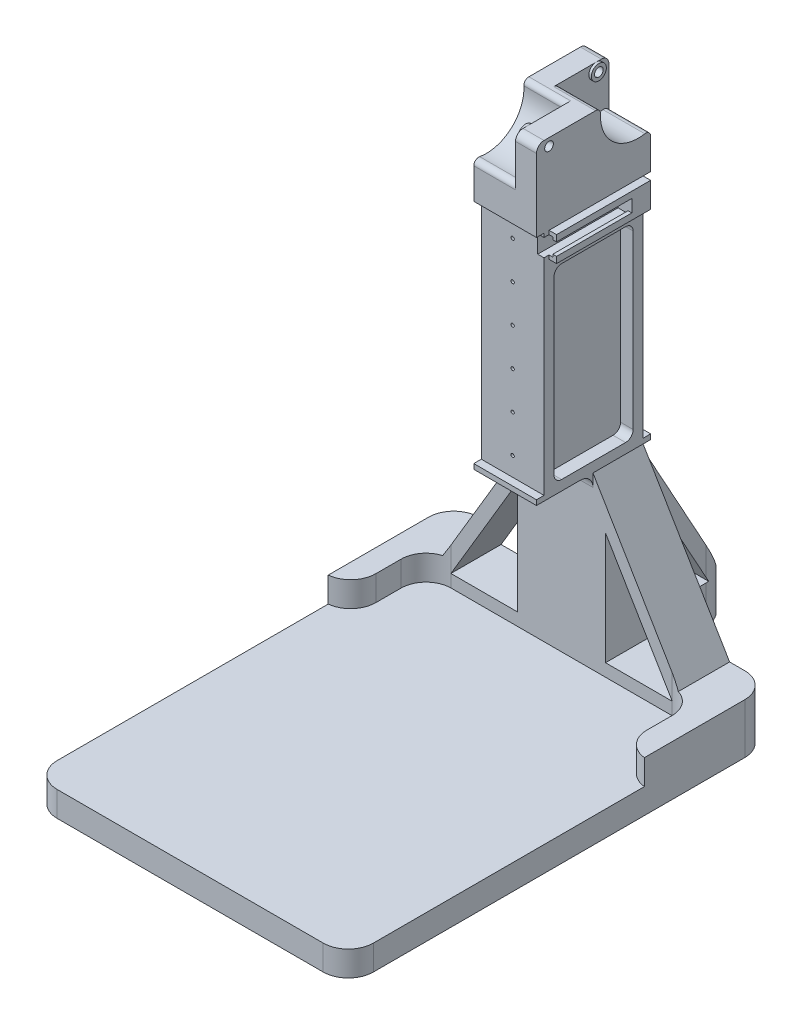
ISO-10303-21;
HEADER;
FILE_DESCRIPTION(('STEP AP214'),'2;1');
FILE_NAME('part.step','',(''),(''),'','','');
FILE_SCHEMA(('AUTOMOTIVE_DESIGN { 1 0 10303 214 1 1 1 1 }'));
ENDSEC;
DATA;
#1=APPLICATION_CONTEXT('core data for automotive mechanical design processes');
#2=APPLICATION_PROTOCOL_DEFINITION('international standard','automotive_design',2000,#1);
#3=PRODUCT_CONTEXT('',#1,'mechanical');
#4=PRODUCT('Part','Part','',(#3));
#5=PRODUCT_RELATED_PRODUCT_CATEGORY('part','',(#4));
#6=PRODUCT_DEFINITION_FORMATION('','',#4);
#7=PRODUCT_DEFINITION_CONTEXT('part definition',#1,'design');
#8=PRODUCT_DEFINITION('design','',#6,#7);
#9=PRODUCT_DEFINITION_SHAPE('','',#8);
#10=(LENGTH_UNIT() NAMED_UNIT(*) SI_UNIT(.MILLI.,.METRE.));
#11=(NAMED_UNIT(*) PLANE_ANGLE_UNIT() SI_UNIT($,.RADIAN.));
#12=(NAMED_UNIT(*) SI_UNIT($,.STERADIAN.) SOLID_ANGLE_UNIT());
#13=UNCERTAINTY_MEASURE_WITH_UNIT(LENGTH_MEASURE(1.E-05),#10,'distance_accuracy_value','');
#14=(GEOMETRIC_REPRESENTATION_CONTEXT(3) GLOBAL_UNCERTAINTY_ASSIGNED_CONTEXT((#13)) GLOBAL_UNIT_ASSIGNED_CONTEXT((#10,
#11,#12)) REPRESENTATION_CONTEXT('',''));
#15=CARTESIAN_POINT('',(0.,0.,0.));
#16=DIRECTION('',(0.,0.,1.));
#17=DIRECTION('',(1.,0.,0.));
#18=AXIS2_PLACEMENT_3D('',#15,#16,#17);
#19=CARTESIAN_POINT('',(-12.5,0.,0.));
#20=DIRECTION('',(1.,0.,0.));
#21=DIRECTION('',(0.,0.,-1.));
#22=AXIS2_PLACEMENT_3D('',#19,#20,#21);
#23=PLANE('',#22);
#24=CARTESIAN_POINT('',(-12.5,189.5,-29.987));
#25=DIRECTION('',(-1.,0.,0.));
#26=DIRECTION('',(0.,0.,1.));
#27=AXIS2_PLACEMENT_3D('',#24,#25,#26);
#28=CIRCLE('',#27,15.);
#29=CARTESIAN_POINT('',(-12.5,190.382352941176,-44.9610259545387));
#30=VERTEX_POINT('',#29);
#31=CARTESIAN_POINT('',(-12.5,174.735411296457,-27.3399411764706));
#32=VERTEX_POINT('',#31);
#33=EDGE_CURVE('E1317',#30,#32,#28,.T.);
#34=ORIENTED_EDGE('',*,*,#33,.F.);
#35=CARTESIAN_POINT('',(-12.5,190.5,-46.9575627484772));
#36=DIRECTION('',(1.,0.,0.));
#37=DIRECTION('',(0.,0.,-1.));
#38=AXIS2_PLACEMENT_3D('',#35,#36,#37);
#39=CIRCLE('',#38,2.);
#40=CARTESIAN_POINT('',(-12.5,192.5,-46.9575627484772));
#41=VERTEX_POINT('',#40);
#42=EDGE_CURVE('E1032',#30,#41,#39,.F.);
#43=ORIENTED_EDGE('',*,*,#42,.T.);
#44=DIRECTION('',(0.,0.,1.));
#45=VECTOR('',#44,1.);
#46=CARTESIAN_POINT('',(-12.5,192.5,-67.49));
#47=LINE('',#46,#45);
#48=CARTESIAN_POINT('',(-12.5,192.5,-67.49));
#49=VERTEX_POINT('',#48);
#50=EDGE_CURVE('E930',#49,#41,#47,.T.);
#51=ORIENTED_EDGE('',*,*,#50,.F.);
#52=CARTESIAN_POINT('',(-12.5,189.5,-67.49));
#53=DIRECTION('',(1.,0.,0.));
#54=DIRECTION('',(0.,0.,-1.));
#55=AXIS2_PLACEMENT_3D('',#52,#53,#54);
#56=CIRCLE('',#55,3.);
#57=CARTESIAN_POINT('',(-12.5,189.5,-70.49));
#58=VERTEX_POINT('',#57);
#59=EDGE_CURVE('E944',#49,#58,#56,.F.);
#60=ORIENTED_EDGE('',*,*,#59,.T.);
#61=DIRECTION('',(0.,1.,0.));
#62=VECTOR('',#61,1.);
#63=CARTESIAN_POINT('',(-12.5,162.5,-70.49));
#64=LINE('',#63,#62);
#65=CARTESIAN_POINT('',(-12.5,160.5,-70.49));
#66=VERTEX_POINT('',#65);
#67=EDGE_CURVE('E1517',#66,#58,#64,.T.);
#68=ORIENTED_EDGE('',*,*,#67,.F.);
#69=DIRECTION('',(0.,0.,1.));
#70=VECTOR('',#69,1.);
#71=CARTESIAN_POINT('',(-12.5,160.5,-70.49));
#72=LINE('',#71,#70);
#73=CARTESIAN_POINT('',(-12.5,160.5,-67.49));
#74=VERTEX_POINT('',#73);
#75=EDGE_CURVE('E1520',#66,#74,#72,.T.);
#76=ORIENTED_EDGE('',*,*,#75,.T.);
#77=DIRECTION('',(0.,1.,0.));
#78=VECTOR('',#77,1.);
#79=CARTESIAN_POINT('',(-12.5,-10.,-67.49));
#80=LINE('',#79,#78);
#81=CARTESIAN_POINT('',(-12.5,70.,-67.49));
#82=VERTEX_POINT('',#81);
#83=EDGE_CURVE('E865',#82,#74,#80,.T.);
#84=ORIENTED_EDGE('',*,*,#83,.F.);
#85=DIRECTION('',(0.,0.,1.));
#86=VECTOR('',#85,1.);
#87=CARTESIAN_POINT('',(-12.5,70.,-70.49));
#88=LINE('',#87,#86);
#89=CARTESIAN_POINT('',(-12.5,70.,-70.49));
#90=VERTEX_POINT('',#89);
#91=EDGE_CURVE('E1503',#90,#82,#88,.T.);
#92=ORIENTED_EDGE('',*,*,#91,.F.);
#93=DIRECTION('',(0.,1.,0.));
#94=VECTOR('',#93,1.);
#95=CARTESIAN_POINT('',(-12.5,70.,-70.49));
#96=LINE('',#95,#94);
#97=CARTESIAN_POINT('',(-12.5,68.,-70.49));
#98=VERTEX_POINT('',#97);
#99=EDGE_CURVE('E1491',#98,#90,#96,.T.);
#100=ORIENTED_EDGE('',*,*,#99,.F.);
#101=DIRECTION('',(0.,0.,1.));
#102=VECTOR('',#101,1.);
#103=CARTESIAN_POINT('',(-12.5,68.,-70.49));
#104=LINE('',#103,#102);
#105=CARTESIAN_POINT('',(-12.5,68.,-67.49));
#106=VERTEX_POINT('',#105);
#107=EDGE_CURVE('E1506',#98,#106,#104,.T.);
#108=ORIENTED_EDGE('',*,*,#107,.T.);
#109=DIRECTION('',(0.,0.,-1.));
#110=VECTOR('',#109,1.);
#111=CARTESIAN_POINT('',(-12.5,68.,-47.49));
#112=LINE('',#111,#110);
#113=CARTESIAN_POINT('',(-12.5,68.,-47.49));
#114=VERTEX_POINT('',#113);
#115=EDGE_CURVE('E1413',#114,#106,#112,.T.);
#116=ORIENTED_EDGE('',*,*,#115,.F.);
#117=DIRECTION('',(0.,-1.,0.));
#118=VECTOR('',#117,1.);
#119=CARTESIAN_POINT('',(-12.5,0.,-47.49));
#120=LINE('',#119,#118);
#121=CARTESIAN_POINT('',(-12.5,63.,-47.49));
#122=VERTEX_POINT('',#121);
#123=EDGE_CURVE('E1411',#114,#122,#120,.T.);
#124=ORIENTED_EDGE('',*,*,#123,.T.);
#125=CARTESIAN_POINT('',(-12.5,63.,-42.49));
#126=DIRECTION('',(1.,0.,0.));
#127=DIRECTION('',(0.,0.,-1.));
#128=AXIS2_PLACEMENT_3D('',#125,#126,#127);
#129=CIRCLE('',#128,5.);
#130=CARTESIAN_POINT('',(-12.5,68.,-42.49));
#131=VERTEX_POINT('',#130);
#132=EDGE_CURVE('E886',#122,#131,#129,.T.);
#133=ORIENTED_EDGE('',*,*,#132,.T.);
#134=DIRECTION('',(0.,0.,-1.));
#135=VECTOR('',#134,1.);
#136=CARTESIAN_POINT('',(-12.5,68.,-47.49));
#137=LINE('',#136,#135);
#138=CARTESIAN_POINT('',(-12.5,68.,-24.987));
#139=VERTEX_POINT('',#138);
#140=EDGE_CURVE('E757',#139,#131,#137,.T.);
#141=ORIENTED_EDGE('',*,*,#140,.F.);
#142=DIRECTION('',(0.,1.,0.));
#143=VECTOR('',#142,1.);
#144=CARTESIAN_POINT('',(-12.5,68.,-24.987));
#145=LINE('',#144,#143);
#146=CARTESIAN_POINT('',(-12.5,70.,-24.987));
#147=VERTEX_POINT('',#146);
#148=EDGE_CURVE('E760',#139,#147,#145,.T.);
#149=ORIENTED_EDGE('',*,*,#148,.T.);
#150=DIRECTION('',(0.,0.,-1.));
#151=VECTOR('',#150,1.);
#152=CARTESIAN_POINT('',(-12.5,70.,-47.49));
#153=LINE('',#152,#151);
#154=CARTESIAN_POINT('',(-12.5,70.,-27.987));
#155=VERTEX_POINT('',#154);
#156=EDGE_CURVE('E755',#147,#155,#153,.T.);
#157=ORIENTED_EDGE('',*,*,#156,.T.);
#158=DIRECTION('',(0.,-1.,0.));
#159=VECTOR('',#158,1.);
#160=CARTESIAN_POINT('',(-12.5,160.5,-27.987));
#161=LINE('',#160,#159);
#162=CARTESIAN_POINT('',(-12.5,160.5,-27.987));
#163=VERTEX_POINT('',#162);
#164=EDGE_CURVE('E870',#163,#155,#161,.T.);
#165=ORIENTED_EDGE('',*,*,#164,.F.);
#166=DIRECTION('',(0.,0.,1.));
#167=VECTOR('',#166,1.);
#168=CARTESIAN_POINT('',(-12.5,160.5,-67.49));
#169=LINE('',#168,#167);
#170=CARTESIAN_POINT('',(-12.5,160.5,-24.987));
#171=VERTEX_POINT('',#170);
#172=EDGE_CURVE('E734',#163,#171,#169,.T.);
#173=ORIENTED_EDGE('',*,*,#172,.T.);
#174=DIRECTION('',(0.,-1.,0.));
#175=VECTOR('',#174,1.);
#176=CARTESIAN_POINT('',(-12.5,162.5,-24.987));
#177=LINE('',#176,#175);
#178=CARTESIAN_POINT('',(-12.5,172.766799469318,-24.987));
#179=VERTEX_POINT('',#178);
#180=EDGE_CURVE('E745',#179,#171,#177,.T.);
#181=ORIENTED_EDGE('',*,*,#180,.F.);
#182=CARTESIAN_POINT('',(-12.5,172.766799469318,-26.987));
#183=DIRECTION('',(1.,0.,0.));
#184=DIRECTION('',(0.,0.,-1.));
#185=AXIS2_PLACEMENT_3D('',#182,#183,#184);
#186=CIRCLE('',#185,2.);
#187=EDGE_CURVE('E1030',#179,#32,#186,.F.);
#188=ORIENTED_EDGE('',*,*,#187,.T.);
#189=EDGE_LOOP('',(#34,#43,#51,#60,#68,#76,#84,#92,#100,#108,#116,#124,#133,#141,#149,#157,#165,
#173,#181,#188));
#190=FACE_BOUND('',#189,.T.);
#191=CARTESIAN_POINT('',(-12.5,189.5,-65.49));
#192=DIRECTION('',(1.,0.,0.));
#193=DIRECTION('',(0.,0.,-1.));
#194=AXIS2_PLACEMENT_3D('',#191,#192,#193);
#195=CIRCLE('',#194,1.72719999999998);
#196=CARTESIAN_POINT('',(-12.5,189.5,-67.2172));
#197=VERTEX_POINT('',#196);
#198=EDGE_CURVE('E1292',#197,#197,#195,.T.);
#199=ORIENTED_EDGE('',*,*,#198,.T.);
#200=EDGE_LOOP('',(#199));
#201=FACE_BOUND('',#200,.T.);
#202=DIRECTION('',(0.,0.,1.));
#203=VECTOR('',#202,1.);
#204=CARTESIAN_POINT('',(-12.5,146.5,-31.987));
#205=LINE('',#204,#203);
#206=CARTESIAN_POINT('',(-12.5,146.5,-60.49));
#207=VERTEX_POINT('',#206);
#208=CARTESIAN_POINT('',(-12.5,146.5,-34.987));
#209=VERTEX_POINT('',#208);
#210=EDGE_CURVE('E1947',#207,#209,#205,.T.);
#211=ORIENTED_EDGE('',*,*,#210,.T.);
#212=CARTESIAN_POINT('',(-12.5,143.5,-34.987));
#213=DIRECTION('',(1.,0.,0.));
#214=DIRECTION('',(0.,0.,-1.));
#215=AXIS2_PLACEMENT_3D('',#212,#213,#214);
#216=CIRCLE('',#215,3.);
#217=CARTESIAN_POINT('',(-12.5,143.5,-31.987));
#218=VERTEX_POINT('',#217);
#219=EDGE_CURVE('E1113',#209,#218,#216,.T.);
#220=ORIENTED_EDGE('',*,*,#219,.T.);
#221=DIRECTION('',(0.,-1.,0.));
#222=VECTOR('',#221,1.);
#223=CARTESIAN_POINT('',(-12.5,146.5,-31.987));
#224=LINE('',#223,#222);
#225=CARTESIAN_POINT('',(-12.5,75.,-31.987));
#226=VERTEX_POINT('',#225);
#227=EDGE_CURVE('E1950',#218,#226,#224,.T.);
#228=ORIENTED_EDGE('',*,*,#227,.T.);
#229=CARTESIAN_POINT('',(-12.5,75.,-34.987));
#230=DIRECTION('',(1.,0.,0.));
#231=DIRECTION('',(0.,0.,-1.));
#232=AXIS2_PLACEMENT_3D('',#229,#230,#231);
#233=CIRCLE('',#232,3.);
#234=CARTESIAN_POINT('',(-12.5,72.,-34.987));
#235=VERTEX_POINT('',#234);
#236=EDGE_CURVE('E1117',#226,#235,#233,.T.);
#237=ORIENTED_EDGE('',*,*,#236,.T.);
#238=DIRECTION('',(0.,0.,-1.));
#239=VECTOR('',#238,1.);
#240=CARTESIAN_POINT('',(-12.5,72.,-31.987));
#241=LINE('',#240,#239);
#242=CARTESIAN_POINT('',(-12.5,72.,-60.49));
#243=VERTEX_POINT('',#242);
#244=EDGE_CURVE('E1940',#235,#243,#241,.T.);
#245=ORIENTED_EDGE('',*,*,#244,.T.);
#246=CARTESIAN_POINT('',(-12.5,75.,-60.49));
#247=DIRECTION('',(1.,0.,0.));
#248=DIRECTION('',(0.,0.,-1.));
#249=AXIS2_PLACEMENT_3D('',#246,#247,#248);
#250=CIRCLE('',#249,3.);
#251=CARTESIAN_POINT('',(-12.5,75.,-63.49));
#252=VERTEX_POINT('',#251);
#253=EDGE_CURVE('E1119',#243,#252,#250,.T.);
#254=ORIENTED_EDGE('',*,*,#253,.T.);
#255=DIRECTION('',(0.,1.,0.));
#256=VECTOR('',#255,1.);
#257=CARTESIAN_POINT('',(-12.5,146.5,-63.49));
#258=LINE('',#257,#256);
#259=CARTESIAN_POINT('',(-12.5,143.5,-63.49));
#260=VERTEX_POINT('',#259);
#261=EDGE_CURVE('E1944',#252,#260,#258,.T.);
#262=ORIENTED_EDGE('',*,*,#261,.T.);
#263=CARTESIAN_POINT('',(-12.5,143.5,-60.49));
#264=DIRECTION('',(1.,0.,0.));
#265=DIRECTION('',(0.,0.,-1.));
#266=AXIS2_PLACEMENT_3D('',#263,#264,#265);
#267=CIRCLE('',#266,3.);
#268=EDGE_CURVE('E1115',#260,#207,#267,.T.);
#269=ORIENTED_EDGE('',*,*,#268,.T.);
#270=EDGE_LOOP('',(#211,#220,#228,#237,#245,#254,#262,#269));
#271=FACE_BOUND('',#270,.T.);
#272=ADVANCED_FACE('F72',(#190,#201,#271),#23,.F.);
#273=CARTESIAN_POINT('',(-4.15,189.5,-65.49));
#274=DIRECTION('',(1.,0.,0.));
#275=DIRECTION('',(0.,0.,-1.));
#276=AXIS2_PLACEMENT_3D('',#273,#274,#275);
#277=PLANE('',#276);
#278=DIRECTION('',(0.,0.,1.));
#279=VECTOR('',#278,1.);
#280=CARTESIAN_POINT('',(-4.15,192.5,0.));
#281=LINE('',#280,#279);
#282=CARTESIAN_POINT('',(-4.15,192.5,-67.49));
#283=VERTEX_POINT('',#282);
#284=CARTESIAN_POINT('',(-4.15,192.5,-65.49));
#285=VERTEX_POINT('',#284);
#286=EDGE_CURVE('E931',#283,#285,#281,.T.);
#287=ORIENTED_EDGE('',*,*,#286,.T.);
#288=CARTESIAN_POINT('',(-4.15,189.5,-65.49));
#289=DIRECTION('',(1.,0.,0.));
#290=DIRECTION('',(0.,0.,-1.));
#291=AXIS2_PLACEMENT_3D('',#288,#289,#290);
#292=CIRCLE('',#291,3.00000000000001);
#293=EDGE_CURVE('E1150',#285,#285,#292,.T.);
#294=ORIENTED_EDGE('',*,*,#293,.F.);
#295=CARTESIAN_POINT('',(-4.15,192.5,-48.5194372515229));
#296=VERTEX_POINT('',#295);
#297=EDGE_CURVE('E925',#285,#296,#281,.T.);
#298=ORIENTED_EDGE('',*,*,#297,.T.);
#299=CARTESIAN_POINT('',(-4.15,190.5,-48.5194372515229));
#300=DIRECTION('',(1.,0.,0.));
#301=DIRECTION('',(0.,0.,-1.));
#302=AXIS2_PLACEMENT_3D('',#299,#300,#301);
#303=CIRCLE('',#302,2.);
#304=CARTESIAN_POINT('',(-4.15,190.382352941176,-50.5159740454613));
#305=VERTEX_POINT('',#304);
#306=EDGE_CURVE('E1053',#296,#305,#303,.F.);
#307=ORIENTED_EDGE('',*,*,#306,.T.);
#308=CARTESIAN_POINT('',(-4.15,189.5,-65.49));
#309=DIRECTION('',(1.,0.,0.));
#310=DIRECTION('',(0.,0.,-1.));
#311=AXIS2_PLACEMENT_3D('',#308,#309,#310);
#312=CIRCLE('',#311,15.);
#313=CARTESIAN_POINT('',(-4.15,174.735411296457,-68.1370588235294));
#314=VERTEX_POINT('',#313);
#315=EDGE_CURVE('E1327',#305,#314,#312,.T.);
#316=ORIENTED_EDGE('',*,*,#315,.T.);
#317=CARTESIAN_POINT('',(-4.15,172.766799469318,-68.49));
#318=DIRECTION('',(1.,0.,0.));
#319=DIRECTION('',(0.,0.,-1.));
#320=AXIS2_PLACEMENT_3D('',#317,#318,#319);
#321=CIRCLE('',#320,2.);
#322=CARTESIAN_POINT('',(-4.15,172.766799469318,-70.49));
#323=VERTEX_POINT('',#322);
#324=EDGE_CURVE('E1055',#314,#323,#321,.F.);
#325=ORIENTED_EDGE('',*,*,#324,.T.);
#326=DIRECTION('',(0.,-1.,0.));
#327=VECTOR('',#326,1.);
#328=CARTESIAN_POINT('',(-4.15,0.,-70.49));
#329=LINE('',#328,#327);
#330=CARTESIAN_POINT('',(-4.15,189.5,-70.49));
#331=VERTEX_POINT('',#330);
#332=EDGE_CURVE('E1330',#331,#323,#329,.T.);
#333=ORIENTED_EDGE('',*,*,#332,.F.);
#334=CARTESIAN_POINT('',(-4.15,189.5,-67.49));
#335=DIRECTION('',(1.,0.,0.));
#336=DIRECTION('',(0.,0.,-1.));
#337=AXIS2_PLACEMENT_3D('',#334,#335,#336);
#338=CIRCLE('',#337,3.);
#339=EDGE_CURVE('E948',#331,#283,#338,.T.);
#340=ORIENTED_EDGE('',*,*,#339,.T.);
#341=EDGE_LOOP('',(#287,#294,#298,#307,#316,#325,#333,#340));
#342=FACE_BOUND('',#341,.T.);
#343=ADVANCED_FACE('F1840',(#342),#277,.T.);
#344=CARTESIAN_POINT('',(4.15,189.5,-29.987));
#345=DIRECTION('',(-1.,0.,0.));
#346=DIRECTION('',(0.,0.,1.));
#347=AXIS2_PLACEMENT_3D('',#344,#345,#346);
#348=PLANE('',#347);
#349=DIRECTION('',(0.,0.,-1.));
#350=VECTOR('',#349,1.);
#351=CARTESIAN_POINT('',(4.15,192.5,0.));
#352=LINE('',#351,#350);
#353=CARTESIAN_POINT('',(4.15,192.5,-27.987));
#354=VERTEX_POINT('',#353);
#355=CARTESIAN_POINT('',(4.15,192.5,-29.987));
#356=VERTEX_POINT('',#355);
#357=EDGE_CURVE('E935',#354,#356,#352,.T.);
#358=ORIENTED_EDGE('',*,*,#357,.T.);
#359=CARTESIAN_POINT('',(4.15,189.5,-29.987));
#360=DIRECTION('',(-1.,0.,0.));
#361=DIRECTION('',(0.,0.,1.));
#362=AXIS2_PLACEMENT_3D('',#359,#360,#361);
#363=CIRCLE('',#362,3.);
#364=EDGE_CURVE('E1174',#356,#356,#363,.T.);
#365=ORIENTED_EDGE('',*,*,#364,.F.);
#366=CARTESIAN_POINT('',(4.15,192.5,-46.9575627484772));
#367=VERTEX_POINT('',#366);
#368=EDGE_CURVE('E934',#356,#367,#352,.T.);
#369=ORIENTED_EDGE('',*,*,#368,.T.);
#370=CARTESIAN_POINT('',(4.15,190.5,-46.9575627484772));
#371=DIRECTION('',(-1.,0.,0.));
#372=DIRECTION('',(0.,0.,1.));
#373=AXIS2_PLACEMENT_3D('',#370,#371,#372);
#374=CIRCLE('',#373,2.);
#375=CARTESIAN_POINT('',(4.15,190.382352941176,-44.9610259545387));
#376=VERTEX_POINT('',#375);
#377=EDGE_CURVE('E1048',#367,#376,#374,.F.);
#378=ORIENTED_EDGE('',*,*,#377,.T.);
#379=CARTESIAN_POINT('',(4.15,189.5,-29.987));
#380=DIRECTION('',(-1.,0.,0.));
#381=DIRECTION('',(0.,0.,1.));
#382=AXIS2_PLACEMENT_3D('',#379,#380,#381);
#383=CIRCLE('',#382,15.);
#384=CARTESIAN_POINT('',(4.15,174.735411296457,-27.3399411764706));
#385=VERTEX_POINT('',#384);
#386=EDGE_CURVE('E1318',#376,#385,#383,.T.);
#387=ORIENTED_EDGE('',*,*,#386,.T.);
#388=CARTESIAN_POINT('',(4.15,172.766799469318,-26.987));
#389=DIRECTION('',(-1.,0.,0.));
#390=DIRECTION('',(0.,0.,1.));
#391=AXIS2_PLACEMENT_3D('',#388,#389,#390);
#392=CIRCLE('',#391,2.);
#393=CARTESIAN_POINT('',(4.15,172.766799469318,-24.987));
#394=VERTEX_POINT('',#393);
#395=EDGE_CURVE('E1050',#385,#394,#392,.F.);
#396=ORIENTED_EDGE('',*,*,#395,.T.);
#397=DIRECTION('',(0.,1.,0.));
#398=VECTOR('',#397,1.);
#399=CARTESIAN_POINT('',(4.15,162.5,-24.987));
#400=LINE('',#399,#398);
#401=CARTESIAN_POINT('',(4.15,189.5,-24.987));
#402=VERTEX_POINT('',#401);
#403=EDGE_CURVE('E1321',#394,#402,#400,.T.);
#404=ORIENTED_EDGE('',*,*,#403,.T.);
#405=CARTESIAN_POINT('',(4.15,189.5,-27.987));
#406=DIRECTION('',(-1.,0.,0.));
#407=DIRECTION('',(0.,0.,1.));
#408=AXIS2_PLACEMENT_3D('',#405,#406,#407);
#409=CIRCLE('',#408,3.);
#410=EDGE_CURVE('E954',#402,#354,#409,.T.);
#411=ORIENTED_EDGE('',*,*,#410,.T.);
#412=EDGE_LOOP('',(#358,#365,#369,#378,#387,#396,#404,#411));
#413=FACE_BOUND('',#412,.T.);
#414=ADVANCED_FACE('F1845',(#413),#348,.T.);
#415=CARTESIAN_POINT('',(12.5,0.,-47.49));
#416=DIRECTION('',(0.,-1.,0.));
#417=DIRECTION('',(0.,0.,-1.));
#418=AXIS2_PLACEMENT_3D('',#415,#416,#417);
#419=PLANE('',#418);
#420=CARTESIAN_POINT('',(53.,0.,-57.4904896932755));
#421=DIRECTION('',(0.,1.,0.));
#422=DIRECTION('',(0.,0.,1.));
#423=AXIS2_PLACEMENT_3D('',#420,#421,#422);
#424=CIRCLE('',#423,10.0000038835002);
#425=CARTESIAN_POINT('',(52.9999999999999,0.,-67.4904896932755));
#426=VERTEX_POINT('',#425);
#427=CARTESIAN_POINT('',(52.9002554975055,0.,-67.49));
#428=VERTEX_POINT('',#427);
#429=EDGE_CURVE('E1207',#426,#428,#424,.T.);
#430=ORIENTED_EDGE('',*,*,#429,.F.);
#431=DIRECTION('',(-1.,0.,0.));
#432=VECTOR('',#431,1.);
#433=CARTESIAN_POINT('',(-52.9999999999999,0.,-67.4904896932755));
#434=LINE('',#433,#432);
#435=CARTESIAN_POINT('',(9.99999999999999,0.,-67.4904896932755));
#436=VERTEX_POINT('',#435);
#437=EDGE_CURVE('E802',#426,#436,#434,.T.);
#438=ORIENTED_EDGE('',*,*,#437,.T.);
#439=DIRECTION('',(0.,0.,1.));
#440=VECTOR('',#439,1.);
#441=CARTESIAN_POINT('',(9.99999999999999,0.,-110.49));
#442=LINE('',#441,#440);
#443=CARTESIAN_POINT('',(9.99999999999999,0.,-67.49));
#444=VERTEX_POINT('',#443);
#445=EDGE_CURVE('E1382',#436,#444,#442,.T.);
#446=ORIENTED_EDGE('',*,*,#445,.T.);
#447=DIRECTION('',(-1.,0.,0.));
#448=VECTOR('',#447,1.);
#449=CARTESIAN_POINT('',(12.5,0.,-67.49));
#450=LINE('',#449,#448);
#451=EDGE_CURVE('E827',#428,#444,#450,.T.);
#452=ORIENTED_EDGE('',*,*,#451,.F.);
#453=EDGE_LOOP('',(#430,#438,#446,#452));
#454=FACE_BOUND('',#453,.T.);
#455=ADVANCED_FACE('F1696',(#454),#419,.F.);
#456=DIRECTION('',(0.,0.,1.));
#457=VECTOR('',#456,1.);
#458=CARTESIAN_POINT('',(54.,0.,-17.49));
#459=LINE('',#458,#457);
#460=CARTESIAN_POINT('',(54.,0.,-37.49));
#461=VERTEX_POINT('',#460);
#462=CARTESIAN_POINT('',(54.,0.,-27.4398743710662));
#463=VERTEX_POINT('',#462);
#464=EDGE_CURVE('E1212',#461,#463,#459,.T.);
#465=ORIENTED_EDGE('',*,*,#464,.F.);
#466=CARTESIAN_POINT('',(44.,0.,-37.49));
#467=DIRECTION('',(0.,-1.,0.));
#468=DIRECTION('',(0.,0.,-1.));
#469=AXIS2_PLACEMENT_3D('',#466,#467,#468);
#470=CIRCLE('',#469,10.);
#471=CARTESIAN_POINT('',(44.,0.,-47.49));
#472=VERTEX_POINT('',#471);
#473=EDGE_CURVE('E972',#461,#472,#470,.F.);
#474=ORIENTED_EDGE('',*,*,#473,.T.);
#475=DIRECTION('',(-1.,0.,0.));
#476=VECTOR('',#475,1.);
#477=CARTESIAN_POINT('',(12.5,0.,-47.49));
#478=LINE('',#477,#476);
#479=CARTESIAN_POINT('',(-44.,0.,-47.49));
#480=VERTEX_POINT('',#479);
#481=EDGE_CURVE('E872',#472,#480,#478,.T.);
#482=ORIENTED_EDGE('',*,*,#481,.T.);
#483=CARTESIAN_POINT('',(-44.,0.,-37.49));
#484=DIRECTION('',(0.,-1.,0.));
#485=DIRECTION('',(0.,0.,-1.));
#486=AXIS2_PLACEMENT_3D('',#483,#484,#485);
#487=CIRCLE('',#486,10.);
#488=CARTESIAN_POINT('',(-54.,0.,-37.49));
#489=VERTEX_POINT('',#488);
#490=EDGE_CURVE('E970',#480,#489,#487,.F.);
#491=ORIENTED_EDGE('',*,*,#490,.T.);
#492=DIRECTION('',(0.,0.,-1.));
#493=VECTOR('',#492,1.);
#494=CARTESIAN_POINT('',(-54.,0.,-47.49));
#495=LINE('',#494,#493);
#496=CARTESIAN_POINT('',(-54.,0.,-27.4398743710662));
#497=VERTEX_POINT('',#496);
#498=EDGE_CURVE('E1241',#497,#489,#495,.T.);
#499=ORIENTED_EDGE('',*,*,#498,.F.);
#500=CARTESIAN_POINT('',(-64.,0.,-27.4398743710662));
#501=DIRECTION('',(0.,-1.,0.));
#502=DIRECTION('',(0.,0.,-1.));
#503=AXIS2_PLACEMENT_3D('',#500,#501,#502);
#504=CIRCLE('',#503,10.);
#505=CARTESIAN_POINT('',(-63.,0.,-17.49));
#506=VERTEX_POINT('',#505);
#507=EDGE_CURVE('E1003',#497,#506,#504,.T.);
#508=ORIENTED_EDGE('',*,*,#507,.T.);
#509=DIRECTION('',(0.,0.,1.));
#510=VECTOR('',#509,1.);
#511=CARTESIAN_POINT('',(-63.,0.,-57.4904896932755));
#512=LINE('',#511,#510);
#513=CARTESIAN_POINT('',(-63.,0.,90.5095103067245));
#514=VERTEX_POINT('',#513);
#515=EDGE_CURVE('E805',#506,#514,#512,.T.);
#516=ORIENTED_EDGE('',*,*,#515,.T.);
#517=CARTESIAN_POINT('',(-53.,0.,90.5095103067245));
#518=DIRECTION('',(0.,1.,0.));
#519=DIRECTION('',(0.,0.,1.));
#520=AXIS2_PLACEMENT_3D('',#517,#518,#519);
#521=CIRCLE('',#520,10.);
#522=CARTESIAN_POINT('',(-53.,0.,100.509510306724));
#523=VERTEX_POINT('',#522);
#524=EDGE_CURVE('E771',#514,#523,#521,.T.);
#525=ORIENTED_EDGE('',*,*,#524,.T.);
#526=DIRECTION('',(1.,0.,0.));
#527=VECTOR('',#526,1.);
#528=CARTESIAN_POINT('',(-53.,0.,100.509510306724));
#529=LINE('',#528,#527);
#530=CARTESIAN_POINT('',(53.,0.,100.509510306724));
#531=VERTEX_POINT('',#530);
#532=EDGE_CURVE('E792',#523,#531,#529,.T.);
#533=ORIENTED_EDGE('',*,*,#532,.T.);
#534=CARTESIAN_POINT('',(53.,0.,90.5095103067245));
#535=DIRECTION('',(0.,1.,0.));
#536=DIRECTION('',(0.,0.,1.));
#537=AXIS2_PLACEMENT_3D('',#534,#535,#536);
#538=CIRCLE('',#537,9.99999999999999);
#539=CARTESIAN_POINT('',(63.,0.,90.5095103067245));
#540=VERTEX_POINT('',#539);
#541=EDGE_CURVE('E795',#531,#540,#538,.T.);
#542=ORIENTED_EDGE('',*,*,#541,.T.);
#543=DIRECTION('',(0.,0.,-1.));
#544=VECTOR('',#543,1.);
#545=CARTESIAN_POINT('',(63.,0.,-57.4904896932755));
#546=LINE('',#545,#544);
#547=CARTESIAN_POINT('',(63.,0.,-17.49));
#548=VERTEX_POINT('',#547);
#549=EDGE_CURVE('E798',#540,#548,#546,.T.);
#550=ORIENTED_EDGE('',*,*,#549,.T.);
#551=CARTESIAN_POINT('',(64.,0.,-27.4398743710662));
#552=DIRECTION('',(0.,-1.,0.));
#553=DIRECTION('',(0.,0.,-1.));
#554=AXIS2_PLACEMENT_3D('',#551,#552,#553);
#555=CIRCLE('',#554,10.);
#556=EDGE_CURVE('E990',#548,#463,#555,.T.);
#557=ORIENTED_EDGE('',*,*,#556,.T.);
#558=EDGE_LOOP('',(#465,#474,#482,#491,#499,#508,#516,#525,#533,#542,#550,#557));
#559=FACE_BOUND('',#558,.T.);
#560=ADVANCED_FACE('F1781',(#559),#419,.F.);
#561=CARTESIAN_POINT('',(0.,5.,-47.49));
#562=DIRECTION('',(0.,-1.,0.));
#563=DIRECTION('',(1.,0.,0.));
#564=AXIS2_PLACEMENT_3D('',#561,#562,#563);
#565=PLANE('',#564);
#566=DIRECTION('',(0.,0.,1.));
#567=VECTOR('',#566,1.);
#568=CARTESIAN_POINT('',(44.0030196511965,5.,-47.49));
#569=LINE('',#568,#567);
#570=CARTESIAN_POINT('',(44.0030196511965,5.,-67.49));
#571=VERTEX_POINT('',#570);
#572=CARTESIAN_POINT('',(44.0030196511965,5.,-47.4899995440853));
#573=VERTEX_POINT('',#572);
#574=EDGE_CURVE('E1233',#571,#573,#569,.T.);
#575=ORIENTED_EDGE('',*,*,#574,.F.);
#576=DIRECTION('',(-1.,0.,0.));
#577=VECTOR('',#576,1.);
#578=CARTESIAN_POINT('',(0.,5.,-67.49));
#579=LINE('',#578,#577);
#580=CARTESIAN_POINT('',(17.5,5.,-67.49));
#581=VERTEX_POINT('',#580);
#582=EDGE_CURVE('E1422',#571,#581,#579,.T.);
#583=ORIENTED_EDGE('',*,*,#582,.T.);
#584=DIRECTION('',(0.,0.,-1.));
#585=VECTOR('',#584,1.);
#586=CARTESIAN_POINT('',(17.5,5.,-47.49));
#587=LINE('',#586,#585);
#588=CARTESIAN_POINT('',(17.5,5.,-47.49));
#589=VERTEX_POINT('',#588);
#590=EDGE_CURVE('E1433',#589,#581,#587,.T.);
#591=ORIENTED_EDGE('',*,*,#590,.F.);
#592=DIRECTION('',(-1.,0.,0.));
#593=VECTOR('',#592,1.);
#594=CARTESIAN_POINT('',(0.,5.,-47.49));
#595=LINE('',#594,#593);
#596=CARTESIAN_POINT('',(44.,5.,-47.49));
#597=VERTEX_POINT('',#596);
#598=EDGE_CURVE('E1425',#597,#589,#595,.T.);
#599=ORIENTED_EDGE('',*,*,#598,.F.);
#600=CARTESIAN_POINT('',(44.,5.,-37.49));
#601=DIRECTION('',(0.,-1.,0.));
#602=DIRECTION('',(1.,0.,0.));
#603=AXIS2_PLACEMENT_3D('',#600,#601,#602);
#604=CIRCLE('',#603,10.);
#605=EDGE_CURVE('E992',#597,#573,#604,.T.);
#606=ORIENTED_EDGE('',*,*,#605,.T.);
#607=EDGE_LOOP('',(#575,#583,#591,#599,#606));
#608=FACE_BOUND('',#607,.T.);
#609=ADVANCED_FACE('F2114',(#608),#565,.F.);
#610=CARTESIAN_POINT('',(34.800487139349,20.675714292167,-47.49));
#611=DIRECTION('',(0.859714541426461,0.510774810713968,0.));
#612=DIRECTION('',(-0.510774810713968,0.859714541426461,0.));
#613=AXIS2_PLACEMENT_3D('',#610,#611,#612);
#614=PLANE('',#613);
#615=DIRECTION('',(0.,0.,-1.));
#616=VECTOR('',#615,1.);
#617=CARTESIAN_POINT('',(44.0030196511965,5.18640109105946,-47.49));
#618=LINE('',#617,#616);
#619=CARTESIAN_POINT('',(44.0030196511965,5.18640109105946,-47.4899995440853));
#620=VERTEX_POINT('',#619);
#621=CARTESIAN_POINT('',(44.0030196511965,5.18640109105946,-67.49));
#622=VERTEX_POINT('',#621);
#623=EDGE_CURVE('E959',#620,#622,#618,.T.);
#624=ORIENTED_EDGE('',*,*,#623,.F.);
#625=CARTESIAN_POINT('',(44.,5.19148364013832,-37.49));
#626=DIRECTION('',(0.859714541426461,0.510774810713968,0.));
#627=DIRECTION('',(-0.510774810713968,0.859714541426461,0.));
#628=AXIS2_PLACEMENT_3D('',#625,#626,#627);
#629=ELLIPSE('',#628,19.5780993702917,10.);
#630=CARTESIAN_POINT('',(44.,5.19148364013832,-47.49));
#631=VERTEX_POINT('',#630);
#632=EDGE_CURVE('E996',#620,#631,#629,.T.);
#633=ORIENTED_EDGE('',*,*,#632,.T.);
#634=DIRECTION('',(0.510774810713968,-0.859714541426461,0.));
#635=VECTOR('',#634,1.);
#636=CARTESIAN_POINT('',(34.800487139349,20.675714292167,-47.49));
#637=LINE('',#636,#635);
#638=CARTESIAN_POINT('',(17.5,49.7951619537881,-47.49));
#639=VERTEX_POINT('',#638);
#640=EDGE_CURVE('E1421',#639,#631,#637,.T.);
#641=ORIENTED_EDGE('',*,*,#640,.F.);
#642=DIRECTION('',(0.,0.,-1.));
#643=VECTOR('',#642,1.);
#644=CARTESIAN_POINT('',(17.5,49.7951619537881,-47.49));
#645=LINE('',#644,#643);
#646=CARTESIAN_POINT('',(17.5,49.7951619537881,-67.49));
#647=VERTEX_POINT('',#646);
#648=EDGE_CURVE('E1427',#639,#647,#645,.T.);
#649=ORIENTED_EDGE('',*,*,#648,.T.);
#650=DIRECTION('',(0.510774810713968,-0.859714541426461,0.));
#651=VECTOR('',#650,1.);
#652=CARTESIAN_POINT('',(34.800487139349,20.675714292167,-67.49));
#653=LINE('',#652,#651);
#654=EDGE_CURVE('E1429',#647,#622,#653,.T.);
#655=ORIENTED_EDGE('',*,*,#654,.T.);
#656=EDGE_LOOP('',(#624,#633,#641,#649,#655));
#657=FACE_BOUND('',#656,.T.);
#658=ADVANCED_FACE('F1853',(#657),#614,.F.);
#659=CARTESIAN_POINT('',(-53.,0.,-57.4904896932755));
#660=DIRECTION('',(0.,1.,0.));
#661=DIRECTION('',(0.,0.,1.));
#662=AXIS2_PLACEMENT_3D('',#659,#660,#661);
#663=CIRCLE('',#662,10.0000038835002);
#664=CARTESIAN_POINT('',(-52.9002554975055,0.,-67.49));
#665=VERTEX_POINT('',#664);
#666=CARTESIAN_POINT('',(-52.9999999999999,0.,-67.4904896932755));
#667=VERTEX_POINT('',#666);
#668=EDGE_CURVE('E1236',#665,#667,#663,.T.);
#669=ORIENTED_EDGE('',*,*,#668,.F.);
#670=CARTESIAN_POINT('',(-10.,0.,-67.49));
#671=VERTEX_POINT('',#670);
#672=EDGE_CURVE('E826',#671,#665,#450,.T.);
#673=ORIENTED_EDGE('',*,*,#672,.F.);
#674=DIRECTION('',(0.,0.,1.));
#675=VECTOR('',#674,1.);
#676=CARTESIAN_POINT('',(-10.,0.,-110.49));
#677=LINE('',#676,#675);
#678=CARTESIAN_POINT('',(-10.,0.,-67.4904896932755));
#679=VERTEX_POINT('',#678);
#680=EDGE_CURVE('E1380',#679,#671,#677,.T.);
#681=ORIENTED_EDGE('',*,*,#680,.F.);
#682=EDGE_CURVE('E801',#679,#667,#434,.T.);
#683=ORIENTED_EDGE('',*,*,#682,.T.);
#684=EDGE_LOOP('',(#669,#673,#681,#683));
#685=FACE_BOUND('',#684,.T.);
#686=ADVANCED_FACE('F1749',(#685),#419,.F.);
#687=CARTESIAN_POINT('',(-33.,0.,-98.8967743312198));
#688=DIRECTION('',(0.,0.482780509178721,-0.875741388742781));
#689=DIRECTION('',(0.,0.875741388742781,0.482780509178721));
#690=AXIS2_PLACEMENT_3D('',#687,#688,#689);
#691=PLANE('',#690);
#692=DIRECTION('',(1.,0.,0.));
#693=VECTOR('',#692,1.);
#694=CARTESIAN_POINT('',(9.99999999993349,5.,-96.1403640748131));
#695=LINE('',#694,#693);
#696=CARTESIAN_POINT('',(-9.93366945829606,5.,-96.1403640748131));
#697=VERTEX_POINT('',#696);
#698=CARTESIAN_POINT('',(9.93366945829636,5.,-96.1403640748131));
#699=VERTEX_POINT('',#698);
#700=EDGE_CURVE('E929',#697,#699,#695,.T.);
#701=ORIENTED_EDGE('',*,*,#700,.T.);
#702=CARTESIAN_POINT('',(0.,7.08581864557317,-94.9904896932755));
#703=DIRECTION('',(0.,0.482780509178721,-0.875741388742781));
#704=DIRECTION('',(0.,0.875741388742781,0.482780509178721));
#705=AXIS2_PLACEMENT_3D('',#702,#703,#704);
#706=ELLIPSE('',#705,20.7133465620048,10.);
#707=CARTESIAN_POINT('',(9.99999999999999,7.08581864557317,-94.9904896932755));
#708=VERTEX_POINT('',#707);
#709=EDGE_CURVE('E911',#699,#708,#706,.F.);
#710=ORIENTED_EDGE('',*,*,#709,.T.);
#711=DIRECTION('',(0.,0.875741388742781,0.482780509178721));
#712=VECTOR('',#711,1.);
#713=CARTESIAN_POINT('',(9.99999999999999,0.,-98.8967743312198));
#714=LINE('',#713,#712);
#715=CARTESIAN_POINT('',(10.,47.90066041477,-72.49));
#716=VERTEX_POINT('',#715);
#717=EDGE_CURVE('E1358',#708,#716,#714,.T.);
#718=ORIENTED_EDGE('',*,*,#717,.T.);
#719=DIRECTION('',(1.,0.,0.));
#720=VECTOR('',#719,1.);
#721=CARTESIAN_POINT('',(-33.,47.90066041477,-72.49));
#722=LINE('',#721,#720);
#723=CARTESIAN_POINT('',(-10.,47.90066041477,-72.49));
#724=VERTEX_POINT('',#723);
#725=EDGE_CURVE('E1363',#724,#716,#722,.T.);
#726=ORIENTED_EDGE('',*,*,#725,.F.);
#727=DIRECTION('',(0.,0.875741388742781,0.482780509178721));
#728=VECTOR('',#727,1.);
#729=CARTESIAN_POINT('',(-10.,47.2492526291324,-72.8491094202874));
#730=LINE('',#729,#728);
#731=CARTESIAN_POINT('',(-10.,7.08581864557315,-94.9904896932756));
#732=VERTEX_POINT('',#731);
#733=EDGE_CURVE('E894',#732,#724,#730,.T.);
#734=ORIENTED_EDGE('',*,*,#733,.F.);
#735=CARTESIAN_POINT('',(0.,7.08581864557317,-94.9904896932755));
#736=DIRECTION('',(0.,0.482780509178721,-0.875741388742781));
#737=DIRECTION('',(0.,-0.875741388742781,-0.482780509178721));
#738=AXIS2_PLACEMENT_3D('',#735,#736,#737);
#739=ELLIPSE('',#738,20.7133465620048,10.);
#740=EDGE_CURVE('E909',#732,#697,#739,.F.);
#741=ORIENTED_EDGE('',*,*,#740,.T.);
#742=EDGE_LOOP('',(#701,#710,#718,#726,#734,#741));
#743=FACE_BOUND('',#742,.T.);
#744=ADVANCED_FACE('F1715',(#743),#691,.F.);
#745=CARTESIAN_POINT('',(-33.,47.90066041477,-72.49));
#746=DIRECTION('',(0.,0.,1.));
#747=DIRECTION('',(1.,0.,0.));
#748=AXIS2_PLACEMENT_3D('',#745,#746,#747);
#749=PLANE('',#748);
#750=DIRECTION('',(1.,0.,0.));
#751=VECTOR('',#750,1.);
#752=CARTESIAN_POINT('',(9.99999999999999,5.,-72.49));
#753=LINE('',#752,#751);
#754=CARTESIAN_POINT('',(-10.,5.,-72.49));
#755=VERTEX_POINT('',#754);
#756=CARTESIAN_POINT('',(9.99999999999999,5.00000000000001,-72.49));
#757=VERTEX_POINT('',#756);
#758=EDGE_CURVE('E1339',#755,#757,#753,.T.);
#759=ORIENTED_EDGE('',*,*,#758,.F.);
#760=DIRECTION('',(0.,-1.,0.));
#761=VECTOR('',#760,1.);
#762=CARTESIAN_POINT('',(-10.,68.,-72.49));
#763=LINE('',#762,#761);
#764=EDGE_CURVE('E891',#724,#755,#763,.T.);
#765=ORIENTED_EDGE('',*,*,#764,.F.);
#766=ORIENTED_EDGE('',*,*,#725,.T.);
#767=DIRECTION('',(0.,-1.,0.));
#768=VECTOR('',#767,1.);
#769=CARTESIAN_POINT('',(10.,47.90066041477,-72.49));
#770=LINE('',#769,#768);
#771=EDGE_CURVE('E1360',#716,#757,#770,.T.);
#772=ORIENTED_EDGE('',*,*,#771,.T.);
#773=EDGE_LOOP('',(#759,#765,#766,#772));
#774=FACE_BOUND('',#773,.T.);
#775=ADVANCED_FACE('F1733',(#774),#749,.F.);
#776=CARTESIAN_POINT('',(-52.9999999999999,-220.,-67.4904896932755));
#777=DIRECTION('',(0.,0.,-1.));
#778=DIRECTION('',(-1.,0.,0.));
#779=AXIS2_PLACEMENT_3D('',#776,#777,#778);
#780=PLANE('',#779);
#781=DIRECTION('',(1.,0.,0.));
#782=VECTOR('',#781,1.);
#783=CARTESIAN_POINT('',(-52.9999999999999,-10.,-67.4904896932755));
#784=LINE('',#783,#782);
#785=CARTESIAN_POINT('',(9.99999999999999,-10.,-67.4904896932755));
#786=VERTEX_POINT('',#785);
#787=CARTESIAN_POINT('',(52.9999999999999,-10.,-67.4904896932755));
#788=VERTEX_POINT('',#787);
#789=EDGE_CURVE('E779',#786,#788,#784,.T.);
#790=ORIENTED_EDGE('',*,*,#789,.F.);
#791=DIRECTION('',(0.,-1.,0.));
#792=VECTOR('',#791,1.);
#793=CARTESIAN_POINT('',(9.99999999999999,0.,-67.4904896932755));
#794=LINE('',#793,#792);
#795=EDGE_CURVE('E1342',#436,#786,#794,.T.);
#796=ORIENTED_EDGE('',*,*,#795,.F.);
#797=ORIENTED_EDGE('',*,*,#437,.F.);
#798=DIRECTION('',(0.,1.,0.));
#799=VECTOR('',#798,1.);
#800=CARTESIAN_POINT('',(52.9999999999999,-220.,-67.4904896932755));
#801=LINE('',#800,#799);
#802=EDGE_CURVE('E815',#788,#426,#801,.T.);
#803=ORIENTED_EDGE('',*,*,#802,.F.);
#804=EDGE_LOOP('',(#790,#796,#797,#803));
#805=FACE_BOUND('',#804,.T.);
#806=ADVANCED_FACE('F1701',(#805),#780,.T.);
#807=ORIENTED_EDGE('',*,*,#682,.F.);
#808=DIRECTION('',(0.,1.,0.));
#809=VECTOR('',#808,1.);
#810=CARTESIAN_POINT('',(-10.,0.,-67.4904896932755));
#811=LINE('',#810,#809);
#812=CARTESIAN_POINT('',(-10.,-10.,-67.4904896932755));
#813=VERTEX_POINT('',#812);
#814=EDGE_CURVE('E1351',#813,#679,#811,.T.);
#815=ORIENTED_EDGE('',*,*,#814,.F.);
#816=CARTESIAN_POINT('',(-52.9999999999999,-10.,-67.4904896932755));
#817=VERTEX_POINT('',#816);
#818=EDGE_CURVE('E780',#817,#813,#784,.T.);
#819=ORIENTED_EDGE('',*,*,#818,.F.);
#820=DIRECTION('',(0.,1.,0.));
#821=VECTOR('',#820,1.);
#822=CARTESIAN_POINT('',(-52.9999999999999,-220.,-67.4904896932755));
#823=LINE('',#822,#821);
#824=EDGE_CURVE('E812',#817,#667,#823,.T.);
#825=ORIENTED_EDGE('',*,*,#824,.T.);
#826=EDGE_LOOP('',(#807,#815,#819,#825));
#827=FACE_BOUND('',#826,.T.);
#828=ADVANCED_FACE('F1827',(#827),#780,.T.);
#829=CARTESIAN_POINT('',(12.5,-10.,-67.49));
#830=DIRECTION('',(0.,0.,1.));
#831=DIRECTION('',(1.,0.,0.));
#832=AXIS2_PLACEMENT_3D('',#829,#830,#831);
#833=PLANE('',#832);
#834=ORIENTED_EDGE('',*,*,#582,.F.);
#835=DIRECTION('',(0.,-1.,0.));
#836=VECTOR('',#835,1.);
#837=CARTESIAN_POINT('',(44.0030196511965,10.,-67.49));
#838=LINE('',#837,#836);
#839=EDGE_CURVE('E1228',#622,#571,#838,.T.);
#840=ORIENTED_EDGE('',*,*,#839,.F.);
#841=ORIENTED_EDGE('',*,*,#654,.F.);
#842=DIRECTION('',(0.,1.,0.));
#843=VECTOR('',#842,1.);
#844=CARTESIAN_POINT('',(17.5,0.,-67.49));
#845=LINE('',#844,#843);
#846=EDGE_CURVE('E1417',#581,#647,#845,.T.);
#847=ORIENTED_EDGE('',*,*,#846,.F.);
#848=EDGE_LOOP('',(#834,#840,#841,#847));
#849=FACE_BOUND('',#848,.T.);
#850=ORIENTED_EDGE('',*,*,#451,.T.);
#851=DIRECTION('',(0.,-1.,0.));
#852=VECTOR('',#851,1.);
#853=CARTESIAN_POINT('',(10.,68.,-67.49));
#854=LINE('',#853,#852);
#855=CARTESIAN_POINT('',(10.,68.,-67.49));
#856=VERTEX_POINT('',#855);
#857=EDGE_CURVE('E1373',#856,#444,#854,.T.);
#858=ORIENTED_EDGE('',*,*,#857,.F.);
#859=DIRECTION('',(-1.,0.,0.));
#860=VECTOR('',#859,1.);
#861=CARTESIAN_POINT('',(12.5,68.,-67.49));
#862=LINE('',#861,#860);
#863=CARTESIAN_POINT('',(12.5,68.,-67.49));
#864=VERTEX_POINT('',#863);
#865=EDGE_CURVE('E1496',#864,#856,#862,.T.);
#866=ORIENTED_EDGE('',*,*,#865,.F.);
#867=DIRECTION('',(0.510774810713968,-0.859714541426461,0.));
#868=VECTOR('',#867,1.);
#869=CARTESIAN_POINT('',(12.5,68.,-67.49));
#870=LINE('',#869,#868);
#871=CARTESIAN_POINT('',(46.9590414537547,10.,-67.49));
#872=VERTEX_POINT('',#871);
#873=EDGE_CURVE('E1436',#864,#872,#870,.T.);
#874=ORIENTED_EDGE('',*,*,#873,.T.);
#875=DIRECTION('',(-1.,0.,0.));
#876=VECTOR('',#875,1.);
#877=CARTESIAN_POINT('',(52.9002554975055,10.,-67.49));
#878=LINE('',#877,#876);
#879=CARTESIAN_POINT('',(52.9002554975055,10.,-67.49));
#880=VERTEX_POINT('',#879);
#881=EDGE_CURVE('E1211',#880,#872,#878,.T.);
#882=ORIENTED_EDGE('',*,*,#881,.F.);
#883=DIRECTION('',(0.,-1.,0.));
#884=VECTOR('',#883,1.);
#885=CARTESIAN_POINT('',(52.9002554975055,10.,-67.49));
#886=LINE('',#885,#884);
#887=EDGE_CURVE('E1230',#880,#428,#886,.T.);
#888=ORIENTED_EDGE('',*,*,#887,.T.);
#889=EDGE_LOOP('',(#850,#858,#866,#874,#882,#888));
#890=FACE_BOUND('',#889,.T.);
#891=ADVANCED_FACE('F1679',(#849,#890),#833,.F.);
#892=DIRECTION('',(0.510774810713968,0.859714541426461,0.));
#893=VECTOR('',#892,1.);
#894=CARTESIAN_POINT('',(-34.800487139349,20.675714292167,-67.49));
#895=LINE('',#894,#893);
#896=CARTESIAN_POINT('',(-44.1137645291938,5.,-67.49));
#897=VERTEX_POINT('',#896);
#898=CARTESIAN_POINT('',(-17.5,49.7951619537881,-67.49));
#899=VERTEX_POINT('',#898);
#900=EDGE_CURVE('E1385',#897,#899,#895,.T.);
#901=ORIENTED_EDGE('',*,*,#900,.F.);
#902=DIRECTION('',(-1.,0.,0.));
#903=VECTOR('',#902,1.);
#904=CARTESIAN_POINT('',(0.,5.,-67.49));
#905=LINE('',#904,#903);
#906=CARTESIAN_POINT('',(-17.5,5.,-67.49));
#907=VERTEX_POINT('',#906);
#908=EDGE_CURVE('E1389',#907,#897,#905,.T.);
#909=ORIENTED_EDGE('',*,*,#908,.F.);
#910=DIRECTION('',(0.,-1.,0.));
#911=VECTOR('',#910,1.);
#912=CARTESIAN_POINT('',(-17.5,0.,-67.49));
#913=LINE('',#912,#911);
#914=EDGE_CURVE('E1397',#899,#907,#913,.T.);
#915=ORIENTED_EDGE('',*,*,#914,.F.);
#916=EDGE_LOOP('',(#901,#909,#915));
#917=FACE_BOUND('',#916,.T.);
#918=ORIENTED_EDGE('',*,*,#672,.T.);
#919=DIRECTION('',(0.,-1.,0.));
#920=VECTOR('',#919,1.);
#921=CARTESIAN_POINT('',(-52.9002554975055,10.,-67.49));
#922=LINE('',#921,#920);
#923=CARTESIAN_POINT('',(-52.9002554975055,10.,-67.49));
#924=VERTEX_POINT('',#923);
#925=EDGE_CURVE('E1248',#924,#665,#922,.T.);
#926=ORIENTED_EDGE('',*,*,#925,.F.);
#927=DIRECTION('',(-1.,0.,0.));
#928=VECTOR('',#927,1.);
#929=CARTESIAN_POINT('',(-52.9002554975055,10.,-67.49));
#930=LINE('',#929,#928);
#931=CARTESIAN_POINT('',(-46.9590414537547,10.,-67.49));
#932=VERTEX_POINT('',#931);
#933=EDGE_CURVE('E1246',#932,#924,#930,.T.);
#934=ORIENTED_EDGE('',*,*,#933,.F.);
#935=DIRECTION('',(0.510774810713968,0.859714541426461,0.));
#936=VECTOR('',#935,1.);
#937=CARTESIAN_POINT('',(-12.5,68.,-67.49));
#938=LINE('',#937,#936);
#939=EDGE_CURVE('E1404',#932,#106,#938,.T.);
#940=ORIENTED_EDGE('',*,*,#939,.T.);
#941=CARTESIAN_POINT('',(-10.,68.,-67.49));
#942=VERTEX_POINT('',#941);
#943=EDGE_CURVE('E1484',#942,#106,#862,.T.);
#944=ORIENTED_EDGE('',*,*,#943,.F.);
#945=DIRECTION('',(0.,1.,0.));
#946=VECTOR('',#945,1.);
#947=CARTESIAN_POINT('',(-10.,68.,-67.49));
#948=LINE('',#947,#946);
#949=EDGE_CURVE('E1377',#671,#942,#948,.T.);
#950=ORIENTED_EDGE('',*,*,#949,.F.);
#951=EDGE_LOOP('',(#918,#926,#934,#940,#944,#950));
#952=FACE_BOUND('',#951,.T.);
#953=ADVANCED_FACE('F1745',(#917,#952),#833,.F.);
#954=CARTESIAN_POINT('',(12.5,68.,-70.49));
#955=DIRECTION('',(0.,1.,0.));
#956=DIRECTION('',(0.,0.,1.));
#957=AXIS2_PLACEMENT_3D('',#954,#955,#956);
#958=PLANE('',#957);
#959=ORIENTED_EDGE('',*,*,#107,.F.);
#960=DIRECTION('',(-1.,0.,0.));
#961=VECTOR('',#960,1.);
#962=CARTESIAN_POINT('',(12.5,68.,-70.49));
#963=LINE('',#962,#961);
#964=CARTESIAN_POINT('',(12.5,68.,-70.49));
#965=VERTEX_POINT('',#964);
#966=EDGE_CURVE('E1488',#965,#98,#963,.T.);
#967=ORIENTED_EDGE('',*,*,#966,.F.);
#968=DIRECTION('',(0.,0.,1.));
#969=VECTOR('',#968,1.);
#970=CARTESIAN_POINT('',(12.5,68.,-70.49));
#971=LINE('',#970,#969);
#972=EDGE_CURVE('E1509',#965,#864,#971,.T.);
#973=ORIENTED_EDGE('',*,*,#972,.T.);
#974=ORIENTED_EDGE('',*,*,#865,.T.);
#975=DIRECTION('',(1.,0.,0.));
#976=VECTOR('',#975,1.);
#977=CARTESIAN_POINT('',(-33.,68.,-67.49));
#978=LINE('',#977,#976);
#979=EDGE_CURVE('E1369',#942,#856,#978,.T.);
#980=ORIENTED_EDGE('',*,*,#979,.F.);
#981=ORIENTED_EDGE('',*,*,#943,.T.);
#982=EDGE_LOOP('',(#959,#967,#973,#974,#980,#981));
#983=FACE_BOUND('',#982,.T.);
#984=ADVANCED_FACE('F1604',(#983),#958,.F.);
#985=CARTESIAN_POINT('',(0.,77.5,-67.49));
#986=DIRECTION('',(0.,0.,-1.));
#987=DIRECTION('',(-1.,0.,0.));
#988=AXIS2_PLACEMENT_3D('',#985,#986,#987);
#989=CIRCLE('',#988,0.66039999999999);
#990=CARTESIAN_POINT('',(-0.66039999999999,77.5,-67.49));
#991=VERTEX_POINT('',#990);
#992=EDGE_CURVE('E1448',#991,#991,#989,.T.);
#993=ORIENTED_EDGE('',*,*,#992,.F.);
#994=EDGE_LOOP('',(#993));
#995=FACE_BOUND('',#994,.T.);
#996=CARTESIAN_POINT('',(0.,92.5,-67.49));
#997=DIRECTION('',(0.,0.,-1.));
#998=DIRECTION('',(-1.,0.,0.));
#999=AXIS2_PLACEMENT_3D('',#996,#997,#998);
#1000=CIRCLE('',#999,0.66039999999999);
#1001=CARTESIAN_POINT('',(-0.66039999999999,92.5,-67.49));
#1002=VERTEX_POINT('',#1001);
#1003=EDGE_CURVE('E1454',#1002,#1002,#1000,.T.);
#1004=ORIENTED_EDGE('',*,*,#1003,.F.);
#1005=EDGE_LOOP('',(#1004));
#1006=FACE_BOUND('',#1005,.T.);
#1007=CARTESIAN_POINT('',(0.,107.5,-67.49));
#1008=DIRECTION('',(0.,0.,-1.));
#1009=DIRECTION('',(-1.,0.,0.));
#1010=AXIS2_PLACEMENT_3D('',#1007,#1008,#1009);
#1011=CIRCLE('',#1010,0.66039999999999);
#1012=CARTESIAN_POINT('',(-0.66039999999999,107.5,-67.49));
#1013=VERTEX_POINT('',#1012);
#1014=EDGE_CURVE('E1460',#1013,#1013,#1011,.T.);
#1015=ORIENTED_EDGE('',*,*,#1014,.F.);
#1016=EDGE_LOOP('',(#1015));
#1017=FACE_BOUND('',#1016,.T.);
#1018=CARTESIAN_POINT('',(0.,122.5,-67.49));
#1019=DIRECTION('',(0.,0.,-1.));
#1020=DIRECTION('',(-1.,0.,0.));
#1021=AXIS2_PLACEMENT_3D('',#1018,#1019,#1020);
#1022=CIRCLE('',#1021,0.66039999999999);
#1023=CARTESIAN_POINT('',(-0.66039999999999,122.5,-67.49));
#1024=VERTEX_POINT('',#1023);
#1025=EDGE_CURVE('E1466',#1024,#1024,#1022,.T.);
#1026=ORIENTED_EDGE('',*,*,#1025,.F.);
#1027=EDGE_LOOP('',(#1026));
#1028=FACE_BOUND('',#1027,.T.);
#1029=CARTESIAN_POINT('',(0.,137.5,-67.49));
#1030=DIRECTION('',(0.,0.,-1.));
#1031=DIRECTION('',(-1.,0.,0.));
#1032=AXIS2_PLACEMENT_3D('',#1029,#1030,#1031);
#1033=CIRCLE('',#1032,0.66039999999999);
#1034=CARTESIAN_POINT('',(-0.66039999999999,137.5,-67.49));
#1035=VERTEX_POINT('',#1034);
#1036=EDGE_CURVE('E1472',#1035,#1035,#1033,.T.);
#1037=ORIENTED_EDGE('',*,*,#1036,.F.);
#1038=EDGE_LOOP('',(#1037));
#1039=FACE_BOUND('',#1038,.T.);
#1040=CARTESIAN_POINT('',(0.,152.5,-67.49));
#1041=DIRECTION('',(0.,0.,-1.));
#1042=DIRECTION('',(-1.,0.,0.));
#1043=AXIS2_PLACEMENT_3D('',#1040,#1041,#1042);
#1044=CIRCLE('',#1043,0.66039999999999);
#1045=CARTESIAN_POINT('',(-0.66039999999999,152.5,-67.49));
#1046=VERTEX_POINT('',#1045);
#1047=EDGE_CURVE('E1478',#1046,#1046,#1044,.T.);
#1048=ORIENTED_EDGE('',*,*,#1047,.F.);
#1049=EDGE_LOOP('',(#1048));
#1050=FACE_BOUND('',#1049,.T.);
#1051=DIRECTION('',(1.,0.,0.));
#1052=VECTOR('',#1051,1.);
#1053=CARTESIAN_POINT('',(12.5,70.,-67.49));
#1054=LINE('',#1053,#1052);
#1055=CARTESIAN_POINT('',(12.5,70.,-67.49));
#1056=VERTEX_POINT('',#1055);
#1057=EDGE_CURVE('E1489',#82,#1056,#1054,.T.);
#1058=ORIENTED_EDGE('',*,*,#1057,.F.);
#1059=ORIENTED_EDGE('',*,*,#83,.T.);
#1060=DIRECTION('',(-1.,0.,0.));
#1061=VECTOR('',#1060,1.);
#1062=CARTESIAN_POINT('',(12.5,160.5,-67.49));
#1063=LINE('',#1062,#1061);
#1064=CARTESIAN_POINT('',(12.5,160.5,-67.49));
#1065=VERTEX_POINT('',#1064);
#1066=EDGE_CURVE('E1512',#1065,#74,#1063,.T.);
#1067=ORIENTED_EDGE('',*,*,#1066,.F.);
#1068=DIRECTION('',(-1.,0.,0.));
#1069=VECTOR('',#1068,1.);
#1070=CARTESIAN_POINT('',(15.5,160.5,-67.49));
#1071=LINE('',#1070,#1069);
#1072=CARTESIAN_POINT('',(15.5,160.5,-67.49));
#1073=VERTEX_POINT('',#1072);
#1074=EDGE_CURVE('E1536',#1073,#1065,#1071,.T.);
#1075=ORIENTED_EDGE('',*,*,#1074,.F.);
#1076=DIRECTION('',(0.,1.,0.));
#1077=VECTOR('',#1076,1.);
#1078=CARTESIAN_POINT('',(15.5,160.5,-67.49));
#1079=LINE('',#1078,#1077);
#1080=CARTESIAN_POINT('',(15.5,150.5,-67.49));
#1081=VERTEX_POINT('',#1080);
#1082=EDGE_CURVE('E1530',#1081,#1073,#1079,.T.);
#1083=ORIENTED_EDGE('',*,*,#1082,.F.);
#1084=DIRECTION('',(-1.,0.,0.));
#1085=VECTOR('',#1084,1.);
#1086=CARTESIAN_POINT('',(15.5,150.5,-67.49));
#1087=LINE('',#1086,#1085);
#1088=CARTESIAN_POINT('',(12.5,150.5,-67.49));
#1089=VERTEX_POINT('',#1088);
#1090=EDGE_CURVE('E1542',#1081,#1089,#1087,.T.);
#1091=ORIENTED_EDGE('',*,*,#1090,.T.);
#1092=DIRECTION('',(0.,1.,0.));
#1093=VECTOR('',#1092,1.);
#1094=CARTESIAN_POINT('',(12.5,-10.,-67.49));
#1095=LINE('',#1094,#1093);
#1096=EDGE_CURVE('E866',#1056,#1089,#1095,.T.);
#1097=ORIENTED_EDGE('',*,*,#1096,.F.);
#1098=EDGE_LOOP('',(#1058,#1059,#1067,#1075,#1083,#1091,#1097));
#1099=FACE_BOUND('',#1098,.T.);
#1100=ADVANCED_FACE('F1592',(#995,#1006,#1017,#1028,#1039,#1050,#1099),#833,.F.);
#1101=CARTESIAN_POINT('',(12.5,0.,0.));
#1102=DIRECTION('',(1.,0.,0.));
#1103=DIRECTION('',(0.,0.,-1.));
#1104=AXIS2_PLACEMENT_3D('',#1101,#1102,#1103);
#1105=PLANE('',#1104);
#1106=DIRECTION('',(0.,-1.,0.));
#1107=VECTOR('',#1106,1.);
#1108=CARTESIAN_POINT('',(12.5,146.5,-31.987));
#1109=LINE('',#1108,#1107);
#1110=CARTESIAN_POINT('',(12.5,143.5,-31.987));
#1111=VERTEX_POINT('',#1110);
#1112=CARTESIAN_POINT('',(12.5,75.,-31.987));
#1113=VERTEX_POINT('',#1112);
#1114=EDGE_CURVE('E1158',#1111,#1113,#1109,.T.);
#1115=ORIENTED_EDGE('',*,*,#1114,.F.);
#1116=CARTESIAN_POINT('',(12.5,143.5,-34.987));
#1117=DIRECTION('',(1.,0.,0.));
#1118=DIRECTION('',(0.,0.,-1.));
#1119=AXIS2_PLACEMENT_3D('',#1116,#1117,#1118);
#1120=CIRCLE('',#1119,3.);
#1121=CARTESIAN_POINT('',(12.5,146.5,-34.987));
#1122=VERTEX_POINT('',#1121);
#1123=EDGE_CURVE('E12',#1111,#1122,#1120,.F.);
#1124=ORIENTED_EDGE('',*,*,#1123,.T.);
#1125=DIRECTION('',(0.,0.,1.));
#1126=VECTOR('',#1125,1.);
#1127=CARTESIAN_POINT('',(12.5,146.5,-31.987));
#1128=LINE('',#1127,#1126);
#1129=CARTESIAN_POINT('',(12.5,146.5,-60.49));
#1130=VERTEX_POINT('',#1129);
#1131=EDGE_CURVE('E1129',#1130,#1122,#1128,.T.);
#1132=ORIENTED_EDGE('',*,*,#1131,.F.);
#1133=CARTESIAN_POINT('',(12.5,143.5,-60.49));
#1134=DIRECTION('',(1.,0.,0.));
#1135=DIRECTION('',(0.,0.,-1.));
#1136=AXIS2_PLACEMENT_3D('',#1133,#1134,#1135);
#1137=CIRCLE('',#1136,3.);
#1138=CARTESIAN_POINT('',(12.5,143.5,-63.49));
#1139=VERTEX_POINT('',#1138);
#1140=EDGE_CURVE('E80',#1130,#1139,#1137,.F.);
#1141=ORIENTED_EDGE('',*,*,#1140,.T.);
#1142=DIRECTION('',(0.,1.,0.));
#1143=VECTOR('',#1142,1.);
#1144=CARTESIAN_POINT('',(12.5,146.5,-63.49));
#1145=LINE('',#1144,#1143);
#1146=CARTESIAN_POINT('',(12.5,75.,-63.49));
#1147=VERTEX_POINT('',#1146);
#1148=EDGE_CURVE('E1128',#1147,#1139,#1145,.T.);
#1149=ORIENTED_EDGE('',*,*,#1148,.F.);
#1150=CARTESIAN_POINT('',(12.5,75.,-60.49));
#1151=DIRECTION('',(1.,0.,0.));
#1152=DIRECTION('',(0.,0.,-1.));
#1153=AXIS2_PLACEMENT_3D('',#1150,#1151,#1152);
#1154=CIRCLE('',#1153,3.);
#1155=CARTESIAN_POINT('',(12.5,72.,-60.49));
#1156=VERTEX_POINT('',#1155);
#1157=EDGE_CURVE('E1123',#1147,#1156,#1154,.F.);
#1158=ORIENTED_EDGE('',*,*,#1157,.T.);
#1159=DIRECTION('',(0.,0.,-1.));
#1160=VECTOR('',#1159,1.);
#1161=CARTESIAN_POINT('',(12.5,72.,-31.987));
#1162=LINE('',#1161,#1160);
#1163=CARTESIAN_POINT('',(12.5,72.,-34.987));
#1164=VERTEX_POINT('',#1163);
#1165=EDGE_CURVE('E1135',#1164,#1156,#1162,.T.);
#1166=ORIENTED_EDGE('',*,*,#1165,.F.);
#1167=CARTESIAN_POINT('',(12.5,75.,-34.987));
#1168=DIRECTION('',(1.,0.,0.));
#1169=DIRECTION('',(0.,0.,-1.));
#1170=AXIS2_PLACEMENT_3D('',#1167,#1168,#1169);
#1171=CIRCLE('',#1170,3.);
#1172=EDGE_CURVE('E1121',#1164,#1113,#1171,.F.);
#1173=ORIENTED_EDGE('',*,*,#1172,.T.);
#1174=EDGE_LOOP('',(#1115,#1124,#1132,#1141,#1149,#1158,#1166,#1173));
#1175=FACE_BOUND('',#1174,.T.);
#1176=DIRECTION('',(0.,0.,-1.));
#1177=VECTOR('',#1176,1.);
#1178=CARTESIAN_POINT('',(12.5,68.,-47.49));
#1179=LINE('',#1178,#1177);
#1180=CARTESIAN_POINT('',(12.5,68.,-47.49));
#1181=VERTEX_POINT('',#1180);
#1182=EDGE_CURVE('E1444',#1181,#864,#1179,.T.);
#1183=ORIENTED_EDGE('',*,*,#1182,.T.);
#1184=ORIENTED_EDGE('',*,*,#972,.F.);
#1185=DIRECTION('',(0.,-1.,0.));
#1186=VECTOR('',#1185,1.);
#1187=CARTESIAN_POINT('',(12.5,70.,-70.49));
#1188=LINE('',#1187,#1186);
#1189=CARTESIAN_POINT('',(12.5,70.,-70.49));
#1190=VERTEX_POINT('',#1189);
#1191=EDGE_CURVE('E1485',#1190,#965,#1188,.T.);
#1192=ORIENTED_EDGE('',*,*,#1191,.F.);
#1193=DIRECTION('',(0.,0.,1.));
#1194=VECTOR('',#1193,1.);
#1195=CARTESIAN_POINT('',(12.5,70.,-70.49));
#1196=LINE('',#1195,#1194);
#1197=EDGE_CURVE('E1495',#1190,#1056,#1196,.T.);
#1198=ORIENTED_EDGE('',*,*,#1197,.T.);
#1199=ORIENTED_EDGE('',*,*,#1096,.T.);
#1200=DIRECTION('',(0.,0.,-1.));
#1201=VECTOR('',#1200,1.);
#1202=CARTESIAN_POINT('',(12.5,150.5,-27.987));
#1203=LINE('',#1202,#1201);
#1204=CARTESIAN_POINT('',(12.5,150.5,-29.987));
#1205=VERTEX_POINT('',#1204);
#1206=EDGE_CURVE('E1527',#1205,#1089,#1203,.T.);
#1207=ORIENTED_EDGE('',*,*,#1206,.F.);
#1208=DIRECTION('',(0.,1.,0.));
#1209=VECTOR('',#1208,1.);
#1210=CARTESIAN_POINT('',(12.5,146.894448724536,-29.987));
#1211=LINE('',#1210,#1209);
#1212=CARTESIAN_POINT('',(12.5,152.,-29.987));
#1213=VERTEX_POINT('',#1212);
#1214=EDGE_CURVE('E1182',#1205,#1213,#1211,.T.);
#1215=ORIENTED_EDGE('',*,*,#1214,.T.);
#1216=DIRECTION('',(0.,0.,-1.));
#1217=VECTOR('',#1216,1.);
#1218=CARTESIAN_POINT('',(12.5,152.,-59.987));
#1219=LINE('',#1218,#1217);
#1220=CARTESIAN_POINT('',(12.5,152.,-27.987));
#1221=VERTEX_POINT('',#1220);
#1222=EDGE_CURVE('E1204',#1221,#1213,#1219,.T.);
#1223=ORIENTED_EDGE('',*,*,#1222,.F.);
#1224=DIRECTION('',(0.,-1.,0.));
#1225=VECTOR('',#1224,1.);
#1226=CARTESIAN_POINT('',(12.5,160.5,-27.987));
#1227=LINE('',#1226,#1225);
#1228=CARTESIAN_POINT('',(12.5,70.,-27.987));
#1229=VERTEX_POINT('',#1228);
#1230=EDGE_CURVE('E869',#1221,#1229,#1227,.T.);
#1231=ORIENTED_EDGE('',*,*,#1230,.T.);
#1232=DIRECTION('',(0.,0.,1.));
#1233=VECTOR('',#1232,1.);
#1234=CARTESIAN_POINT('',(12.5,70.,-47.49));
#1235=LINE('',#1234,#1233);
#1236=CARTESIAN_POINT('',(12.5,70.,-24.987));
#1237=VERTEX_POINT('',#1236);
#1238=EDGE_CURVE('E751',#1229,#1237,#1235,.T.);
#1239=ORIENTED_EDGE('',*,*,#1238,.T.);
#1240=DIRECTION('',(0.,1.,0.));
#1241=VECTOR('',#1240,1.);
#1242=CARTESIAN_POINT('',(12.5,68.,-24.987));
#1243=LINE('',#1242,#1241);
#1244=CARTESIAN_POINT('',(12.5,68.,-24.987));
#1245=VERTEX_POINT('',#1244);
#1246=EDGE_CURVE('E768',#1245,#1237,#1243,.T.);
#1247=ORIENTED_EDGE('',*,*,#1246,.F.);
#1248=DIRECTION('',(0.,0.,1.));
#1249=VECTOR('',#1248,1.);
#1250=CARTESIAN_POINT('',(12.5,68.,-47.49));
#1251=LINE('',#1250,#1249);
#1252=CARTESIAN_POINT('',(12.5,68.,-42.49));
#1253=VERTEX_POINT('',#1252);
#1254=EDGE_CURVE('E752',#1253,#1245,#1251,.T.);
#1255=ORIENTED_EDGE('',*,*,#1254,.F.);
#1256=CARTESIAN_POINT('',(12.5,63.,-42.49));
#1257=DIRECTION('',(1.,0.,0.));
#1258=DIRECTION('',(0.,0.,-1.));
#1259=AXIS2_PLACEMENT_3D('',#1256,#1257,#1258);
#1260=CIRCLE('',#1259,5.);
#1261=CARTESIAN_POINT('',(12.5,63.,-47.49));
#1262=VERTEX_POINT('',#1261);
#1263=EDGE_CURVE('E884',#1253,#1262,#1260,.F.);
#1264=ORIENTED_EDGE('',*,*,#1263,.T.);
#1265=DIRECTION('',(0.,1.,0.));
#1266=VECTOR('',#1265,1.);
#1267=CARTESIAN_POINT('',(12.5,0.,-47.49));
#1268=LINE('',#1267,#1266);
#1269=EDGE_CURVE('E1439',#1262,#1181,#1268,.T.);
#1270=ORIENTED_EDGE('',*,*,#1269,.T.);
#1271=EDGE_LOOP('',(#1183,#1184,#1192,#1198,#1199,#1207,#1215,#1223,#1231,#1239,#1247,#1255,
#1264,#1270));
#1272=FACE_BOUND('',#1271,.T.);
#1273=ADVANCED_FACE('F1126',(#1175,#1272),#1105,.T.);
#1274=CARTESIAN_POINT('',(12.5,189.5,-29.987));
#1275=DIRECTION('',(1.,0.,0.));
#1276=DIRECTION('',(0.,0.,-1.));
#1277=AXIS2_PLACEMENT_3D('',#1274,#1275,#1276);
#1278=CIRCLE('',#1277,1.72719999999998);
#1279=CARTESIAN_POINT('',(12.5,189.5,-31.7142));
#1280=VERTEX_POINT('',#1279);
#1281=EDGE_CURVE('E1314',#1280,#1280,#1278,.T.);
#1282=ORIENTED_EDGE('',*,*,#1281,.F.);
#1283=EDGE_LOOP('',(#1282));
#1284=FACE_BOUND('',#1283,.T.);
#1285=CARTESIAN_POINT('',(12.5,189.5,-65.49));
#1286=DIRECTION('',(1.,0.,0.));
#1287=DIRECTION('',(0.,0.,-1.));
#1288=AXIS2_PLACEMENT_3D('',#1285,#1286,#1287);
#1289=CIRCLE('',#1288,15.);
#1290=CARTESIAN_POINT('',(12.5,190.382352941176,-50.5159740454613));
#1291=VERTEX_POINT('',#1290);
#1292=CARTESIAN_POINT('',(12.5,174.735411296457,-68.1370588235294));
#1293=VERTEX_POINT('',#1292);
#1294=EDGE_CURVE('E1326',#1291,#1293,#1289,.T.);
#1295=ORIENTED_EDGE('',*,*,#1294,.F.);
#1296=CARTESIAN_POINT('',(12.5,190.5,-48.5194372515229));
#1297=DIRECTION('',(1.,0.,0.));
#1298=DIRECTION('',(0.,0.,-1.));
#1299=AXIS2_PLACEMENT_3D('',#1296,#1297,#1298);
#1300=CIRCLE('',#1299,2.);
#1301=CARTESIAN_POINT('',(12.5,192.5,-48.5194372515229));
#1302=VERTEX_POINT('',#1301);
#1303=EDGE_CURVE('E1044',#1291,#1302,#1300,.T.);
#1304=ORIENTED_EDGE('',*,*,#1303,.T.);
#1305=DIRECTION('',(0.,0.,-1.));
#1306=VECTOR('',#1305,1.);
#1307=CARTESIAN_POINT('',(12.5,192.5,-24.987));
#1308=LINE('',#1307,#1306);
#1309=CARTESIAN_POINT('',(12.5,192.5,-27.987));
#1310=VERTEX_POINT('',#1309);
#1311=EDGE_CURVE('E1334',#1310,#1302,#1308,.T.);
#1312=ORIENTED_EDGE('',*,*,#1311,.F.);
#1313=CARTESIAN_POINT('',(12.5,189.5,-27.987));
#1314=DIRECTION('',(1.,0.,0.));
#1315=DIRECTION('',(0.,0.,-1.));
#1316=AXIS2_PLACEMENT_3D('',#1313,#1314,#1315);
#1317=CIRCLE('',#1316,3.);
#1318=CARTESIAN_POINT('',(12.5,189.5,-24.987));
#1319=VERTEX_POINT('',#1318);
#1320=EDGE_CURVE('E950',#1310,#1319,#1317,.T.);
#1321=ORIENTED_EDGE('',*,*,#1320,.T.);
#1322=DIRECTION('',(0.,-1.,0.));
#1323=VECTOR('',#1322,1.);
#1324=CARTESIAN_POINT('',(12.5,162.5,-24.987));
#1325=LINE('',#1324,#1323);
#1326=CARTESIAN_POINT('',(12.5,160.5,-24.987));
#1327=VERTEX_POINT('',#1326);
#1328=EDGE_CURVE('E741',#1319,#1327,#1325,.T.);
#1329=ORIENTED_EDGE('',*,*,#1328,.T.);
#1330=DIRECTION('',(0.,0.,-1.));
#1331=VECTOR('',#1330,1.);
#1332=CARTESIAN_POINT('',(12.5,160.5,-24.987));
#1333=LINE('',#1332,#1331);
#1334=CARTESIAN_POINT('',(12.5,160.5,-27.987));
#1335=VERTEX_POINT('',#1334);
#1336=EDGE_CURVE('E732',#1327,#1335,#1333,.T.);
#1337=ORIENTED_EDGE('',*,*,#1336,.T.);
#1338=DIRECTION('',(0.,1.,0.));
#1339=VECTOR('',#1338,1.);
#1340=CARTESIAN_POINT('',(12.5,146.894448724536,-27.987));
#1341=LINE('',#1340,#1339);
#1342=CARTESIAN_POINT('',(12.5,159.,-27.987));
#1343=VERTEX_POINT('',#1342);
#1344=EDGE_CURVE('E715',#1343,#1335,#1341,.T.);
#1345=ORIENTED_EDGE('',*,*,#1344,.F.);
#1346=DIRECTION('',(0.,0.,1.));
#1347=VECTOR('',#1346,1.);
#1348=CARTESIAN_POINT('',(12.5,159.,-59.987));
#1349=LINE('',#1348,#1347);
#1350=CARTESIAN_POINT('',(12.5,159.,-29.987));
#1351=VERTEX_POINT('',#1350);
#1352=EDGE_CURVE('E1018',#1351,#1343,#1349,.T.);
#1353=ORIENTED_EDGE('',*,*,#1352,.F.);
#1354=CARTESIAN_POINT('',(12.5,160.5,-29.987));
#1355=VERTEX_POINT('',#1354);
#1356=EDGE_CURVE('E1187',#1351,#1355,#1211,.T.);
#1357=ORIENTED_EDGE('',*,*,#1356,.T.);
#1358=DIRECTION('',(0.,0.,1.));
#1359=VECTOR('',#1358,1.);
#1360=CARTESIAN_POINT('',(12.5,160.5,-27.987));
#1361=LINE('',#1360,#1359);
#1362=EDGE_CURVE('E1531',#1065,#1355,#1361,.T.);
#1363=ORIENTED_EDGE('',*,*,#1362,.F.);
#1364=DIRECTION('',(0.,0.,1.));
#1365=VECTOR('',#1364,1.);
#1366=CARTESIAN_POINT('',(12.5,160.5,-70.49));
#1367=LINE('',#1366,#1365);
#1368=CARTESIAN_POINT('',(12.5,160.5,-70.49));
#1369=VERTEX_POINT('',#1368);
#1370=EDGE_CURVE('E1525',#1369,#1065,#1367,.T.);
#1371=ORIENTED_EDGE('',*,*,#1370,.F.);
#1372=DIRECTION('',(0.,-1.,0.));
#1373=VECTOR('',#1372,1.);
#1374=CARTESIAN_POINT('',(12.5,162.5,-70.49));
#1375=LINE('',#1374,#1373);
#1376=CARTESIAN_POINT('',(12.5,172.766799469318,-70.49));
#1377=VERTEX_POINT('',#1376);
#1378=EDGE_CURVE('E1513',#1377,#1369,#1375,.T.);
#1379=ORIENTED_EDGE('',*,*,#1378,.F.);
#1380=CARTESIAN_POINT('',(12.5,172.766799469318,-68.49));
#1381=DIRECTION('',(1.,0.,0.));
#1382=DIRECTION('',(0.,0.,-1.));
#1383=AXIS2_PLACEMENT_3D('',#1380,#1381,#1382);
#1384=CIRCLE('',#1383,2.);
#1385=EDGE_CURVE('E1042',#1377,#1293,#1384,.T.);
#1386=ORIENTED_EDGE('',*,*,#1385,.T.);
#1387=EDGE_LOOP('',(#1295,#1304,#1312,#1321,#1329,#1337,#1345,#1353,#1357,#1363,#1371,#1379,#1386));
#1388=FACE_BOUND('',#1387,.T.);
#1389=ADVANCED_FACE('F739',(#1284,#1388),#1105,.T.);
#1390=CARTESIAN_POINT('',(12.5,70.,-47.49));
#1391=DIRECTION('',(0.,0.,-1.));
#1392=DIRECTION('',(0.,1.,0.));
#1393=AXIS2_PLACEMENT_3D('',#1390,#1391,#1392);
#1394=PLANE('',#1393);
#1395=ORIENTED_EDGE('',*,*,#481,.F.);
#1396=DIRECTION('',(0.,-1.,0.));
#1397=VECTOR('',#1396,1.);
#1398=CARTESIAN_POINT('',(44.,10.,-47.49));
#1399=LINE('',#1398,#1397);
#1400=EDGE_CURVE('E981',#472,#597,#1399,.F.);
#1401=ORIENTED_EDGE('',*,*,#1400,.T.);
#1402=ORIENTED_EDGE('',*,*,#598,.T.);
#1403=DIRECTION('',(0.,1.,0.));
#1404=VECTOR('',#1403,1.);
#1405=CARTESIAN_POINT('',(17.5,0.,-47.49));
#1406=LINE('',#1405,#1404);
#1407=EDGE_CURVE('E1418',#589,#639,#1406,.T.);
#1408=ORIENTED_EDGE('',*,*,#1407,.T.);
#1409=ORIENTED_EDGE('',*,*,#640,.T.);
#1410=DIRECTION('',(0.,-1.,0.));
#1411=VECTOR('',#1410,1.);
#1412=CARTESIAN_POINT('',(44.,10.,-47.49));
#1413=LINE('',#1412,#1411);
#1414=CARTESIAN_POINT('',(44.,14.9805333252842,-47.49));
#1415=VERTEX_POINT('',#1414);
#1416=EDGE_CURVE('E979',#631,#1415,#1413,.F.);
#1417=ORIENTED_EDGE('',*,*,#1416,.T.);
#1418=DIRECTION('',(0.510774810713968,-0.859714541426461,0.));
#1419=VECTOR('',#1418,1.);
#1420=CARTESIAN_POINT('',(12.5,68.,-47.49));
#1421=LINE('',#1420,#1419);
#1422=EDGE_CURVE('E1441',#1181,#1415,#1421,.T.);
#1423=ORIENTED_EDGE('',*,*,#1422,.F.);
#1424=ORIENTED_EDGE('',*,*,#1269,.F.);
#1425=DIRECTION('',(1.,0.,0.));
#1426=VECTOR('',#1425,1.);
#1427=CARTESIAN_POINT('',(-12.5,63.,-47.49));
#1428=LINE('',#1427,#1426);
#1429=EDGE_CURVE('E881',#1262,#122,#1428,.F.);
#1430=ORIENTED_EDGE('',*,*,#1429,.T.);
#1431=ORIENTED_EDGE('',*,*,#123,.F.);
#1432=DIRECTION('',(0.510774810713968,0.859714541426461,0.));
#1433=VECTOR('',#1432,1.);
#1434=CARTESIAN_POINT('',(-12.5,68.,-47.49));
#1435=LINE('',#1434,#1433);
#1436=CARTESIAN_POINT('',(-44.,14.9805333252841,-47.49));
#1437=VERTEX_POINT('',#1436);
#1438=EDGE_CURVE('E1409',#1437,#114,#1435,.T.);
#1439=ORIENTED_EDGE('',*,*,#1438,.F.);
#1440=DIRECTION('',(0.,-1.,0.));
#1441=VECTOR('',#1440,1.);
#1442=CARTESIAN_POINT('',(-44.,0.,-47.49));
#1443=LINE('',#1442,#1441);
#1444=CARTESIAN_POINT('',(-44.,5.19148364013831,-47.49));
#1445=VERTEX_POINT('',#1444);
#1446=EDGE_CURVE('E976',#1437,#1445,#1443,.T.);
#1447=ORIENTED_EDGE('',*,*,#1446,.T.);
#1448=DIRECTION('',(0.510774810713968,0.859714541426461,0.));
#1449=VECTOR('',#1448,1.);
#1450=CARTESIAN_POINT('',(-34.800487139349,20.675714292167,-47.49));
#1451=LINE('',#1450,#1449);
#1452=CARTESIAN_POINT('',(-17.5,49.7951619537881,-47.49));
#1453=VERTEX_POINT('',#1452);
#1454=EDGE_CURVE('E1386',#1445,#1453,#1451,.T.);
#1455=ORIENTED_EDGE('',*,*,#1454,.T.);
#1456=DIRECTION('',(0.,-1.,0.));
#1457=VECTOR('',#1456,1.);
#1458=CARTESIAN_POINT('',(-17.5,0.,-47.49));
#1459=LINE('',#1458,#1457);
#1460=CARTESIAN_POINT('',(-17.5,5.,-47.49));
#1461=VERTEX_POINT('',#1460);
#1462=EDGE_CURVE('E1388',#1453,#1461,#1459,.T.);
#1463=ORIENTED_EDGE('',*,*,#1462,.T.);
#1464=DIRECTION('',(-1.,0.,0.));
#1465=VECTOR('',#1464,1.);
#1466=CARTESIAN_POINT('',(0.,5.,-47.49));
#1467=LINE('',#1466,#1465);
#1468=CARTESIAN_POINT('',(-44.,5.,-47.49));
#1469=VERTEX_POINT('',#1468);
#1470=EDGE_CURVE('E1392',#1461,#1469,#1467,.T.);
#1471=ORIENTED_EDGE('',*,*,#1470,.T.);
#1472=DIRECTION('',(0.,-1.,0.));
#1473=VECTOR('',#1472,1.);
#1474=CARTESIAN_POINT('',(-44.,0.,-47.49));
#1475=LINE('',#1474,#1473);
#1476=EDGE_CURVE('E974',#1469,#480,#1475,.T.);
#1477=ORIENTED_EDGE('',*,*,#1476,.T.);
#1478=EDGE_LOOP('',(#1395,#1401,#1402,#1408,#1409,#1417,#1423,#1424,#1430,#1431,#1439,#1447,
#1455,#1463,#1471,#1477));
#1479=FACE_BOUND('',#1478,.T.);
#1480=ADVANCED_FACE('F1617',(#1479),#1394,.F.);
#1481=CARTESIAN_POINT('',(12.5,160.5,-27.987));
#1482=DIRECTION('',(0.,0.,-1.));
#1483=DIRECTION('',(0.,1.,0.));
#1484=AXIS2_PLACEMENT_3D('',#1481,#1482,#1483);
#1485=PLANE('',#1484);
#1486=CARTESIAN_POINT('',(0.,77.5,-27.987));
#1487=DIRECTION('',(0.,0.,1.));
#1488=DIRECTION('',(1.,0.,0.));
#1489=AXIS2_PLACEMENT_3D('',#1486,#1487,#1488);
#1490=CIRCLE('',#1489,0.660399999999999);
#1491=CARTESIAN_POINT('',(0.660399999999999,77.5,-27.987));
#1492=VERTEX_POINT('',#1491);
#1493=EDGE_CURVE('E829',#1492,#1492,#1490,.T.);
#1494=ORIENTED_EDGE('',*,*,#1493,.F.);
#1495=EDGE_LOOP('',(#1494));
#1496=FACE_BOUND('',#1495,.T.);
#1497=CARTESIAN_POINT('',(0.,92.5,-27.987));
#1498=DIRECTION('',(0.,0.,1.));
#1499=DIRECTION('',(1.,0.,0.));
#1500=AXIS2_PLACEMENT_3D('',#1497,#1498,#1499);
#1501=CIRCLE('',#1500,0.660399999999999);
#1502=CARTESIAN_POINT('',(0.660399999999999,92.5,-27.987));
#1503=VERTEX_POINT('',#1502);
#1504=EDGE_CURVE('E835',#1503,#1503,#1501,.T.);
#1505=ORIENTED_EDGE('',*,*,#1504,.F.);
#1506=EDGE_LOOP('',(#1505));
#1507=FACE_BOUND('',#1506,.T.);
#1508=CARTESIAN_POINT('',(0.,107.5,-27.987));
#1509=DIRECTION('',(0.,0.,1.));
#1510=DIRECTION('',(1.,0.,0.));
#1511=AXIS2_PLACEMENT_3D('',#1508,#1509,#1510);
#1512=CIRCLE('',#1511,0.660399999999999);
#1513=CARTESIAN_POINT('',(0.660399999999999,107.5,-27.987));
#1514=VERTEX_POINT('',#1513);
#1515=EDGE_CURVE('E841',#1514,#1514,#1512,.T.);
#1516=ORIENTED_EDGE('',*,*,#1515,.F.);
#1517=EDGE_LOOP('',(#1516));
#1518=FACE_BOUND('',#1517,.T.);
#1519=CARTESIAN_POINT('',(0.,122.5,-27.987));
#1520=DIRECTION('',(0.,0.,1.));
#1521=DIRECTION('',(1.,0.,0.));
#1522=AXIS2_PLACEMENT_3D('',#1519,#1520,#1521);
#1523=CIRCLE('',#1522,0.660399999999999);
#1524=CARTESIAN_POINT('',(0.660399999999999,122.5,-27.987));
#1525=VERTEX_POINT('',#1524);
#1526=EDGE_CURVE('E847',#1525,#1525,#1523,.T.);
#1527=ORIENTED_EDGE('',*,*,#1526,.F.);
#1528=EDGE_LOOP('',(#1527));
#1529=FACE_BOUND('',#1528,.T.);
#1530=CARTESIAN_POINT('',(0.,137.5,-27.987));
#1531=DIRECTION('',(0.,0.,1.));
#1532=DIRECTION('',(1.,0.,0.));
#1533=AXIS2_PLACEMENT_3D('',#1530,#1531,#1532);
#1534=CIRCLE('',#1533,0.660399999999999);
#1535=CARTESIAN_POINT('',(0.660399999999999,137.5,-27.987));
#1536=VERTEX_POINT('',#1535);
#1537=EDGE_CURVE('E853',#1536,#1536,#1534,.T.);
#1538=ORIENTED_EDGE('',*,*,#1537,.F.);
#1539=EDGE_LOOP('',(#1538));
#1540=FACE_BOUND('',#1539,.T.);
#1541=CARTESIAN_POINT('',(0.,152.5,-27.987));
#1542=DIRECTION('',(0.,0.,1.));
#1543=DIRECTION('',(1.,0.,0.));
#1544=AXIS2_PLACEMENT_3D('',#1541,#1542,#1543);
#1545=CIRCLE('',#1544,0.660399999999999);
#1546=CARTESIAN_POINT('',(0.660399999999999,152.5,-27.987));
#1547=VERTEX_POINT('',#1546);
#1548=EDGE_CURVE('E859',#1547,#1547,#1545,.T.);
#1549=ORIENTED_EDGE('',*,*,#1548,.F.);
#1550=EDGE_LOOP('',(#1549));
#1551=FACE_BOUND('',#1550,.T.);
#1552=ORIENTED_EDGE('',*,*,#1230,.F.);
#1553=DIRECTION('',(1.,0.,0.));
#1554=VECTOR('',#1553,1.);
#1555=CARTESIAN_POINT('',(10.,152.,-27.987));
#1556=LINE('',#1555,#1554);
#1557=CARTESIAN_POINT('',(10.,152.,-27.987));
#1558=VERTEX_POINT('',#1557);
#1559=EDGE_CURVE('E1262',#1558,#1221,#1556,.T.);
#1560=ORIENTED_EDGE('',*,*,#1559,.F.);
#1561=DIRECTION('',(0.,-1.,0.));
#1562=VECTOR('',#1561,1.);
#1563=CARTESIAN_POINT('',(10.,159.,-27.987));
#1564=LINE('',#1563,#1562);
#1565=CARTESIAN_POINT('',(10.,159.,-27.987));
#1566=VERTEX_POINT('',#1565);
#1567=EDGE_CURVE('E1284',#1566,#1558,#1564,.T.);
#1568=ORIENTED_EDGE('',*,*,#1567,.F.);
#1569=DIRECTION('',(-1.,0.,0.));
#1570=VECTOR('',#1569,1.);
#1571=CARTESIAN_POINT('',(14.,159.,-27.987));
#1572=LINE('',#1571,#1570);
#1573=EDGE_CURVE('E721',#1343,#1566,#1572,.T.);
#1574=ORIENTED_EDGE('',*,*,#1573,.F.);
#1575=ORIENTED_EDGE('',*,*,#1344,.T.);
#1576=DIRECTION('',(-1.,0.,0.));
#1577=VECTOR('',#1576,1.);
#1578=CARTESIAN_POINT('',(12.5,160.5,-27.987));
#1579=LINE('',#1578,#1577);
#1580=EDGE_CURVE('E718',#1335,#163,#1579,.T.);
#1581=ORIENTED_EDGE('',*,*,#1580,.T.);
#1582=ORIENTED_EDGE('',*,*,#164,.T.);
#1583=DIRECTION('',(-1.,0.,0.));
#1584=VECTOR('',#1583,1.);
#1585=CARTESIAN_POINT('',(12.5,70.,-27.987));
#1586=LINE('',#1585,#1584);
#1587=EDGE_CURVE('E736',#1229,#155,#1586,.T.);
#1588=ORIENTED_EDGE('',*,*,#1587,.F.);
#1589=EDGE_LOOP('',(#1552,#1560,#1568,#1574,#1575,#1581,#1582,#1588));
#1590=FACE_BOUND('',#1589,.T.);
#1591=ADVANCED_FACE('F717',(#1496,#1507,#1518,#1529,#1540,#1551,#1590),#1485,.F.);
#1592=CARTESIAN_POINT('',(0.,152.5,-37.987));
#1593=DIRECTION('',(0.,0.,1.));
#1594=DIRECTION('',(1.,0.,0.));
#1595=AXIS2_PLACEMENT_3D('',#1592,#1593,#1594);
#1596=CONICAL_SURFACE('',#1595,0.660399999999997,1.02974425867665);
#1597=CARTESIAN_POINT('',(0.,152.5,-38.3838083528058));
#1598=VERTEX_POINT('',#1597);
#1599=VERTEX_LOOP('',#1598);
#1600=FACE_BOUND('',#1599,.T.);
#1601=CARTESIAN_POINT('',(0.,152.5,-37.987));
#1602=DIRECTION('',(0.,0.,1.));
#1603=DIRECTION('',(1.,0.,0.));
#1604=AXIS2_PLACEMENT_3D('',#1601,#1602,#1603);
#1605=CIRCLE('',#1604,0.660399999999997);
#1606=CARTESIAN_POINT('',(0.660399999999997,152.5,-37.987));
#1607=VERTEX_POINT('',#1606);
#1608=EDGE_CURVE('E862',#1607,#1607,#1605,.T.);
#1609=ORIENTED_EDGE('',*,*,#1608,.T.);
#1610=EDGE_LOOP('',(#1609));
#1611=FACE_BOUND('',#1610,.T.);
#1612=ADVANCED_FACE('F1857',(#1600,#1611),#1596,.F.);
#1613=CARTESIAN_POINT('',(0.,152.5,-27.987));
#1614=DIRECTION('',(0.,0.,1.));
#1615=DIRECTION('',(1.,0.,0.));
#1616=AXIS2_PLACEMENT_3D('',#1613,#1614,#1615);
#1617=CYLINDRICAL_SURFACE('',#1616,0.660399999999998);
#1618=ORIENTED_EDGE('',*,*,#1608,.F.);
#1619=EDGE_LOOP('',(#1618));
#1620=FACE_BOUND('',#1619,.T.);
#1621=ORIENTED_EDGE('',*,*,#1548,.T.);
#1622=EDGE_LOOP('',(#1621));
#1623=FACE_BOUND('',#1622,.T.);
#1624=ADVANCED_FACE('F2255',(#1620,#1623),#1617,.F.);
#1625=CARTESIAN_POINT('',(0.,137.5,-37.987));
#1626=DIRECTION('',(0.,0.,1.));
#1627=DIRECTION('',(1.,0.,0.));
#1628=AXIS2_PLACEMENT_3D('',#1625,#1626,#1627);
#1629=CONICAL_SURFACE('',#1628,0.660399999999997,1.02974425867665);
#1630=CARTESIAN_POINT('',(0.,137.5,-38.3838083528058));
#1631=VERTEX_POINT('',#1630);
#1632=VERTEX_LOOP('',#1631);
#1633=FACE_BOUND('',#1632,.T.);
#1634=CARTESIAN_POINT('',(0.,137.5,-37.987));
#1635=DIRECTION('',(0.,0.,1.));
#1636=DIRECTION('',(1.,0.,0.));
#1637=AXIS2_PLACEMENT_3D('',#1634,#1635,#1636);
#1638=CIRCLE('',#1637,0.660399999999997);
#1639=CARTESIAN_POINT('',(0.660399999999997,137.5,-37.987));
#1640=VERTEX_POINT('',#1639);
#1641=EDGE_CURVE('E856',#1640,#1640,#1638,.T.);
#1642=ORIENTED_EDGE('',*,*,#1641,.T.);
#1643=EDGE_LOOP('',(#1642));
#1644=FACE_BOUND('',#1643,.T.);
#1645=ADVANCED_FACE('F2251',(#1633,#1644),#1629,.F.);
#1646=CARTESIAN_POINT('',(0.,137.5,-27.987));
#1647=DIRECTION('',(0.,0.,1.));
#1648=DIRECTION('',(1.,0.,0.));
#1649=AXIS2_PLACEMENT_3D('',#1646,#1647,#1648);
#1650=CYLINDRICAL_SURFACE('',#1649,0.660399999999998);
#1651=ORIENTED_EDGE('',*,*,#1641,.F.);
#1652=EDGE_LOOP('',(#1651));
#1653=FACE_BOUND('',#1652,.T.);
#1654=ORIENTED_EDGE('',*,*,#1537,.T.);
#1655=EDGE_LOOP('',(#1654));
#1656=FACE_BOUND('',#1655,.T.);
#1657=ADVANCED_FACE('F2247',(#1653,#1656),#1650,.F.);
#1658=CARTESIAN_POINT('',(0.,122.5,-37.987));
#1659=DIRECTION('',(0.,0.,1.));
#1660=DIRECTION('',(1.,0.,0.));
#1661=AXIS2_PLACEMENT_3D('',#1658,#1659,#1660);
#1662=CONICAL_SURFACE('',#1661,0.660399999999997,1.02974425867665);
#1663=CARTESIAN_POINT('',(0.,122.5,-38.3838083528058));
#1664=VERTEX_POINT('',#1663);
#1665=VERTEX_LOOP('',#1664);
#1666=FACE_BOUND('',#1665,.T.);
#1667=CARTESIAN_POINT('',(0.,122.5,-37.987));
#1668=DIRECTION('',(0.,0.,1.));
#1669=DIRECTION('',(1.,0.,0.));
#1670=AXIS2_PLACEMENT_3D('',#1667,#1668,#1669);
#1671=CIRCLE('',#1670,0.660399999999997);
#1672=CARTESIAN_POINT('',(0.660399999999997,122.5,-37.987));
#1673=VERTEX_POINT('',#1672);
#1674=EDGE_CURVE('E850',#1673,#1673,#1671,.T.);
#1675=ORIENTED_EDGE('',*,*,#1674,.T.);
#1676=EDGE_LOOP('',(#1675));
#1677=FACE_BOUND('',#1676,.T.);
#1678=ADVANCED_FACE('F2243',(#1666,#1677),#1662,.F.);
#1679=CARTESIAN_POINT('',(0.,122.5,-27.987));
#1680=DIRECTION('',(0.,0.,1.));
#1681=DIRECTION('',(1.,0.,0.));
#1682=AXIS2_PLACEMENT_3D('',#1679,#1680,#1681);
#1683=CYLINDRICAL_SURFACE('',#1682,0.660399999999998);
#1684=ORIENTED_EDGE('',*,*,#1674,.F.);
#1685=EDGE_LOOP('',(#1684));
#1686=FACE_BOUND('',#1685,.T.);
#1687=ORIENTED_EDGE('',*,*,#1526,.T.);
#1688=EDGE_LOOP('',(#1687));
#1689=FACE_BOUND('',#1688,.T.);
#1690=ADVANCED_FACE('F2239',(#1686,#1689),#1683,.F.);
#1691=CARTESIAN_POINT('',(0.,107.5,-37.987));
#1692=DIRECTION('',(0.,0.,1.));
#1693=DIRECTION('',(1.,0.,0.));
#1694=AXIS2_PLACEMENT_3D('',#1691,#1692,#1693);
#1695=CONICAL_SURFACE('',#1694,0.660399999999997,1.02974425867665);
#1696=CARTESIAN_POINT('',(0.,107.5,-38.3838083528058));
#1697=VERTEX_POINT('',#1696);
#1698=VERTEX_LOOP('',#1697);
#1699=FACE_BOUND('',#1698,.T.);
#1700=CARTESIAN_POINT('',(0.,107.5,-37.987));
#1701=DIRECTION('',(0.,0.,1.));
#1702=DIRECTION('',(1.,0.,0.));
#1703=AXIS2_PLACEMENT_3D('',#1700,#1701,#1702);
#1704=CIRCLE('',#1703,0.660399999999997);
#1705=CARTESIAN_POINT('',(0.660399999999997,107.5,-37.987));
#1706=VERTEX_POINT('',#1705);
#1707=EDGE_CURVE('E844',#1706,#1706,#1704,.T.);
#1708=ORIENTED_EDGE('',*,*,#1707,.T.);
#1709=EDGE_LOOP('',(#1708));
#1710=FACE_BOUND('',#1709,.T.);
#1711=ADVANCED_FACE('F2235',(#1699,#1710),#1695,.F.);
#1712=CARTESIAN_POINT('',(0.,107.5,-27.987));
#1713=DIRECTION('',(0.,0.,1.));
#1714=DIRECTION('',(1.,0.,0.));
#1715=AXIS2_PLACEMENT_3D('',#1712,#1713,#1714);
#1716=CYLINDRICAL_SURFACE('',#1715,0.660399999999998);
#1717=ORIENTED_EDGE('',*,*,#1707,.F.);
#1718=EDGE_LOOP('',(#1717));
#1719=FACE_BOUND('',#1718,.T.);
#1720=ORIENTED_EDGE('',*,*,#1515,.T.);
#1721=EDGE_LOOP('',(#1720));
#1722=FACE_BOUND('',#1721,.T.);
#1723=ADVANCED_FACE('F2231',(#1719,#1722),#1716,.F.);
#1724=CARTESIAN_POINT('',(0.,92.5,-37.987));
#1725=DIRECTION('',(0.,0.,1.));
#1726=DIRECTION('',(1.,0.,0.));
#1727=AXIS2_PLACEMENT_3D('',#1724,#1725,#1726);
#1728=CONICAL_SURFACE('',#1727,0.660399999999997,1.02974425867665);
#1729=CARTESIAN_POINT('',(0.,92.5,-38.3838083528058));
#1730=VERTEX_POINT('',#1729);
#1731=VERTEX_LOOP('',#1730);
#1732=FACE_BOUND('',#1731,.T.);
#1733=CARTESIAN_POINT('',(0.,92.5,-37.987));
#1734=DIRECTION('',(0.,0.,1.));
#1735=DIRECTION('',(1.,0.,0.));
#1736=AXIS2_PLACEMENT_3D('',#1733,#1734,#1735);
#1737=CIRCLE('',#1736,0.660399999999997);
#1738=CARTESIAN_POINT('',(0.660399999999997,92.5,-37.987));
#1739=VERTEX_POINT('',#1738);
#1740=EDGE_CURVE('E838',#1739,#1739,#1737,.T.);
#1741=ORIENTED_EDGE('',*,*,#1740,.T.);
#1742=EDGE_LOOP('',(#1741));
#1743=FACE_BOUND('',#1742,.T.);
#1744=ADVANCED_FACE('F2227',(#1732,#1743),#1728,.F.);
#1745=CARTESIAN_POINT('',(0.,92.5,-27.987));
#1746=DIRECTION('',(0.,0.,1.));
#1747=DIRECTION('',(1.,0.,0.));
#1748=AXIS2_PLACEMENT_3D('',#1745,#1746,#1747);
#1749=CYLINDRICAL_SURFACE('',#1748,0.660399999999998);
#1750=ORIENTED_EDGE('',*,*,#1740,.F.);
#1751=EDGE_LOOP('',(#1750));
#1752=FACE_BOUND('',#1751,.T.);
#1753=ORIENTED_EDGE('',*,*,#1504,.T.);
#1754=EDGE_LOOP('',(#1753));
#1755=FACE_BOUND('',#1754,.T.);
#1756=ADVANCED_FACE('F2223',(#1752,#1755),#1749,.F.);
#1757=CARTESIAN_POINT('',(0.,77.5,-37.987));
#1758=DIRECTION('',(0.,0.,1.));
#1759=DIRECTION('',(1.,0.,0.));
#1760=AXIS2_PLACEMENT_3D('',#1757,#1758,#1759);
#1761=CONICAL_SURFACE('',#1760,0.660399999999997,1.02974425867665);
#1762=CARTESIAN_POINT('',(0.,77.5,-38.3838083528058));
#1763=VERTEX_POINT('',#1762);
#1764=VERTEX_LOOP('',#1763);
#1765=FACE_BOUND('',#1764,.T.);
#1766=CARTESIAN_POINT('',(0.,77.5,-37.987));
#1767=DIRECTION('',(0.,0.,1.));
#1768=DIRECTION('',(1.,0.,0.));
#1769=AXIS2_PLACEMENT_3D('',#1766,#1767,#1768);
#1770=CIRCLE('',#1769,0.660399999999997);
#1771=CARTESIAN_POINT('',(0.660399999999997,77.5,-37.987));
#1772=VERTEX_POINT('',#1771);
#1773=EDGE_CURVE('E832',#1772,#1772,#1770,.T.);
#1774=ORIENTED_EDGE('',*,*,#1773,.T.);
#1775=EDGE_LOOP('',(#1774));
#1776=FACE_BOUND('',#1775,.T.);
#1777=ADVANCED_FACE('F2219',(#1765,#1776),#1761,.F.);
#1778=CARTESIAN_POINT('',(0.,77.5,-27.987));
#1779=DIRECTION('',(0.,0.,1.));
#1780=DIRECTION('',(1.,0.,0.));
#1781=AXIS2_PLACEMENT_3D('',#1778,#1779,#1780);
#1782=CYLINDRICAL_SURFACE('',#1781,0.660399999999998);
#1783=ORIENTED_EDGE('',*,*,#1773,.F.);
#1784=EDGE_LOOP('',(#1783));
#1785=FACE_BOUND('',#1784,.T.);
#1786=ORIENTED_EDGE('',*,*,#1493,.T.);
#1787=EDGE_LOOP('',(#1786));
#1788=FACE_BOUND('',#1787,.T.);
#1789=ADVANCED_FACE('F2216',(#1785,#1788),#1782,.F.);
#1790=CARTESIAN_POINT('',(-53.,-220.,90.5095103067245));
#1791=DIRECTION('',(0.,1.,0.));
#1792=DIRECTION('',(0.,0.,1.));
#1793=AXIS2_PLACEMENT_3D('',#1790,#1791,#1792);
#1794=CYLINDRICAL_SURFACE('',#1793,10.);
#1795=CARTESIAN_POINT('',(-53.,-10.,90.5095103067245));
#1796=DIRECTION('',(0.,1.,0.));
#1797=DIRECTION('',(0.,0.,1.));
#1798=AXIS2_PLACEMENT_3D('',#1795,#1796,#1797);
#1799=CIRCLE('',#1798,10.);
#1800=CARTESIAN_POINT('',(-53.,-10.,100.509510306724));
#1801=VERTEX_POINT('',#1800);
#1802=CARTESIAN_POINT('',(-63.,-10.,90.5095103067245));
#1803=VERTEX_POINT('',#1802);
#1804=EDGE_CURVE('E787',#1801,#1803,#1799,.F.);
#1805=ORIENTED_EDGE('',*,*,#1804,.F.);
#1806=DIRECTION('',(0.,1.,0.));
#1807=VECTOR('',#1806,1.);
#1808=CARTESIAN_POINT('',(-53.,-220.,100.509510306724));
#1809=LINE('',#1808,#1807);
#1810=EDGE_CURVE('E807',#1801,#523,#1809,.T.);
#1811=ORIENTED_EDGE('',*,*,#1810,.T.);
#1812=ORIENTED_EDGE('',*,*,#524,.F.);
#1813=DIRECTION('',(0.,1.,0.));
#1814=VECTOR('',#1813,1.);
#1815=CARTESIAN_POINT('',(-63.,-220.,90.5095103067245));
#1816=LINE('',#1815,#1814);
#1817=EDGE_CURVE('E775',#1803,#514,#1816,.T.);
#1818=ORIENTED_EDGE('',*,*,#1817,.F.);
#1819=EDGE_LOOP('',(#1805,#1811,#1812,#1818));
#1820=FACE_BOUND('',#1819,.T.);
#1821=ADVANCED_FACE('F1799',(#1820),#1794,.T.);
#1822=CARTESIAN_POINT('',(-63.,-220.,-57.4904896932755));
#1823=DIRECTION('',(-1.,0.,0.));
#1824=DIRECTION('',(0.,0.,1.));
#1825=AXIS2_PLACEMENT_3D('',#1822,#1823,#1824);
#1826=PLANE('',#1825);
#1827=DIRECTION('',(0.,0.,-1.));
#1828=VECTOR('',#1827,1.);
#1829=CARTESIAN_POINT('',(-63.,-10.,-57.4904896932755));
#1830=LINE('',#1829,#1828);
#1831=CARTESIAN_POINT('',(-63.,-10.,-57.4904896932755));
#1832=VERTEX_POINT('',#1831);
#1833=EDGE_CURVE('E785',#1803,#1832,#1830,.T.);
#1834=ORIENTED_EDGE('',*,*,#1833,.F.);
#1835=ORIENTED_EDGE('',*,*,#1817,.T.);
#1836=ORIENTED_EDGE('',*,*,#515,.F.);
#1837=DIRECTION('',(0.,-1.,0.));
#1838=VECTOR('',#1837,1.);
#1839=CARTESIAN_POINT('',(-63.,10.,-17.49));
#1840=LINE('',#1839,#1838);
#1841=CARTESIAN_POINT('',(-63.,10.,-17.49));
#1842=VERTEX_POINT('',#1841);
#1843=EDGE_CURVE('E1255',#1842,#506,#1840,.T.);
#1844=ORIENTED_EDGE('',*,*,#1843,.F.);
#1845=DIRECTION('',(0.,0.,1.));
#1846=VECTOR('',#1845,1.);
#1847=CARTESIAN_POINT('',(-63.,10.,-17.49));
#1848=LINE('',#1847,#1846);
#1849=CARTESIAN_POINT('',(-63.,10.,-57.4904896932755));
#1850=VERTEX_POINT('',#1849);
#1851=EDGE_CURVE('E1240',#1850,#1842,#1848,.T.);
#1852=ORIENTED_EDGE('',*,*,#1851,.F.);
#1853=DIRECTION('',(0.,1.,0.));
#1854=VECTOR('',#1853,1.);
#1855=CARTESIAN_POINT('',(-63.,-220.,-57.4904896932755));
#1856=LINE('',#1855,#1854);
#1857=EDGE_CURVE('E810',#1832,#1850,#1856,.T.);
#1858=ORIENTED_EDGE('',*,*,#1857,.F.);
#1859=EDGE_LOOP('',(#1834,#1835,#1836,#1844,#1852,#1858));
#1860=FACE_BOUND('',#1859,.T.);
#1861=ADVANCED_FACE('F1792',(#1860),#1826,.T.);
#1862=CARTESIAN_POINT('',(-53.,-220.,-57.4904896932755));
#1863=DIRECTION('',(0.,1.,0.));
#1864=DIRECTION('',(0.,0.,1.));
#1865=AXIS2_PLACEMENT_3D('',#1862,#1863,#1864);
#1866=CYLINDRICAL_SURFACE('',#1865,10.);
#1867=CARTESIAN_POINT('',(-53.,-10.,-57.4904896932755));
#1868=DIRECTION('',(0.,1.,0.));
#1869=DIRECTION('',(0.,0.,1.));
#1870=AXIS2_PLACEMENT_3D('',#1867,#1868,#1869);
#1871=CIRCLE('',#1870,10.);
#1872=EDGE_CURVE('E783',#1832,#817,#1871,.F.);
#1873=ORIENTED_EDGE('',*,*,#1872,.F.);
#1874=ORIENTED_EDGE('',*,*,#1857,.T.);
#1875=CARTESIAN_POINT('',(-53.,10.,-57.4904896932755));
#1876=DIRECTION('',(0.,1.,0.));
#1877=DIRECTION('',(0.,0.,1.));
#1878=AXIS2_PLACEMENT_3D('',#1875,#1876,#1877);
#1879=CIRCLE('',#1878,10.0000038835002);
#1880=EDGE_CURVE('E1237',#924,#1850,#1879,.T.);
#1881=ORIENTED_EDGE('',*,*,#1880,.F.);
#1882=ORIENTED_EDGE('',*,*,#925,.T.);
#1883=ORIENTED_EDGE('',*,*,#668,.T.);
#1884=ORIENTED_EDGE('',*,*,#824,.F.);
#1885=EDGE_LOOP('',(#1873,#1874,#1881,#1882,#1883,#1884));
#1886=FACE_BOUND('',#1885,.T.);
#1887=ADVANCED_FACE('F1755',(#1886),#1866,.T.);
#1888=CARTESIAN_POINT('',(53.,-220.,-57.4904896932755));
#1889=DIRECTION('',(0.,1.,0.));
#1890=DIRECTION('',(0.,0.,1.));
#1891=AXIS2_PLACEMENT_3D('',#1888,#1889,#1890);
#1892=CYLINDRICAL_SURFACE('',#1891,10.);
#1893=CARTESIAN_POINT('',(53.,-10.,-57.4904896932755));
#1894=DIRECTION('',(0.,1.,0.));
#1895=DIRECTION('',(0.,0.,1.));
#1896=AXIS2_PLACEMENT_3D('',#1893,#1894,#1895);
#1897=CIRCLE('',#1896,10.);
#1898=CARTESIAN_POINT('',(63.,-10.,-57.4904896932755));
#1899=VERTEX_POINT('',#1898);
#1900=EDGE_CURVE('E777',#788,#1899,#1897,.F.);
#1901=ORIENTED_EDGE('',*,*,#1900,.F.);
#1902=ORIENTED_EDGE('',*,*,#802,.T.);
#1903=ORIENTED_EDGE('',*,*,#429,.T.);
#1904=ORIENTED_EDGE('',*,*,#887,.F.);
#1905=CARTESIAN_POINT('',(53.,10.,-57.4904896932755));
#1906=DIRECTION('',(0.,1.,0.));
#1907=DIRECTION('',(0.,0.,1.));
#1908=AXIS2_PLACEMENT_3D('',#1905,#1906,#1907);
#1909=CIRCLE('',#1908,10.0000038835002);
#1910=CARTESIAN_POINT('',(63.,10.,-57.4904896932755));
#1911=VERTEX_POINT('',#1910);
#1912=EDGE_CURVE('E1208',#1911,#880,#1909,.T.);
#1913=ORIENTED_EDGE('',*,*,#1912,.F.);
#1914=DIRECTION('',(0.,1.,0.));
#1915=VECTOR('',#1914,1.);
#1916=CARTESIAN_POINT('',(63.,-220.,-57.4904896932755));
#1917=LINE('',#1916,#1915);
#1918=EDGE_CURVE('E818',#1899,#1911,#1917,.T.);
#1919=ORIENTED_EDGE('',*,*,#1918,.F.);
#1920=EDGE_LOOP('',(#1901,#1902,#1903,#1904,#1913,#1919));
#1921=FACE_BOUND('',#1920,.T.);
#1922=ADVANCED_FACE('F1689',(#1921),#1892,.T.);
#1923=CARTESIAN_POINT('',(63.,-220.,-57.4904896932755));
#1924=DIRECTION('',(1.,0.,0.));
#1925=DIRECTION('',(0.,0.,-1.));
#1926=AXIS2_PLACEMENT_3D('',#1923,#1924,#1925);
#1927=PLANE('',#1926);
#1928=DIRECTION('',(0.,0.,1.));
#1929=VECTOR('',#1928,1.);
#1930=CARTESIAN_POINT('',(63.,-10.,-57.4904896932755));
#1931=LINE('',#1930,#1929);
#1932=CARTESIAN_POINT('',(63.,-10.,90.5095103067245));
#1933=VERTEX_POINT('',#1932);
#1934=EDGE_CURVE('E774',#1899,#1933,#1931,.T.);
#1935=ORIENTED_EDGE('',*,*,#1934,.F.);
#1936=ORIENTED_EDGE('',*,*,#1918,.T.);
#1937=DIRECTION('',(0.,0.,-1.));
#1938=VECTOR('',#1937,1.);
#1939=CARTESIAN_POINT('',(63.,10.,-17.49));
#1940=LINE('',#1939,#1938);
#1941=CARTESIAN_POINT('',(63.,10.,-17.49));
#1942=VERTEX_POINT('',#1941);
#1943=EDGE_CURVE('E1218',#1942,#1911,#1940,.T.);
#1944=ORIENTED_EDGE('',*,*,#1943,.F.);
#1945=DIRECTION('',(0.,-1.,0.));
#1946=VECTOR('',#1945,1.);
#1947=CARTESIAN_POINT('',(63.,10.,-17.49));
#1948=LINE('',#1947,#1946);
#1949=EDGE_CURVE('E1221',#1942,#548,#1948,.T.);
#1950=ORIENTED_EDGE('',*,*,#1949,.T.);
#1951=ORIENTED_EDGE('',*,*,#549,.F.);
#1952=DIRECTION('',(0.,1.,0.));
#1953=VECTOR('',#1952,1.);
#1954=CARTESIAN_POINT('',(63.,-220.,90.5095103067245));
#1955=LINE('',#1954,#1953);
#1956=EDGE_CURVE('E820',#1933,#540,#1955,.T.);
#1957=ORIENTED_EDGE('',*,*,#1956,.F.);
#1958=EDGE_LOOP('',(#1935,#1936,#1944,#1950,#1951,#1957));
#1959=FACE_BOUND('',#1958,.T.);
#1960=ADVANCED_FACE('F1814',(#1959),#1927,.T.);
#1961=CARTESIAN_POINT('',(53.,-220.,90.5095103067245));
#1962=DIRECTION('',(0.,1.,0.));
#1963=DIRECTION('',(0.,0.,1.));
#1964=AXIS2_PLACEMENT_3D('',#1961,#1962,#1963);
#1965=CYLINDRICAL_SURFACE('',#1964,9.99999999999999);
#1966=CARTESIAN_POINT('',(53.,-10.,90.5095103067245));
#1967=DIRECTION('',(0.,1.,0.));
#1968=DIRECTION('',(0.,0.,1.));
#1969=AXIS2_PLACEMENT_3D('',#1966,#1967,#1968);
#1970=CIRCLE('',#1969,9.99999999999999);
#1971=CARTESIAN_POINT('',(53.,-10.,100.509510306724));
#1972=VERTEX_POINT('',#1971);
#1973=EDGE_CURVE('E772',#1933,#1972,#1970,.F.);
#1974=ORIENTED_EDGE('',*,*,#1973,.F.);
#1975=ORIENTED_EDGE('',*,*,#1956,.T.);
#1976=ORIENTED_EDGE('',*,*,#541,.F.);
#1977=DIRECTION('',(0.,1.,0.));
#1978=VECTOR('',#1977,1.);
#1979=CARTESIAN_POINT('',(53.,-220.,100.509510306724));
#1980=LINE('',#1979,#1978);
#1981=EDGE_CURVE('E822',#1972,#531,#1980,.T.);
#1982=ORIENTED_EDGE('',*,*,#1981,.F.);
#1983=EDGE_LOOP('',(#1974,#1975,#1976,#1982));
#1984=FACE_BOUND('',#1983,.T.);
#1985=ADVANCED_FACE('F1809',(#1984),#1965,.T.);
#1986=CARTESIAN_POINT('',(-53.,-220.,100.509510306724));
#1987=DIRECTION('',(0.,0.,1.));
#1988=DIRECTION('',(1.,0.,0.));
#1989=AXIS2_PLACEMENT_3D('',#1986,#1987,#1988);
#1990=PLANE('',#1989);
#1991=DIRECTION('',(-1.,0.,0.));
#1992=VECTOR('',#1991,1.);
#1993=CARTESIAN_POINT('',(-53.,-10.,100.509510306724));
#1994=LINE('',#1993,#1992);
#1995=EDGE_CURVE('E789',#1972,#1801,#1994,.T.);
#1996=ORIENTED_EDGE('',*,*,#1995,.F.);
#1997=ORIENTED_EDGE('',*,*,#1981,.T.);
#1998=ORIENTED_EDGE('',*,*,#532,.F.);
#1999=ORIENTED_EDGE('',*,*,#1810,.F.);
#2000=EDGE_LOOP('',(#1996,#1997,#1998,#1999));
#2001=FACE_BOUND('',#2000,.T.);
#2002=ADVANCED_FACE('F1805',(#2001),#1990,.T.);
#2003=CARTESIAN_POINT('',(12.5,-10.,0.));
#2004=DIRECTION('',(0.,1.,0.));
#2005=DIRECTION('',(0.,0.,1.));
#2006=AXIS2_PLACEMENT_3D('',#2003,#2004,#2005);
#2007=PLANE('',#2006);
#2008=CARTESIAN_POINT('',(0.,-10.,-94.9904896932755));
#2009=DIRECTION('',(0.,1.,0.));
#2010=DIRECTION('',(0.,0.,1.));
#2011=AXIS2_PLACEMENT_3D('',#2008,#2009,#2010);
#2012=CIRCLE('',#2011,10.);
#2013=CARTESIAN_POINT('',(-10.,-10.,-94.9904896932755));
#2014=VERTEX_POINT('',#2013);
#2015=CARTESIAN_POINT('',(0.,-10.,-104.990489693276));
#2016=VERTEX_POINT('',#2015);
#2017=EDGE_CURVE('E896',#2014,#2016,#2012,.F.);
#2018=ORIENTED_EDGE('',*,*,#2017,.T.);
#2019=CARTESIAN_POINT('',(0.,-10.,-94.9904896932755));
#2020=DIRECTION('',(0.,1.,0.));
#2021=DIRECTION('',(0.,0.,1.));
#2022=AXIS2_PLACEMENT_3D('',#2019,#2020,#2021);
#2023=CIRCLE('',#2022,10.);
#2024=CARTESIAN_POINT('',(9.99999999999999,-10.,-94.9904896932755));
#2025=VERTEX_POINT('',#2024);
#2026=EDGE_CURVE('E898',#2016,#2025,#2023,.F.);
#2027=ORIENTED_EDGE('',*,*,#2026,.T.);
#2028=DIRECTION('',(0.,0.,1.));
#2029=VECTOR('',#2028,1.);
#2030=CARTESIAN_POINT('',(9.99999999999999,-10.,-104.990489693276));
#2031=LINE('',#2030,#2029);
#2032=EDGE_CURVE('E1356',#2025,#786,#2031,.T.);
#2033=ORIENTED_EDGE('',*,*,#2032,.T.);
#2034=ORIENTED_EDGE('',*,*,#789,.T.);
#2035=ORIENTED_EDGE('',*,*,#1900,.T.);
#2036=ORIENTED_EDGE('',*,*,#1934,.T.);
#2037=ORIENTED_EDGE('',*,*,#1973,.T.);
#2038=ORIENTED_EDGE('',*,*,#1995,.T.);
#2039=ORIENTED_EDGE('',*,*,#1804,.T.);
#2040=ORIENTED_EDGE('',*,*,#1833,.T.);
#2041=ORIENTED_EDGE('',*,*,#1872,.T.);
#2042=ORIENTED_EDGE('',*,*,#818,.T.);
#2043=DIRECTION('',(0.,0.,1.));
#2044=VECTOR('',#2043,1.);
#2045=CARTESIAN_POINT('',(-10.,-10.,-104.990489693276));
#2046=LINE('',#2045,#2044);
#2047=EDGE_CURVE('E1354',#2014,#813,#2046,.T.);
#2048=ORIENTED_EDGE('',*,*,#2047,.F.);
#2049=EDGE_LOOP('',(#2018,#2027,#2033,#2034,#2035,#2036,#2037,#2038,#2039,#2040,#2041,#2042,#2048));
#2050=FACE_BOUND('',#2049,.T.);
#2051=ADVANCED_FACE('F1824',(#2050),#2007,.F.);
#2052=CARTESIAN_POINT('',(0.,70.,0.));
#2053=DIRECTION('',(0.,1.,0.));
#2054=DIRECTION('',(0.,0.,1.));
#2055=AXIS2_PLACEMENT_3D('',#2052,#2053,#2054);
#2056=PLANE('',#2055);
#2057=ORIENTED_EDGE('',*,*,#1587,.T.);
#2058=ORIENTED_EDGE('',*,*,#156,.F.);
#2059=DIRECTION('',(-1.,0.,0.));
#2060=VECTOR('',#2059,1.);
#2061=CARTESIAN_POINT('',(-12.5,70.,-24.987));
#2062=LINE('',#2061,#2060);
#2063=EDGE_CURVE('E762',#1237,#147,#2062,.T.);
#2064=ORIENTED_EDGE('',*,*,#2063,.F.);
#2065=ORIENTED_EDGE('',*,*,#1238,.F.);
#2066=EDGE_LOOP('',(#2057,#2058,#2064,#2065));
#2067=FACE_BOUND('',#2066,.T.);
#2068=ADVANCED_FACE('F1637',(#2067),#2056,.T.);
#2069=CARTESIAN_POINT('',(-12.5,68.,-24.987));
#2070=DIRECTION('',(0.,0.,-1.));
#2071=DIRECTION('',(-1.,0.,0.));
#2072=AXIS2_PLACEMENT_3D('',#2069,#2070,#2071);
#2073=PLANE('',#2072);
#2074=ORIENTED_EDGE('',*,*,#2063,.T.);
#2075=ORIENTED_EDGE('',*,*,#148,.F.);
#2076=DIRECTION('',(-1.,0.,0.));
#2077=VECTOR('',#2076,1.);
#2078=CARTESIAN_POINT('',(-12.5,68.,-24.987));
#2079=LINE('',#2078,#2077);
#2080=EDGE_CURVE('E754',#1245,#139,#2079,.T.);
#2081=ORIENTED_EDGE('',*,*,#2080,.F.);
#2082=ORIENTED_EDGE('',*,*,#1246,.T.);
#2083=EDGE_LOOP('',(#2074,#2075,#2081,#2082));
#2084=FACE_BOUND('',#2083,.T.);
#2085=ADVANCED_FACE('F1633',(#2084),#2073,.F.);
#2086=CARTESIAN_POINT('',(0.,68.,0.));
#2087=DIRECTION('',(0.,1.,0.));
#2088=DIRECTION('',(0.,0.,1.));
#2089=AXIS2_PLACEMENT_3D('',#2086,#2087,#2088);
#2090=PLANE('',#2089);
#2091=ORIENTED_EDGE('',*,*,#140,.T.);
#2092=DIRECTION('',(1.,0.,0.));
#2093=VECTOR('',#2092,1.);
#2094=CARTESIAN_POINT('',(12.5,68.,-42.49));
#2095=LINE('',#2094,#2093);
#2096=EDGE_CURVE('E735',#131,#1253,#2095,.T.);
#2097=ORIENTED_EDGE('',*,*,#2096,.T.);
#2098=ORIENTED_EDGE('',*,*,#1254,.T.);
#2099=ORIENTED_EDGE('',*,*,#2080,.T.);
#2100=EDGE_LOOP('',(#2091,#2097,#2098,#2099));
#2101=FACE_BOUND('',#2100,.T.);
#2102=ADVANCED_FACE('F1625',(#2101),#2090,.F.);
#2103=CARTESIAN_POINT('',(-12.5,162.5,-24.987));
#2104=DIRECTION('',(0.,0.,-1.));
#2105=DIRECTION('',(-1.,0.,0.));
#2106=AXIS2_PLACEMENT_3D('',#2103,#2104,#2105);
#2107=PLANE('',#2106);
#2108=ORIENTED_EDGE('',*,*,#403,.F.);
#2109=DIRECTION('',(-1.,0.,0.));
#2110=VECTOR('',#2109,1.);
#2111=CARTESIAN_POINT('',(-12.5,172.766799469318,-24.987));
#2112=LINE('',#2111,#2110);
#2113=EDGE_CURVE('E1034',#394,#179,#2112,.T.);
#2114=ORIENTED_EDGE('',*,*,#2113,.T.);
#2115=ORIENTED_EDGE('',*,*,#180,.T.);
#2116=DIRECTION('',(1.,0.,0.));
#2117=VECTOR('',#2116,1.);
#2118=CARTESIAN_POINT('',(-12.5,160.5,-24.987));
#2119=LINE('',#2118,#2117);
#2120=EDGE_CURVE('E743',#171,#1327,#2119,.T.);
#2121=ORIENTED_EDGE('',*,*,#2120,.T.);
#2122=ORIENTED_EDGE('',*,*,#1328,.F.);
#2123=DIRECTION('',(1.,0.,0.));
#2124=VECTOR('',#2123,1.);
#2125=CARTESIAN_POINT('',(-12.5,189.5,-24.987));
#2126=LINE('',#2125,#2124);
#2127=EDGE_CURVE('E952',#1319,#402,#2126,.F.);
#2128=ORIENTED_EDGE('',*,*,#2127,.T.);
#2129=EDGE_LOOP('',(#2108,#2114,#2115,#2121,#2122,#2128));
#2130=FACE_BOUND('',#2129,.T.);
#2131=ADVANCED_FACE('F1549',(#2130),#2107,.F.);
#2132=CARTESIAN_POINT('',(0.,160.5,0.));
#2133=DIRECTION('',(0.,1.,0.));
#2134=DIRECTION('',(0.,0.,1.));
#2135=AXIS2_PLACEMENT_3D('',#2132,#2133,#2134);
#2136=PLANE('',#2135);
#2137=ORIENTED_EDGE('',*,*,#1580,.F.);
#2138=ORIENTED_EDGE('',*,*,#1336,.F.);
#2139=ORIENTED_EDGE('',*,*,#2120,.F.);
#2140=ORIENTED_EDGE('',*,*,#172,.F.);
#2141=EDGE_LOOP('',(#2137,#2138,#2139,#2140));
#2142=FACE_BOUND('',#2141,.T.);
#2143=ADVANCED_FACE('F730',(#2142),#2136,.F.);
#2144=CARTESIAN_POINT('',(0.,63.,-42.49));
#2145=DIRECTION('',(-1.,0.,0.));
#2146=DIRECTION('',(0.,0.,1.));
#2147=AXIS2_PLACEMENT_3D('',#2144,#2145,#2146);
#2148=CYLINDRICAL_SURFACE('',#2147,5.);
#2149=ORIENTED_EDGE('',*,*,#132,.F.);
#2150=ORIENTED_EDGE('',*,*,#1429,.F.);
#2151=ORIENTED_EDGE('',*,*,#1263,.F.);
#2152=ORIENTED_EDGE('',*,*,#2096,.F.);
#2153=EDGE_LOOP('',(#2149,#2150,#2151,#2152));
#2154=FACE_BOUND('',#2153,.T.);
#2155=ADVANCED_FACE('F1629',(#2154),#2148,.F.);
#2156=CARTESIAN_POINT('',(15.5,150.5,-27.987));
#2157=DIRECTION('',(0.,1.,0.));
#2158=DIRECTION('',(0.,0.,1.));
#2159=AXIS2_PLACEMENT_3D('',#2156,#2157,#2158);
#2160=PLANE('',#2159);
#2161=DIRECTION('',(0.,0.,-1.));
#2162=VECTOR('',#2161,1.);
#2163=CARTESIAN_POINT('',(15.5,150.5,-27.987));
#2164=LINE('',#2163,#2162);
#2165=CARTESIAN_POINT('',(15.5,150.5,-29.987));
#2166=VERTEX_POINT('',#2165);
#2167=EDGE_CURVE('E1528',#2166,#1081,#2164,.T.);
#2168=ORIENTED_EDGE('',*,*,#2167,.F.);
#2169=DIRECTION('',(1.,0.,0.));
#2170=VECTOR('',#2169,1.);
#2171=CARTESIAN_POINT('',(12.5,150.5,-29.987));
#2172=LINE('',#2171,#2170);
#2173=EDGE_CURVE('E1179',#1205,#2166,#2172,.T.);
#2174=ORIENTED_EDGE('',*,*,#2173,.F.);
#2175=ORIENTED_EDGE('',*,*,#1206,.T.);
#2176=ORIENTED_EDGE('',*,*,#1090,.F.);
#2177=EDGE_LOOP('',(#2168,#2174,#2175,#2176));
#2178=FACE_BOUND('',#2177,.T.);
#2179=ADVANCED_FACE('F1672',(#2178),#2160,.F.);
#2180=CARTESIAN_POINT('',(15.5,160.5,-27.987));
#2181=DIRECTION('',(0.,-1.,0.));
#2182=DIRECTION('',(0.,0.,-1.));
#2183=AXIS2_PLACEMENT_3D('',#2180,#2181,#2182);
#2184=PLANE('',#2183);
#2185=ORIENTED_EDGE('',*,*,#1362,.T.);
#2186=DIRECTION('',(-1.,0.,0.));
#2187=VECTOR('',#2186,1.);
#2188=CARTESIAN_POINT('',(12.5,160.5,-29.987));
#2189=LINE('',#2188,#2187);
#2190=CARTESIAN_POINT('',(15.5,160.5,-29.987));
#2191=VERTEX_POINT('',#2190);
#2192=EDGE_CURVE('E726',#2191,#1355,#2189,.T.);
#2193=ORIENTED_EDGE('',*,*,#2192,.F.);
#2194=DIRECTION('',(0.,0.,1.));
#2195=VECTOR('',#2194,1.);
#2196=CARTESIAN_POINT('',(15.5,160.5,-27.987));
#2197=LINE('',#2196,#2195);
#2198=EDGE_CURVE('E1533',#1073,#2191,#2197,.T.);
#2199=ORIENTED_EDGE('',*,*,#2198,.F.);
#2200=ORIENTED_EDGE('',*,*,#1074,.T.);
#2201=EDGE_LOOP('',(#2185,#2193,#2199,#2200));
#2202=FACE_BOUND('',#2201,.T.);
#2203=ADVANCED_FACE('F1660',(#2202),#2184,.F.);
#2204=CARTESIAN_POINT('',(15.5,0.,0.));
#2205=DIRECTION('',(1.,0.,0.));
#2206=DIRECTION('',(0.,0.,-1.));
#2207=AXIS2_PLACEMENT_3D('',#2204,#2205,#2206);
#2208=PLANE('',#2207);
#2209=DIRECTION('',(0.,1.,0.));
#2210=VECTOR('',#2209,1.);
#2211=CARTESIAN_POINT('',(15.5,146.894448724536,-29.987));
#2212=LINE('',#2211,#2210);
#2213=CARTESIAN_POINT('',(15.5,153.,-29.987));
#2214=VERTEX_POINT('',#2213);
#2215=EDGE_CURVE('E1188',#2166,#2214,#2212,.T.);
#2216=ORIENTED_EDGE('',*,*,#2215,.F.);
#2217=ORIENTED_EDGE('',*,*,#2167,.T.);
#2218=ORIENTED_EDGE('',*,*,#1082,.T.);
#2219=ORIENTED_EDGE('',*,*,#2198,.T.);
#2220=CARTESIAN_POINT('',(15.5,158.,-29.987));
#2221=VERTEX_POINT('',#2220);
#2222=EDGE_CURVE('E725',#2221,#2191,#2212,.T.);
#2223=ORIENTED_EDGE('',*,*,#2222,.F.);
#2224=DIRECTION('',(0.,0.,1.));
#2225=VECTOR('',#2224,1.);
#2226=CARTESIAN_POINT('',(15.5,158.,-59.987));
#2227=LINE('',#2226,#2225);
#2228=CARTESIAN_POINT('',(15.5,158.,-59.987));
#2229=VERTEX_POINT('',#2228);
#2230=EDGE_CURVE('E1282',#2229,#2221,#2227,.T.);
#2231=ORIENTED_EDGE('',*,*,#2230,.F.);
#2232=DIRECTION('',(0.,1.,0.));
#2233=VECTOR('',#2232,1.);
#2234=CARTESIAN_POINT('',(15.5,153.,-59.987));
#2235=LINE('',#2234,#2233);
#2236=CARTESIAN_POINT('',(15.5,153.,-59.987));
#2237=VERTEX_POINT('',#2236);
#2238=EDGE_CURVE('E1258',#2237,#2229,#2235,.T.);
#2239=ORIENTED_EDGE('',*,*,#2238,.F.);
#2240=DIRECTION('',(0.,0.,1.));
#2241=VECTOR('',#2240,1.);
#2242=CARTESIAN_POINT('',(15.5,153.,-59.987));
#2243=LINE('',#2242,#2241);
#2244=EDGE_CURVE('E1289',#2237,#2214,#2243,.T.);
#2245=ORIENTED_EDGE('',*,*,#2244,.T.);
#2246=EDGE_LOOP('',(#2216,#2217,#2218,#2219,#2223,#2231,#2239,#2245));
#2247=FACE_BOUND('',#2246,.T.);
#2248=ADVANCED_FACE('F1666',(#2247),#2208,.T.);
#2249=CARTESIAN_POINT('',(12.5,160.5,-70.49));
#2250=DIRECTION('',(0.,1.,0.));
#2251=DIRECTION('',(0.,0.,1.));
#2252=AXIS2_PLACEMENT_3D('',#2249,#2250,#2251);
#2253=PLANE('',#2252);
#2254=ORIENTED_EDGE('',*,*,#1066,.T.);
#2255=ORIENTED_EDGE('',*,*,#75,.F.);
#2256=DIRECTION('',(-1.,0.,0.));
#2257=VECTOR('',#2256,1.);
#2258=CARTESIAN_POINT('',(12.5,160.5,-70.49));
#2259=LINE('',#2258,#2257);
#2260=EDGE_CURVE('E1515',#1369,#66,#2259,.T.);
#2261=ORIENTED_EDGE('',*,*,#2260,.F.);
#2262=ORIENTED_EDGE('',*,*,#1370,.T.);
#2263=EDGE_LOOP('',(#2254,#2255,#2261,#2262));
#2264=FACE_BOUND('',#2263,.T.);
#2265=ADVANCED_FACE('F1585',(#2264),#2253,.F.);
#2266=CARTESIAN_POINT('',(0.,0.,-70.49));
#2267=DIRECTION('',(0.,0.,-1.));
#2268=DIRECTION('',(-1.,0.,0.));
#2269=AXIS2_PLACEMENT_3D('',#2266,#2267,#2268);
#2270=PLANE('',#2269);
#2271=ORIENTED_EDGE('',*,*,#332,.T.);
#2272=DIRECTION('',(-1.,0.,0.));
#2273=VECTOR('',#2272,1.);
#2274=CARTESIAN_POINT('',(12.5,172.766799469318,-70.49));
#2275=LINE('',#2274,#2273);
#2276=EDGE_CURVE('E1046',#323,#1377,#2275,.F.);
#2277=ORIENTED_EDGE('',*,*,#2276,.T.);
#2278=ORIENTED_EDGE('',*,*,#1378,.T.);
#2279=ORIENTED_EDGE('',*,*,#2260,.T.);
#2280=ORIENTED_EDGE('',*,*,#67,.T.);
#2281=DIRECTION('',(-1.,0.,0.));
#2282=VECTOR('',#2281,1.);
#2283=CARTESIAN_POINT('',(-4.15,189.5,-70.49));
#2284=LINE('',#2283,#2282);
#2285=EDGE_CURVE('E946',#58,#331,#2284,.F.);
#2286=ORIENTED_EDGE('',*,*,#2285,.T.);
#2287=EDGE_LOOP('',(#2271,#2277,#2278,#2279,#2280,#2286));
#2288=FACE_BOUND('',#2287,.T.);
#2289=ADVANCED_FACE('F1578',(#2288),#2270,.T.);
#2290=CARTESIAN_POINT('',(12.5,70.,-70.49));
#2291=DIRECTION('',(0.,-1.,0.));
#2292=DIRECTION('',(0.,0.,-1.));
#2293=AXIS2_PLACEMENT_3D('',#2290,#2291,#2292);
#2294=PLANE('',#2293);
#2295=ORIENTED_EDGE('',*,*,#1057,.T.);
#2296=ORIENTED_EDGE('',*,*,#1197,.F.);
#2297=DIRECTION('',(1.,0.,0.));
#2298=VECTOR('',#2297,1.);
#2299=CARTESIAN_POINT('',(12.5,70.,-70.49));
#2300=LINE('',#2299,#2298);
#2301=EDGE_CURVE('E1493',#90,#1190,#2300,.T.);
#2302=ORIENTED_EDGE('',*,*,#2301,.F.);
#2303=ORIENTED_EDGE('',*,*,#91,.T.);
#2304=EDGE_LOOP('',(#2295,#2296,#2302,#2303));
#2305=FACE_BOUND('',#2304,.T.);
#2306=ADVANCED_FACE('F1595',(#2305),#2294,.F.);
#2307=CARTESIAN_POINT('',(0.,0.,-70.49));
#2308=DIRECTION('',(0.,0.,-1.));
#2309=DIRECTION('',(-1.,0.,0.));
#2310=AXIS2_PLACEMENT_3D('',#2307,#2308,#2309);
#2311=PLANE('',#2310);
#2312=ORIENTED_EDGE('',*,*,#1191,.T.);
#2313=ORIENTED_EDGE('',*,*,#966,.T.);
#2314=ORIENTED_EDGE('',*,*,#99,.T.);
#2315=ORIENTED_EDGE('',*,*,#2301,.T.);
#2316=EDGE_LOOP('',(#2312,#2313,#2314,#2315));
#2317=FACE_BOUND('',#2316,.T.);
#2318=ADVANCED_FACE('F1598',(#2317),#2311,.T.);
#2319=CARTESIAN_POINT('',(0.,152.5,-57.49));
#2320=DIRECTION('',(0.,0.,-1.));
#2321=DIRECTION('',(-1.,0.,0.));
#2322=AXIS2_PLACEMENT_3D('',#2319,#2320,#2321);
#2323=CONICAL_SURFACE('',#2322,0.660399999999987,1.02974425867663);
#2324=CARTESIAN_POINT('',(0.,152.5,-57.0931916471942));
#2325=VERTEX_POINT('',#2324);
#2326=VERTEX_LOOP('',#2325);
#2327=FACE_BOUND('',#2326,.T.);
#2328=CARTESIAN_POINT('',(0.,152.5,-57.49));
#2329=DIRECTION('',(0.,0.,-1.));
#2330=DIRECTION('',(-1.,0.,0.));
#2331=AXIS2_PLACEMENT_3D('',#2328,#2329,#2330);
#2332=CIRCLE('',#2331,0.660399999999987);
#2333=CARTESIAN_POINT('',(-0.660399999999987,152.5,-57.49));
#2334=VERTEX_POINT('',#2333);
#2335=EDGE_CURVE('E1481',#2334,#2334,#2332,.T.);
#2336=ORIENTED_EDGE('',*,*,#2335,.T.);
#2337=EDGE_LOOP('',(#2336));
#2338=FACE_BOUND('',#2337,.T.);
#2339=ADVANCED_FACE('F2169',(#2327,#2338),#2323,.F.);
#2340=CARTESIAN_POINT('',(0.,152.5,-67.49));
#2341=DIRECTION('',(0.,0.,-1.));
#2342=DIRECTION('',(-1.,0.,0.));
#2343=AXIS2_PLACEMENT_3D('',#2340,#2341,#2342);
#2344=CYLINDRICAL_SURFACE('',#2343,0.660399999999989);
#2345=ORIENTED_EDGE('',*,*,#2335,.F.);
#2346=EDGE_LOOP('',(#2345));
#2347=FACE_BOUND('',#2346,.T.);
#2348=ORIENTED_EDGE('',*,*,#1047,.T.);
#2349=EDGE_LOOP('',(#2348));
#2350=FACE_BOUND('',#2349,.T.);
#2351=ADVANCED_FACE('F2165',(#2347,#2350),#2344,.F.);
#2352=CARTESIAN_POINT('',(0.,137.5,-57.49));
#2353=DIRECTION('',(0.,0.,-1.));
#2354=DIRECTION('',(-1.,0.,0.));
#2355=AXIS2_PLACEMENT_3D('',#2352,#2353,#2354);
#2356=CONICAL_SURFACE('',#2355,0.660399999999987,1.02974425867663);
#2357=CARTESIAN_POINT('',(0.,137.5,-57.0931916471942));
#2358=VERTEX_POINT('',#2357);
#2359=VERTEX_LOOP('',#2358);
#2360=FACE_BOUND('',#2359,.T.);
#2361=CARTESIAN_POINT('',(0.,137.5,-57.49));
#2362=DIRECTION('',(0.,0.,-1.));
#2363=DIRECTION('',(-1.,0.,0.));
#2364=AXIS2_PLACEMENT_3D('',#2361,#2362,#2363);
#2365=CIRCLE('',#2364,0.660399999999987);
#2366=CARTESIAN_POINT('',(-0.660399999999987,137.5,-57.49));
#2367=VERTEX_POINT('',#2366);
#2368=EDGE_CURVE('E1475',#2367,#2367,#2365,.T.);
#2369=ORIENTED_EDGE('',*,*,#2368,.T.);
#2370=EDGE_LOOP('',(#2369));
#2371=FACE_BOUND('',#2370,.T.);
#2372=ADVANCED_FACE('F2161',(#2360,#2371),#2356,.F.);
#2373=CARTESIAN_POINT('',(0.,137.5,-67.49));
#2374=DIRECTION('',(0.,0.,-1.));
#2375=DIRECTION('',(-1.,0.,0.));
#2376=AXIS2_PLACEMENT_3D('',#2373,#2374,#2375);
#2377=CYLINDRICAL_SURFACE('',#2376,0.660399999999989);
#2378=ORIENTED_EDGE('',*,*,#2368,.F.);
#2379=EDGE_LOOP('',(#2378));
#2380=FACE_BOUND('',#2379,.T.);
#2381=ORIENTED_EDGE('',*,*,#1036,.T.);
#2382=EDGE_LOOP('',(#2381));
#2383=FACE_BOUND('',#2382,.T.);
#2384=ADVANCED_FACE('F2157',(#2380,#2383),#2377,.F.);
#2385=CARTESIAN_POINT('',(0.,122.5,-57.49));
#2386=DIRECTION('',(0.,0.,-1.));
#2387=DIRECTION('',(-1.,0.,0.));
#2388=AXIS2_PLACEMENT_3D('',#2385,#2386,#2387);
#2389=CONICAL_SURFACE('',#2388,0.660399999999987,1.02974425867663);
#2390=CARTESIAN_POINT('',(0.,122.5,-57.0931916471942));
#2391=VERTEX_POINT('',#2390);
#2392=VERTEX_LOOP('',#2391);
#2393=FACE_BOUND('',#2392,.T.);
#2394=CARTESIAN_POINT('',(0.,122.5,-57.49));
#2395=DIRECTION('',(0.,0.,-1.));
#2396=DIRECTION('',(-1.,0.,0.));
#2397=AXIS2_PLACEMENT_3D('',#2394,#2395,#2396);
#2398=CIRCLE('',#2397,0.660399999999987);
#2399=CARTESIAN_POINT('',(-0.660399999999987,122.5,-57.49));
#2400=VERTEX_POINT('',#2399);
#2401=EDGE_CURVE('E1469',#2400,#2400,#2398,.T.);
#2402=ORIENTED_EDGE('',*,*,#2401,.T.);
#2403=EDGE_LOOP('',(#2402));
#2404=FACE_BOUND('',#2403,.T.);
#2405=ADVANCED_FACE('F2153',(#2393,#2404),#2389,.F.);
#2406=CARTESIAN_POINT('',(0.,122.5,-67.49));
#2407=DIRECTION('',(0.,0.,-1.));
#2408=DIRECTION('',(-1.,0.,0.));
#2409=AXIS2_PLACEMENT_3D('',#2406,#2407,#2408);
#2410=CYLINDRICAL_SURFACE('',#2409,0.660399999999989);
#2411=ORIENTED_EDGE('',*,*,#2401,.F.);
#2412=EDGE_LOOP('',(#2411));
#2413=FACE_BOUND('',#2412,.T.);
#2414=ORIENTED_EDGE('',*,*,#1025,.T.);
#2415=EDGE_LOOP('',(#2414));
#2416=FACE_BOUND('',#2415,.T.);
#2417=ADVANCED_FACE('F2149',(#2413,#2416),#2410,.F.);
#2418=CARTESIAN_POINT('',(0.,107.5,-57.49));
#2419=DIRECTION('',(0.,0.,-1.));
#2420=DIRECTION('',(-1.,0.,0.));
#2421=AXIS2_PLACEMENT_3D('',#2418,#2419,#2420);
#2422=CONICAL_SURFACE('',#2421,0.660399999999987,1.02974425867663);
#2423=CARTESIAN_POINT('',(0.,107.5,-57.0931916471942));
#2424=VERTEX_POINT('',#2423);
#2425=VERTEX_LOOP('',#2424);
#2426=FACE_BOUND('',#2425,.T.);
#2427=CARTESIAN_POINT('',(0.,107.5,-57.49));
#2428=DIRECTION('',(0.,0.,-1.));
#2429=DIRECTION('',(-1.,0.,0.));
#2430=AXIS2_PLACEMENT_3D('',#2427,#2428,#2429);
#2431=CIRCLE('',#2430,0.660399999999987);
#2432=CARTESIAN_POINT('',(-0.660399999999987,107.5,-57.49));
#2433=VERTEX_POINT('',#2432);
#2434=EDGE_CURVE('E1463',#2433,#2433,#2431,.T.);
#2435=ORIENTED_EDGE('',*,*,#2434,.T.);
#2436=EDGE_LOOP('',(#2435));
#2437=FACE_BOUND('',#2436,.T.);
#2438=ADVANCED_FACE('F2145',(#2426,#2437),#2422,.F.);
#2439=CARTESIAN_POINT('',(0.,107.5,-67.49));
#2440=DIRECTION('',(0.,0.,-1.));
#2441=DIRECTION('',(-1.,0.,0.));
#2442=AXIS2_PLACEMENT_3D('',#2439,#2440,#2441);
#2443=CYLINDRICAL_SURFACE('',#2442,0.660399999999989);
#2444=ORIENTED_EDGE('',*,*,#2434,.F.);
#2445=EDGE_LOOP('',(#2444));
#2446=FACE_BOUND('',#2445,.T.);
#2447=ORIENTED_EDGE('',*,*,#1014,.T.);
#2448=EDGE_LOOP('',(#2447));
#2449=FACE_BOUND('',#2448,.T.);
#2450=ADVANCED_FACE('F2141',(#2446,#2449),#2443,.F.);
#2451=CARTESIAN_POINT('',(0.,92.5,-57.49));
#2452=DIRECTION('',(0.,0.,-1.));
#2453=DIRECTION('',(-1.,0.,0.));
#2454=AXIS2_PLACEMENT_3D('',#2451,#2452,#2453);
#2455=CONICAL_SURFACE('',#2454,0.660399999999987,1.02974425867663);
#2456=CARTESIAN_POINT('',(0.,92.5,-57.0931916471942));
#2457=VERTEX_POINT('',#2456);
#2458=VERTEX_LOOP('',#2457);
#2459=FACE_BOUND('',#2458,.T.);
#2460=CARTESIAN_POINT('',(0.,92.5,-57.49));
#2461=DIRECTION('',(0.,0.,-1.));
#2462=DIRECTION('',(-1.,0.,0.));
#2463=AXIS2_PLACEMENT_3D('',#2460,#2461,#2462);
#2464=CIRCLE('',#2463,0.660399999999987);
#2465=CARTESIAN_POINT('',(-0.660399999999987,92.5,-57.49));
#2466=VERTEX_POINT('',#2465);
#2467=EDGE_CURVE('E1457',#2466,#2466,#2464,.T.);
#2468=ORIENTED_EDGE('',*,*,#2467,.T.);
#2469=EDGE_LOOP('',(#2468));
#2470=FACE_BOUND('',#2469,.T.);
#2471=ADVANCED_FACE('F2137',(#2459,#2470),#2455,.F.);
#2472=CARTESIAN_POINT('',(0.,92.5,-67.49));
#2473=DIRECTION('',(0.,0.,-1.));
#2474=DIRECTION('',(-1.,0.,0.));
#2475=AXIS2_PLACEMENT_3D('',#2472,#2473,#2474);
#2476=CYLINDRICAL_SURFACE('',#2475,0.660399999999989);
#2477=ORIENTED_EDGE('',*,*,#2467,.F.);
#2478=EDGE_LOOP('',(#2477));
#2479=FACE_BOUND('',#2478,.T.);
#2480=ORIENTED_EDGE('',*,*,#1003,.T.);
#2481=EDGE_LOOP('',(#2480));
#2482=FACE_BOUND('',#2481,.T.);
#2483=ADVANCED_FACE('F2133',(#2479,#2482),#2476,.F.);
#2484=CARTESIAN_POINT('',(0.,77.5,-57.49));
#2485=DIRECTION('',(0.,0.,-1.));
#2486=DIRECTION('',(-1.,0.,0.));
#2487=AXIS2_PLACEMENT_3D('',#2484,#2485,#2486);
#2488=CONICAL_SURFACE('',#2487,0.660399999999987,1.02974425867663);
#2489=CARTESIAN_POINT('',(0.,77.5,-57.0931916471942));
#2490=VERTEX_POINT('',#2489);
#2491=VERTEX_LOOP('',#2490);
#2492=FACE_BOUND('',#2491,.T.);
#2493=CARTESIAN_POINT('',(0.,77.5,-57.49));
#2494=DIRECTION('',(0.,0.,-1.));
#2495=DIRECTION('',(-1.,0.,0.));
#2496=AXIS2_PLACEMENT_3D('',#2493,#2494,#2495);
#2497=CIRCLE('',#2496,0.660399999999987);
#2498=CARTESIAN_POINT('',(-0.660399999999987,77.5,-57.49));
#2499=VERTEX_POINT('',#2498);
#2500=EDGE_CURVE('E1451',#2499,#2499,#2497,.T.);
#2501=ORIENTED_EDGE('',*,*,#2500,.T.);
#2502=EDGE_LOOP('',(#2501));
#2503=FACE_BOUND('',#2502,.T.);
#2504=ADVANCED_FACE('F2129',(#2492,#2503),#2488,.F.);
#2505=CARTESIAN_POINT('',(0.,77.5,-67.49));
#2506=DIRECTION('',(0.,0.,-1.));
#2507=DIRECTION('',(-1.,0.,0.));
#2508=AXIS2_PLACEMENT_3D('',#2505,#2506,#2507);
#2509=CYLINDRICAL_SURFACE('',#2508,0.660399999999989);
#2510=ORIENTED_EDGE('',*,*,#2500,.F.);
#2511=EDGE_LOOP('',(#2510));
#2512=FACE_BOUND('',#2511,.T.);
#2513=ORIENTED_EDGE('',*,*,#992,.T.);
#2514=EDGE_LOOP('',(#2513));
#2515=FACE_BOUND('',#2514,.T.);
#2516=ADVANCED_FACE('F2126',(#2512,#2515),#2509,.F.);
#2517=CARTESIAN_POINT('',(12.5,68.,-47.49));
#2518=DIRECTION('',(0.859714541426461,0.510774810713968,0.));
#2519=DIRECTION('',(-0.510774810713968,0.859714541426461,0.));
#2520=AXIS2_PLACEMENT_3D('',#2517,#2518,#2519);
#2521=PLANE('',#2520);
#2522=DIRECTION('',(0.,0.,1.));
#2523=VECTOR('',#2522,1.);
#2524=CARTESIAN_POINT('',(46.9590414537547,10.,-47.49));
#2525=LINE('',#2524,#2523);
#2526=CARTESIAN_POINT('',(46.9590414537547,10.,-47.0421763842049));
#2527=VERTEX_POINT('',#2526);
#2528=EDGE_CURVE('E961',#872,#2527,#2525,.T.);
#2529=ORIENTED_EDGE('',*,*,#2528,.F.);
#2530=ORIENTED_EDGE('',*,*,#873,.F.);
#2531=ORIENTED_EDGE('',*,*,#1182,.F.);
#2532=ORIENTED_EDGE('',*,*,#1422,.T.);
#2533=CARTESIAN_POINT('',(44.,14.9805333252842,-37.49));
#2534=DIRECTION('',(0.859714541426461,0.510774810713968,0.));
#2535=DIRECTION('',(-0.510774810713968,0.859714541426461,0.));
#2536=AXIS2_PLACEMENT_3D('',#2533,#2534,#2535);
#2537=ELLIPSE('',#2536,19.5780993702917,10.);
#2538=EDGE_CURVE('E998',#1415,#2527,#2537,.F.);
#2539=ORIENTED_EDGE('',*,*,#2538,.T.);
#2540=EDGE_LOOP('',(#2529,#2530,#2531,#2532,#2539));
#2541=FACE_BOUND('',#2540,.T.);
#2542=ADVANCED_FACE('F1676',(#2541),#2521,.T.);
#2543=CARTESIAN_POINT('',(17.5,0.,-47.49));
#2544=DIRECTION('',(-1.,0.,0.));
#2545=DIRECTION('',(0.,0.,1.));
#2546=AXIS2_PLACEMENT_3D('',#2543,#2544,#2545);
#2547=PLANE('',#2546);
#2548=ORIENTED_EDGE('',*,*,#846,.T.);
#2549=ORIENTED_EDGE('',*,*,#648,.F.);
#2550=ORIENTED_EDGE('',*,*,#1407,.F.);
#2551=ORIENTED_EDGE('',*,*,#590,.T.);
#2552=EDGE_LOOP('',(#2548,#2549,#2550,#2551));
#2553=FACE_BOUND('',#2552,.T.);
#2554=ADVANCED_FACE('F2113',(#2553),#2547,.F.);
#2555=CARTESIAN_POINT('',(-12.5,68.,-47.49));
#2556=DIRECTION('',(-0.859714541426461,0.510774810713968,0.));
#2557=DIRECTION('',(-0.510774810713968,-0.859714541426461,0.));
#2558=AXIS2_PLACEMENT_3D('',#2555,#2556,#2557);
#2559=PLANE('',#2558);
#2560=DIRECTION('',(0.,0.,-1.));
#2561=VECTOR('',#2560,1.);
#2562=CARTESIAN_POINT('',(-46.9590414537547,10.,-47.49));
#2563=LINE('',#2562,#2561);
#2564=CARTESIAN_POINT('',(-46.9590414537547,10.,-47.0421763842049));
#2565=VERTEX_POINT('',#2564);
#2566=EDGE_CURVE('E956',#2565,#932,#2563,.T.);
#2567=ORIENTED_EDGE('',*,*,#2566,.F.);
#2568=CARTESIAN_POINT('',(-44.,14.9805333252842,-37.49));
#2569=DIRECTION('',(-0.859714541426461,0.510774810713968,0.));
#2570=DIRECTION('',(0.510774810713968,0.859714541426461,0.));
#2571=AXIS2_PLACEMENT_3D('',#2568,#2569,#2570);
#2572=ELLIPSE('',#2571,19.5780993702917,10.);
#2573=EDGE_CURVE('E1013',#2565,#1437,#2572,.F.);
#2574=ORIENTED_EDGE('',*,*,#2573,.T.);
#2575=ORIENTED_EDGE('',*,*,#1438,.T.);
#2576=ORIENTED_EDGE('',*,*,#115,.T.);
#2577=ORIENTED_EDGE('',*,*,#939,.F.);
#2578=EDGE_LOOP('',(#2567,#2574,#2575,#2576,#2577));
#2579=FACE_BOUND('',#2578,.T.);
#2580=ADVANCED_FACE('F1610',(#2579),#2559,.T.);
#2581=CARTESIAN_POINT('',(-34.800487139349,20.675714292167,-47.49));
#2582=DIRECTION('',(-0.859714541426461,0.510774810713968,0.));
#2583=DIRECTION('',(-0.510774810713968,-0.859714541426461,0.));
#2584=AXIS2_PLACEMENT_3D('',#2581,#2582,#2583);
#2585=PLANE('',#2584);
#2586=ORIENTED_EDGE('',*,*,#900,.T.);
#2587=DIRECTION('',(0.,0.,-1.));
#2588=VECTOR('',#2587,1.);
#2589=CARTESIAN_POINT('',(-17.5,49.7951619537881,-47.49));
#2590=LINE('',#2589,#2588);
#2591=EDGE_CURVE('E1395',#1453,#899,#2590,.T.);
#2592=ORIENTED_EDGE('',*,*,#2591,.F.);
#2593=ORIENTED_EDGE('',*,*,#1454,.F.);
#2594=CARTESIAN_POINT('',(-44.,5.1914836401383,-37.49));
#2595=DIRECTION('',(-0.859714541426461,0.510774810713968,0.));
#2596=DIRECTION('',(0.510774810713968,0.859714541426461,0.));
#2597=AXIS2_PLACEMENT_3D('',#2594,#2595,#2596);
#2598=ELLIPSE('',#2597,19.5780993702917,10.);
#2599=CARTESIAN_POINT('',(-44.1137645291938,5.,-47.4893528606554));
#2600=VERTEX_POINT('',#2599);
#2601=EDGE_CURVE('E1005',#1445,#2600,#2598,.T.);
#2602=ORIENTED_EDGE('',*,*,#2601,.T.);
#2603=DIRECTION('',(0.,0.,-1.));
#2604=VECTOR('',#2603,1.);
#2605=CARTESIAN_POINT('',(-44.1137645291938,5.,-47.49));
#2606=LINE('',#2605,#2604);
#2607=EDGE_CURVE('E1402',#2600,#897,#2606,.T.);
#2608=ORIENTED_EDGE('',*,*,#2607,.T.);
#2609=EDGE_LOOP('',(#2586,#2592,#2593,#2602,#2608));
#2610=FACE_BOUND('',#2609,.T.);
#2611=ADVANCED_FACE('F1768',(#2610),#2585,.F.);
#2612=CARTESIAN_POINT('',(0.,5.,-47.49));
#2613=DIRECTION('',(0.,-1.,0.));
#2614=DIRECTION('',(1.,0.,0.));
#2615=AXIS2_PLACEMENT_3D('',#2612,#2613,#2614);
#2616=PLANE('',#2615);
#2617=ORIENTED_EDGE('',*,*,#908,.T.);
#2618=ORIENTED_EDGE('',*,*,#2607,.F.);
#2619=CARTESIAN_POINT('',(-44.,5.,-37.49));
#2620=DIRECTION('',(0.,-1.,0.));
#2621=DIRECTION('',(1.,0.,0.));
#2622=AXIS2_PLACEMENT_3D('',#2619,#2620,#2621);
#2623=CIRCLE('',#2622,10.);
#2624=EDGE_CURVE('E1008',#2600,#1469,#2623,.T.);
#2625=ORIENTED_EDGE('',*,*,#2624,.T.);
#2626=ORIENTED_EDGE('',*,*,#1470,.F.);
#2627=DIRECTION('',(0.,0.,-1.));
#2628=VECTOR('',#2627,1.);
#2629=CARTESIAN_POINT('',(-17.5,5.,-47.49));
#2630=LINE('',#2629,#2628);
#2631=EDGE_CURVE('E1405',#1461,#907,#2630,.T.);
#2632=ORIENTED_EDGE('',*,*,#2631,.T.);
#2633=EDGE_LOOP('',(#2617,#2618,#2625,#2626,#2632));
#2634=FACE_BOUND('',#2633,.T.);
#2635=ADVANCED_FACE('F2104',(#2634),#2616,.F.);
#2636=CARTESIAN_POINT('',(-17.5,0.,-47.49));
#2637=DIRECTION('',(1.,0.,0.));
#2638=DIRECTION('',(0.,0.,-1.));
#2639=AXIS2_PLACEMENT_3D('',#2636,#2637,#2638);
#2640=PLANE('',#2639);
#2641=ORIENTED_EDGE('',*,*,#914,.T.);
#2642=ORIENTED_EDGE('',*,*,#2631,.F.);
#2643=ORIENTED_EDGE('',*,*,#1462,.F.);
#2644=ORIENTED_EDGE('',*,*,#2591,.T.);
#2645=EDGE_LOOP('',(#2641,#2642,#2643,#2644));
#2646=FACE_BOUND('',#2645,.T.);
#2647=ADVANCED_FACE('F1774',(#2646),#2640,.F.);
#2648=CARTESIAN_POINT('',(10.,68.,-110.49));
#2649=DIRECTION('',(-1.,0.,0.));
#2650=DIRECTION('',(0.,-1.,0.));
#2651=AXIS2_PLACEMENT_3D('',#2648,#2649,#2650);
#2652=PLANE('',#2651);
#2653=ORIENTED_EDGE('',*,*,#2032,.F.);
#2654=DIRECTION('',(0.,-1.,0.));
#2655=VECTOR('',#2654,1.);
#2656=CARTESIAN_POINT('',(9.99999999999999,0.,-94.9904896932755));
#2657=LINE('',#2656,#2655);
#2658=CARTESIAN_POINT('',(9.99999999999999,5.,-94.9904896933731));
#2659=VERTEX_POINT('',#2658);
#2660=EDGE_CURVE('E902',#2025,#2659,#2657,.F.);
#2661=ORIENTED_EDGE('',*,*,#2660,.T.);
#2662=DIRECTION('',(0.,0.,1.));
#2663=VECTOR('',#2662,1.);
#2664=CARTESIAN_POINT('',(9.99999999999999,5.,-500000.));
#2665=LINE('',#2664,#2663);
#2666=EDGE_CURVE('E1343',#2659,#757,#2665,.T.);
#2667=ORIENTED_EDGE('',*,*,#2666,.T.);
#2668=ORIENTED_EDGE('',*,*,#771,.F.);
#2669=ORIENTED_EDGE('',*,*,#717,.F.);
#2670=DIRECTION('',(0.,-1.,0.));
#2671=VECTOR('',#2670,1.);
#2672=CARTESIAN_POINT('',(9.99999999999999,0.,-94.9904896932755));
#2673=LINE('',#2672,#2671);
#2674=CARTESIAN_POINT('',(10.,18.115390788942,-94.9904896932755));
#2675=VERTEX_POINT('',#2674);
#2676=EDGE_CURVE('E900',#708,#2675,#2673,.F.);
#2677=ORIENTED_EDGE('',*,*,#2676,.T.);
#2678=DIRECTION('',(0.,-0.875741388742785,-0.482780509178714));
#2679=VECTOR('',#2678,1.);
#2680=CARTESIAN_POINT('',(10.,68.,-67.49));
#2681=LINE('',#2680,#2679);
#2682=EDGE_CURVE('E1366',#856,#2675,#2681,.T.);
#2683=ORIENTED_EDGE('',*,*,#2682,.F.);
#2684=ORIENTED_EDGE('',*,*,#857,.T.);
#2685=ORIENTED_EDGE('',*,*,#445,.F.);
#2686=ORIENTED_EDGE('',*,*,#795,.T.);
#2687=EDGE_LOOP('',(#2653,#2661,#2667,#2668,#2669,#2677,#2683,#2684,#2685,#2686));
#2688=FACE_BOUND('',#2687,.T.);
#2689=ADVANCED_FACE('F1695',(#2688),#2652,.F.);
#2690=CARTESIAN_POINT('',(-10.,68.,-110.49));
#2691=DIRECTION('',(1.,0.,0.));
#2692=DIRECTION('',(0.,1.,0.));
#2693=AXIS2_PLACEMENT_3D('',#2690,#2691,#2692);
#2694=PLANE('',#2693);
#2695=DIRECTION('',(0.,-0.875741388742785,-0.482780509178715));
#2696=VECTOR('',#2695,1.);
#2697=CARTESIAN_POINT('',(-10.,49.819992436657,-77.5123118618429));
#2698=LINE('',#2697,#2696);
#2699=CARTESIAN_POINT('',(-10.,18.115390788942,-94.9904896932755));
#2700=VERTEX_POINT('',#2699);
#2701=EDGE_CURVE('E888',#942,#2700,#2698,.T.);
#2702=ORIENTED_EDGE('',*,*,#2701,.T.);
#2703=DIRECTION('',(0.,1.,0.));
#2704=VECTOR('',#2703,1.);
#2705=CARTESIAN_POINT('',(-10.,-10.,-94.9904896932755));
#2706=LINE('',#2705,#2704);
#2707=EDGE_CURVE('E923',#2700,#732,#2706,.F.);
#2708=ORIENTED_EDGE('',*,*,#2707,.T.);
#2709=ORIENTED_EDGE('',*,*,#733,.T.);
#2710=ORIENTED_EDGE('',*,*,#764,.T.);
#2711=DIRECTION('',(0.,0.,1.));
#2712=VECTOR('',#2711,1.);
#2713=CARTESIAN_POINT('',(-10.,5.,-500000.));
#2714=LINE('',#2713,#2712);
#2715=CARTESIAN_POINT('',(-10.,5.,-94.9904896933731));
#2716=VERTEX_POINT('',#2715);
#2717=EDGE_CURVE('E1344',#2716,#755,#2714,.T.);
#2718=ORIENTED_EDGE('',*,*,#2717,.F.);
#2719=DIRECTION('',(0.,1.,0.));
#2720=VECTOR('',#2719,1.);
#2721=CARTESIAN_POINT('',(-10.,-10.,-94.9904896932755));
#2722=LINE('',#2721,#2720);
#2723=EDGE_CURVE('E921',#2716,#2014,#2722,.F.);
#2724=ORIENTED_EDGE('',*,*,#2723,.T.);
#2725=ORIENTED_EDGE('',*,*,#2047,.T.);
#2726=ORIENTED_EDGE('',*,*,#814,.T.);
#2727=ORIENTED_EDGE('',*,*,#680,.T.);
#2728=ORIENTED_EDGE('',*,*,#949,.T.);
#2729=EDGE_LOOP('',(#2702,#2708,#2709,#2710,#2718,#2724,#2725,#2726,#2727,#2728));
#2730=FACE_BOUND('',#2729,.T.);
#2731=ADVANCED_FACE('F1729',(#2730),#2694,.F.);
#2732=CARTESIAN_POINT('',(-33.,68.,-67.49));
#2733=DIRECTION('',(0.,-0.482780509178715,0.875741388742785));
#2734=DIRECTION('',(0.,-0.875741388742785,-0.482780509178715));
#2735=AXIS2_PLACEMENT_3D('',#2732,#2733,#2734);
#2736=PLANE('',#2735);
#2737=ORIENTED_EDGE('',*,*,#2682,.T.);
#2738=CARTESIAN_POINT('',(0.,18.115390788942,-94.9904896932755));
#2739=DIRECTION('',(0.,-0.482780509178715,0.875741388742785));
#2740=DIRECTION('',(0.,0.875741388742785,0.482780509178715));
#2741=AXIS2_PLACEMENT_3D('',#2738,#2739,#2740);
#2742=ELLIPSE('',#2741,20.7133465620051,10.);
#2743=CARTESIAN_POINT('',(0.515778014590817,0.,-104.977179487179));
#2744=VERTEX_POINT('',#2743);
#2745=EDGE_CURVE('E915',#2675,#2744,#2742,.F.);
#2746=ORIENTED_EDGE('',*,*,#2745,.T.);
#2747=DIRECTION('',(1.,0.,0.));
#2748=VECTOR('',#2747,1.);
#2749=CARTESIAN_POINT('',(-33.,0.,-104.977179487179));
#2750=LINE('',#2749,#2748);
#2751=CARTESIAN_POINT('',(-0.51577801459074,0.,-104.977179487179));
#2752=VERTEX_POINT('',#2751);
#2753=EDGE_CURVE('E1370',#2752,#2744,#2750,.T.);
#2754=ORIENTED_EDGE('',*,*,#2753,.F.);
#2755=CARTESIAN_POINT('',(0.,18.115390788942,-94.9904896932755));
#2756=DIRECTION('',(0.,-0.482780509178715,0.875741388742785));
#2757=DIRECTION('',(0.,-0.875741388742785,-0.482780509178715));
#2758=AXIS2_PLACEMENT_3D('',#2755,#2756,#2757);
#2759=ELLIPSE('',#2758,20.7133465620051,10.);
#2760=EDGE_CURVE('E913',#2752,#2700,#2759,.F.);
#2761=ORIENTED_EDGE('',*,*,#2760,.T.);
#2762=ORIENTED_EDGE('',*,*,#2701,.F.);
#2763=ORIENTED_EDGE('',*,*,#979,.T.);
#2764=EDGE_LOOP('',(#2737,#2746,#2754,#2761,#2762,#2763));
#2765=FACE_BOUND('',#2764,.T.);
#2766=ADVANCED_FACE('F1739',(#2765),#2736,.F.);
#2767=CARTESIAN_POINT('',(9.99999999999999,0.,-104.990489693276));
#2768=DIRECTION('',(0.,-1.,0.));
#2769=DIRECTION('',(1.,0.,0.));
#2770=AXIS2_PLACEMENT_3D('',#2767,#2768,#2769);
#2771=PLANE('',#2770);
#2772=ORIENTED_EDGE('',*,*,#2753,.T.);
#2773=CARTESIAN_POINT('',(0.,0.,-94.9904896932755));
#2774=DIRECTION('',(0.,-1.,0.));
#2775=DIRECTION('',(1.,0.,0.));
#2776=AXIS2_PLACEMENT_3D('',#2773,#2774,#2775);
#2777=CIRCLE('',#2776,10.);
#2778=CARTESIAN_POINT('',(0.,0.,-104.990489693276));
#2779=VERTEX_POINT('',#2778);
#2780=EDGE_CURVE('E919',#2744,#2779,#2777,.F.);
#2781=ORIENTED_EDGE('',*,*,#2780,.T.);
#2782=CARTESIAN_POINT('',(0.,0.,-94.9904896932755));
#2783=DIRECTION('',(0.,-1.,0.));
#2784=DIRECTION('',(1.,0.,0.));
#2785=AXIS2_PLACEMENT_3D('',#2782,#2783,#2784);
#2786=CIRCLE('',#2785,10.);
#2787=EDGE_CURVE('E917',#2779,#2752,#2786,.F.);
#2788=ORIENTED_EDGE('',*,*,#2787,.T.);
#2789=EDGE_LOOP('',(#2772,#2781,#2788));
#2790=FACE_BOUND('',#2789,.T.);
#2791=ADVANCED_FACE('F1741',(#2790),#2771,.F.);
#2792=CARTESIAN_POINT('',(9.99999999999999,5.,-500000.));
#2793=DIRECTION('',(0.,-1.,0.));
#2794=DIRECTION('',(1.,0.,0.));
#2795=AXIS2_PLACEMENT_3D('',#2792,#2793,#2794);
#2796=PLANE('',#2795);
#2797=ORIENTED_EDGE('',*,*,#2666,.F.);
#2798=CARTESIAN_POINT('',(0.,5.,-94.9904896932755));
#2799=DIRECTION('',(0.,-1.,0.));
#2800=DIRECTION('',(1.,0.,0.));
#2801=AXIS2_PLACEMENT_3D('',#2798,#2799,#2800);
#2802=CIRCLE('',#2801,10.);
#2803=EDGE_CURVE('E907',#2659,#699,#2802,.F.);
#2804=ORIENTED_EDGE('',*,*,#2803,.T.);
#2805=ORIENTED_EDGE('',*,*,#700,.F.);
#2806=CARTESIAN_POINT('',(0.,5.,-94.9904896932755));
#2807=DIRECTION('',(0.,-1.,0.));
#2808=DIRECTION('',(1.,0.,0.));
#2809=AXIS2_PLACEMENT_3D('',#2806,#2807,#2808);
#2810=CIRCLE('',#2809,10.);
#2811=EDGE_CURVE('E905',#697,#2716,#2810,.F.);
#2812=ORIENTED_EDGE('',*,*,#2811,.T.);
#2813=ORIENTED_EDGE('',*,*,#2717,.T.);
#2814=ORIENTED_EDGE('',*,*,#758,.T.);
#2815=EDGE_LOOP('',(#2797,#2804,#2805,#2812,#2813,#2814));
#2816=FACE_BOUND('',#2815,.T.);
#2817=ADVANCED_FACE('F1712',(#2816),#2796,.F.);
#2818=CARTESIAN_POINT('',(0.,0.,-94.9904896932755));
#2819=DIRECTION('',(0.,-1.,0.));
#2820=DIRECTION('',(1.,0.,0.));
#2821=AXIS2_PLACEMENT_3D('',#2818,#2819,#2820);
#2822=CYLINDRICAL_SURFACE('',#2821,10.);
#2823=ORIENTED_EDGE('',*,*,#2760,.F.);
#2824=ORIENTED_EDGE('',*,*,#2787,.F.);
#2825=DIRECTION('',(0.,1.,0.));
#2826=VECTOR('',#2825,1.);
#2827=CARTESIAN_POINT('',(0.,0.,-104.990489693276));
#2828=LINE('',#2827,#2826);
#2829=EDGE_CURVE('E926',#2016,#2779,#2828,.T.);
#2830=ORIENTED_EDGE('',*,*,#2829,.F.);
#2831=ORIENTED_EDGE('',*,*,#2017,.F.);
#2832=ORIENTED_EDGE('',*,*,#2723,.F.);
#2833=ORIENTED_EDGE('',*,*,#2811,.F.);
#2834=ORIENTED_EDGE('',*,*,#740,.F.);
#2835=ORIENTED_EDGE('',*,*,#2707,.F.);
#2836=EDGE_LOOP('',(#2823,#2824,#2830,#2831,#2832,#2833,#2834,#2835));
#2837=FACE_BOUND('',#2836,.T.);
#2838=ADVANCED_FACE('F1723',(#2837),#2822,.T.);
#2839=CARTESIAN_POINT('',(0.,0.,-94.9904896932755));
#2840=DIRECTION('',(0.,1.,0.));
#2841=DIRECTION('',(-1.,0.,0.));
#2842=AXIS2_PLACEMENT_3D('',#2839,#2840,#2841);
#2843=CYLINDRICAL_SURFACE('',#2842,10.);
#2844=ORIENTED_EDGE('',*,*,#2803,.F.);
#2845=ORIENTED_EDGE('',*,*,#2660,.F.);
#2846=ORIENTED_EDGE('',*,*,#2026,.F.);
#2847=ORIENTED_EDGE('',*,*,#2829,.T.);
#2848=ORIENTED_EDGE('',*,*,#2780,.F.);
#2849=ORIENTED_EDGE('',*,*,#2745,.F.);
#2850=ORIENTED_EDGE('',*,*,#2676,.F.);
#2851=ORIENTED_EDGE('',*,*,#709,.F.);
#2852=EDGE_LOOP('',(#2844,#2845,#2846,#2847,#2848,#2849,#2850,#2851));
#2853=FACE_BOUND('',#2852,.T.);
#2854=ADVANCED_FACE('F1707',(#2853),#2843,.T.);
#2855=CARTESIAN_POINT('',(0.,192.5,0.));
#2856=DIRECTION('',(0.,-1.,0.));
#2857=DIRECTION('',(0.,0.,-1.));
#2858=AXIS2_PLACEMENT_3D('',#2855,#2856,#2857);
#2859=PLANE('',#2858);
#2860=ORIENTED_EDGE('',*,*,#50,.T.);
#2861=DIRECTION('',(-1.,0.,0.));
#2862=VECTOR('',#2861,1.);
#2863=CARTESIAN_POINT('',(0.,192.5,-46.9575627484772));
#2864=LINE('',#2863,#2862);
#2865=EDGE_CURVE('E1023',#41,#367,#2864,.F.);
#2866=ORIENTED_EDGE('',*,*,#2865,.T.);
#2867=ORIENTED_EDGE('',*,*,#368,.F.);
#2868=ORIENTED_EDGE('',*,*,#357,.F.);
#2869=DIRECTION('',(1.,0.,0.));
#2870=VECTOR('',#2869,1.);
#2871=CARTESIAN_POINT('',(0.,192.5,-27.987));
#2872=LINE('',#2871,#2870);
#2873=EDGE_CURVE('E938',#354,#1310,#2872,.T.);
#2874=ORIENTED_EDGE('',*,*,#2873,.T.);
#2875=ORIENTED_EDGE('',*,*,#1311,.T.);
#2876=DIRECTION('',(1.,0.,0.));
#2877=VECTOR('',#2876,1.);
#2878=CARTESIAN_POINT('',(0.,192.5,-48.5194372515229));
#2879=LINE('',#2878,#2877);
#2880=EDGE_CURVE('E1020',#1302,#296,#2879,.F.);
#2881=ORIENTED_EDGE('',*,*,#2880,.T.);
#2882=ORIENTED_EDGE('',*,*,#297,.F.);
#2883=ORIENTED_EDGE('',*,*,#286,.F.);
#2884=DIRECTION('',(-1.,0.,0.));
#2885=VECTOR('',#2884,1.);
#2886=CARTESIAN_POINT('',(-12.5,192.5,-67.49));
#2887=LINE('',#2886,#2885);
#2888=EDGE_CURVE('E941',#283,#49,#2887,.T.);
#2889=ORIENTED_EDGE('',*,*,#2888,.T.);
#2890=EDGE_LOOP('',(#2860,#2866,#2867,#2868,#2874,#2875,#2881,#2882,#2883,#2889));
#2891=FACE_BOUND('',#2890,.T.);
#2892=ADVANCED_FACE('F1567',(#2891),#2859,.F.);
#2893=CARTESIAN_POINT('',(-4.15,189.5,-65.49));
#2894=DIRECTION('',(1.,0.,0.));
#2895=DIRECTION('',(0.,0.,-1.));
#2896=AXIS2_PLACEMENT_3D('',#2893,#2894,#2895);
#2897=CYLINDRICAL_SURFACE('',#2896,15.);
#2898=ORIENTED_EDGE('',*,*,#315,.F.);
#2899=DIRECTION('',(1.,0.,0.));
#2900=VECTOR('',#2899,1.);
#2901=CARTESIAN_POINT('',(-4.15,190.382352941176,-50.5159740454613));
#2902=LINE('',#2901,#2900);
#2903=EDGE_CURVE('E1040',#305,#1291,#2902,.T.);
#2904=ORIENTED_EDGE('',*,*,#2903,.T.);
#2905=ORIENTED_EDGE('',*,*,#1294,.T.);
#2906=DIRECTION('',(1.,0.,0.));
#2907=VECTOR('',#2906,1.);
#2908=CARTESIAN_POINT('',(-4.15,174.735411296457,-68.1370588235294));
#2909=LINE('',#2908,#2907);
#2910=EDGE_CURVE('E1037',#1293,#314,#2909,.F.);
#2911=ORIENTED_EDGE('',*,*,#2910,.T.);
#2912=EDGE_LOOP('',(#2898,#2904,#2905,#2911));
#2913=FACE_BOUND('',#2912,.T.);
#2914=ADVANCED_FACE('F2083',(#2913),#2897,.F.);
#2915=CARTESIAN_POINT('',(4.15,189.5,-29.987));
#2916=DIRECTION('',(-1.,0.,0.));
#2917=DIRECTION('',(0.,0.,1.));
#2918=AXIS2_PLACEMENT_3D('',#2915,#2916,#2917);
#2919=CYLINDRICAL_SURFACE('',#2918,15.);
#2920=ORIENTED_EDGE('',*,*,#386,.F.);
#2921=DIRECTION('',(-1.,0.,0.));
#2922=VECTOR('',#2921,1.);
#2923=CARTESIAN_POINT('',(4.15,190.382352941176,-44.9610259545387));
#2924=LINE('',#2923,#2922);
#2925=EDGE_CURVE('E1028',#376,#30,#2924,.T.);
#2926=ORIENTED_EDGE('',*,*,#2925,.T.);
#2927=ORIENTED_EDGE('',*,*,#33,.T.);
#2928=DIRECTION('',(-1.,0.,0.));
#2929=VECTOR('',#2928,1.);
#2930=CARTESIAN_POINT('',(4.15,174.735411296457,-27.3399411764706));
#2931=LINE('',#2930,#2929);
#2932=EDGE_CURVE('E1026',#32,#385,#2931,.F.);
#2933=ORIENTED_EDGE('',*,*,#2932,.T.);
#2934=EDGE_LOOP('',(#2920,#2926,#2927,#2933));
#2935=FACE_BOUND('',#2934,.T.);
#2936=ADVANCED_FACE('F1559',(#2935),#2919,.F.);
#2937=CARTESIAN_POINT('',(4.15,189.5,-29.987));
#2938=DIRECTION('',(-1.,0.,0.));
#2939=DIRECTION('',(0.,0.,1.));
#2940=AXIS2_PLACEMENT_3D('',#2937,#2938,#2939);
#2941=CYLINDRICAL_SURFACE('',#2940,1.72719999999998);
#2942=ORIENTED_EDGE('',*,*,#1281,.T.);
#2943=EDGE_LOOP('',(#2942));
#2944=FACE_BOUND('',#2943,.T.);
#2945=CARTESIAN_POINT('',(3.15,189.5,-29.987));
#2946=DIRECTION('',(-1.,0.,0.));
#2947=DIRECTION('',(0.,0.,1.));
#2948=AXIS2_PLACEMENT_3D('',#2945,#2946,#2947);
#2949=CIRCLE('',#2948,1.72720000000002);
#2950=CARTESIAN_POINT('',(3.15,189.5,-28.2598));
#2951=VERTEX_POINT('',#2950);
#2952=EDGE_CURVE('E1171',#2951,#2951,#2949,.T.);
#2953=ORIENTED_EDGE('',*,*,#2952,.T.);
#2954=EDGE_LOOP('',(#2953));
#2955=FACE_BOUND('',#2954,.T.);
#2956=ADVANCED_FACE('F2074',(#2944,#2955),#2941,.F.);
#2957=CARTESIAN_POINT('',(-4.15,189.5,-65.49));
#2958=DIRECTION('',(1.,0.,0.));
#2959=DIRECTION('',(0.,0.,-1.));
#2960=AXIS2_PLACEMENT_3D('',#2957,#2958,#2959);
#2961=CYLINDRICAL_SURFACE('',#2960,1.72719999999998);
#2962=CARTESIAN_POINT('',(-3.15,189.5,-65.49));
#2963=DIRECTION('',(1.,0.,0.));
#2964=DIRECTION('',(0.,0.,-1.));
#2965=AXIS2_PLACEMENT_3D('',#2962,#2963,#2964);
#2966=CIRCLE('',#2965,1.72720000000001);
#2967=CARTESIAN_POINT('',(-3.15,189.5,-67.2172));
#2968=VERTEX_POINT('',#2967);
#2969=EDGE_CURVE('E1167',#2968,#2968,#2966,.T.);
#2970=ORIENTED_EDGE('',*,*,#2969,.T.);
#2971=EDGE_LOOP('',(#2970));
#2972=FACE_BOUND('',#2971,.T.);
#2973=ORIENTED_EDGE('',*,*,#198,.F.);
#2974=EDGE_LOOP('',(#2973));
#2975=FACE_BOUND('',#2974,.T.);
#2976=ADVANCED_FACE('F1871',(#2972,#2975),#2961,.F.);
#2977=CARTESIAN_POINT('',(0.,189.5,-67.49));
#2978=DIRECTION('',(1.,0.,0.));
#2979=DIRECTION('',(0.,0.,-1.));
#2980=AXIS2_PLACEMENT_3D('',#2977,#2978,#2979);
#2981=CYLINDRICAL_SURFACE('',#2980,3.);
#2982=ORIENTED_EDGE('',*,*,#339,.F.);
#2983=ORIENTED_EDGE('',*,*,#2285,.F.);
#2984=ORIENTED_EDGE('',*,*,#59,.F.);
#2985=ORIENTED_EDGE('',*,*,#2888,.F.);
#2986=EDGE_LOOP('',(#2982,#2983,#2984,#2985));
#2987=FACE_BOUND('',#2986,.T.);
#2988=ADVANCED_FACE('F1574',(#2987),#2981,.T.);
#2989=CARTESIAN_POINT('',(0.,189.5,-27.987));
#2990=DIRECTION('',(1.,0.,0.));
#2991=DIRECTION('',(0.,0.,-1.));
#2992=AXIS2_PLACEMENT_3D('',#2989,#2990,#2991);
#2993=CYLINDRICAL_SURFACE('',#2992,3.);
#2994=ORIENTED_EDGE('',*,*,#410,.F.);
#2995=ORIENTED_EDGE('',*,*,#2127,.F.);
#2996=ORIENTED_EDGE('',*,*,#1320,.F.);
#2997=ORIENTED_EDGE('',*,*,#2873,.F.);
#2998=EDGE_LOOP('',(#2994,#2995,#2996,#2997));
#2999=FACE_BOUND('',#2998,.T.);
#3000=ADVANCED_FACE('F1870',(#2999),#2993,.T.);
#3001=CARTESIAN_POINT('',(14.,153.,-59.987));
#3002=DIRECTION('',(0.,-1.,0.));
#3003=DIRECTION('',(0.,0.,-1.));
#3004=AXIS2_PLACEMENT_3D('',#3001,#3002,#3003);
#3005=PLANE('',#3004);
#3006=DIRECTION('',(0.,0.,1.));
#3007=VECTOR('',#3006,1.);
#3008=CARTESIAN_POINT('',(14.,153.,-59.987));
#3009=LINE('',#3008,#3007);
#3010=CARTESIAN_POINT('',(14.,153.,-59.987));
#3011=VERTEX_POINT('',#3010);
#3012=CARTESIAN_POINT('',(14.,153.,-29.987));
#3013=VERTEX_POINT('',#3012);
#3014=EDGE_CURVE('E1293',#3011,#3013,#3009,.T.);
#3015=ORIENTED_EDGE('',*,*,#3014,.T.);
#3016=DIRECTION('',(1.,0.,0.));
#3017=VECTOR('',#3016,1.);
#3018=CARTESIAN_POINT('',(14.,153.,-29.987));
#3019=LINE('',#3018,#3017);
#3020=EDGE_CURVE('E1201',#3013,#2214,#3019,.T.);
#3021=ORIENTED_EDGE('',*,*,#3020,.T.);
#3022=ORIENTED_EDGE('',*,*,#2244,.F.);
#3023=DIRECTION('',(1.,0.,0.));
#3024=VECTOR('',#3023,1.);
#3025=CARTESIAN_POINT('',(14.,153.,-59.987));
#3026=LINE('',#3025,#3024);
#3027=EDGE_CURVE('E1280',#3011,#2237,#3026,.T.);
#3028=ORIENTED_EDGE('',*,*,#3027,.F.);
#3029=EDGE_LOOP('',(#3015,#3021,#3022,#3028));
#3030=FACE_BOUND('',#3029,.T.);
#3031=ADVANCED_FACE('F1874',(#3030),#3005,.F.);
#3032=CARTESIAN_POINT('',(14.,152.,-59.987));
#3033=DIRECTION('',(1.,0.,0.));
#3034=DIRECTION('',(0.,1.,0.));
#3035=AXIS2_PLACEMENT_3D('',#3032,#3033,#3034);
#3036=PLANE('',#3035);
#3037=DIRECTION('',(0.,0.,1.));
#3038=VECTOR('',#3037,1.);
#3039=CARTESIAN_POINT('',(14.,152.,-59.987));
#3040=LINE('',#3039,#3038);
#3041=CARTESIAN_POINT('',(14.,152.,-59.987));
#3042=VERTEX_POINT('',#3041);
#3043=CARTESIAN_POINT('',(14.,152.,-29.987));
#3044=VERTEX_POINT('',#3043);
#3045=EDGE_CURVE('E1296',#3042,#3044,#3040,.T.);
#3046=ORIENTED_EDGE('',*,*,#3045,.T.);
#3047=DIRECTION('',(0.,1.,0.));
#3048=VECTOR('',#3047,1.);
#3049=CARTESIAN_POINT('',(14.,152.,-29.987));
#3050=LINE('',#3049,#3048);
#3051=EDGE_CURVE('E1198',#3044,#3013,#3050,.T.);
#3052=ORIENTED_EDGE('',*,*,#3051,.T.);
#3053=ORIENTED_EDGE('',*,*,#3014,.F.);
#3054=DIRECTION('',(0.,1.,0.));
#3055=VECTOR('',#3054,1.);
#3056=CARTESIAN_POINT('',(14.,152.,-59.987));
#3057=LINE('',#3056,#3055);
#3058=EDGE_CURVE('E1277',#3042,#3011,#3057,.T.);
#3059=ORIENTED_EDGE('',*,*,#3058,.F.);
#3060=EDGE_LOOP('',(#3046,#3052,#3053,#3059));
#3061=FACE_BOUND('',#3060,.T.);
#3062=ADVANCED_FACE('F2054',(#3061),#3036,.F.);
#3063=CARTESIAN_POINT('',(10.,152.,-59.987));
#3064=DIRECTION('',(0.,-1.,0.));
#3065=DIRECTION('',(0.,0.,-1.));
#3066=AXIS2_PLACEMENT_3D('',#3063,#3064,#3065);
#3067=PLANE('',#3066);
#3068=ORIENTED_EDGE('',*,*,#1559,.T.);
#3069=ORIENTED_EDGE('',*,*,#1222,.T.);
#3070=DIRECTION('',(1.,0.,0.));
#3071=VECTOR('',#3070,1.);
#3072=CARTESIAN_POINT('',(10.,152.,-29.987));
#3073=LINE('',#3072,#3071);
#3074=EDGE_CURVE('E1195',#1213,#3044,#3073,.T.);
#3075=ORIENTED_EDGE('',*,*,#3074,.T.);
#3076=ORIENTED_EDGE('',*,*,#3045,.F.);
#3077=DIRECTION('',(1.,0.,0.));
#3078=VECTOR('',#3077,1.);
#3079=CARTESIAN_POINT('',(10.,152.,-59.987));
#3080=LINE('',#3079,#3078);
#3081=CARTESIAN_POINT('',(10.,152.,-59.987));
#3082=VERTEX_POINT('',#3081);
#3083=EDGE_CURVE('E1274',#3082,#3042,#3080,.T.);
#3084=ORIENTED_EDGE('',*,*,#3083,.F.);
#3085=DIRECTION('',(0.,0.,1.));
#3086=VECTOR('',#3085,1.);
#3087=CARTESIAN_POINT('',(10.,152.,-59.987));
#3088=LINE('',#3087,#3086);
#3089=EDGE_CURVE('E1299',#3082,#1558,#3088,.T.);
#3090=ORIENTED_EDGE('',*,*,#3089,.T.);
#3091=EDGE_LOOP('',(#3068,#3069,#3075,#3076,#3084,#3090));
#3092=FACE_BOUND('',#3091,.T.);
#3093=ADVANCED_FACE('F1644',(#3092),#3067,.F.);
#3094=CARTESIAN_POINT('',(10.,159.,-59.987));
#3095=DIRECTION('',(-1.,0.,0.));
#3096=DIRECTION('',(0.,-1.,0.));
#3097=AXIS2_PLACEMENT_3D('',#3094,#3095,#3096);
#3098=PLANE('',#3097);
#3099=ORIENTED_EDGE('',*,*,#1567,.T.);
#3100=ORIENTED_EDGE('',*,*,#3089,.F.);
#3101=DIRECTION('',(0.,-1.,0.));
#3102=VECTOR('',#3101,1.);
#3103=CARTESIAN_POINT('',(10.,159.,-59.987));
#3104=LINE('',#3103,#3102);
#3105=CARTESIAN_POINT('',(10.,159.,-59.987));
#3106=VERTEX_POINT('',#3105);
#3107=EDGE_CURVE('E1271',#3106,#3082,#3104,.T.);
#3108=ORIENTED_EDGE('',*,*,#3107,.F.);
#3109=DIRECTION('',(0.,0.,1.));
#3110=VECTOR('',#3109,1.);
#3111=CARTESIAN_POINT('',(10.,159.,-59.987));
#3112=LINE('',#3111,#3110);
#3113=EDGE_CURVE('E1301',#3106,#1566,#3112,.T.);
#3114=ORIENTED_EDGE('',*,*,#3113,.T.);
#3115=EDGE_LOOP('',(#3099,#3100,#3108,#3114));
#3116=FACE_BOUND('',#3115,.T.);
#3117=ADVANCED_FACE('F1648',(#3116),#3098,.F.);
#3118=CARTESIAN_POINT('',(14.,159.,-59.987));
#3119=DIRECTION('',(0.,1.,0.));
#3120=DIRECTION('',(0.,0.,1.));
#3121=AXIS2_PLACEMENT_3D('',#3118,#3119,#3120);
#3122=PLANE('',#3121);
#3123=DIRECTION('',(-1.,0.,0.));
#3124=VECTOR('',#3123,1.);
#3125=CARTESIAN_POINT('',(14.,159.,-29.987));
#3126=LINE('',#3125,#3124);
#3127=CARTESIAN_POINT('',(14.,159.,-29.987));
#3128=VERTEX_POINT('',#3127);
#3129=EDGE_CURVE('E1192',#3128,#1351,#3126,.T.);
#3130=ORIENTED_EDGE('',*,*,#3129,.T.);
#3131=ORIENTED_EDGE('',*,*,#1352,.T.);
#3132=ORIENTED_EDGE('',*,*,#1573,.T.);
#3133=ORIENTED_EDGE('',*,*,#3113,.F.);
#3134=DIRECTION('',(-1.,0.,0.));
#3135=VECTOR('',#3134,1.);
#3136=CARTESIAN_POINT('',(14.,159.,-59.987));
#3137=LINE('',#3136,#3135);
#3138=CARTESIAN_POINT('',(14.,159.,-59.987));
#3139=VERTEX_POINT('',#3138);
#3140=EDGE_CURVE('E1268',#3139,#3106,#3137,.T.);
#3141=ORIENTED_EDGE('',*,*,#3140,.F.);
#3142=DIRECTION('',(0.,0.,1.));
#3143=VECTOR('',#3142,1.);
#3144=CARTESIAN_POINT('',(14.,159.,-59.987));
#3145=LINE('',#3144,#3143);
#3146=EDGE_CURVE('E1304',#3139,#3128,#3145,.T.);
#3147=ORIENTED_EDGE('',*,*,#3146,.T.);
#3148=EDGE_LOOP('',(#3130,#3131,#3132,#3133,#3141,#3147));
#3149=FACE_BOUND('',#3148,.T.);
#3150=ADVANCED_FACE('F1651',(#3149),#3122,.F.);
#3151=CARTESIAN_POINT('',(14.,158.,-59.987));
#3152=DIRECTION('',(1.,0.,0.));
#3153=DIRECTION('',(0.,1.,0.));
#3154=AXIS2_PLACEMENT_3D('',#3151,#3152,#3153);
#3155=PLANE('',#3154);
#3156=DIRECTION('',(0.,0.,1.));
#3157=VECTOR('',#3156,1.);
#3158=CARTESIAN_POINT('',(14.,158.,-59.987));
#3159=LINE('',#3158,#3157);
#3160=CARTESIAN_POINT('',(14.,158.,-59.987));
#3161=VERTEX_POINT('',#3160);
#3162=CARTESIAN_POINT('',(14.,158.,-29.987));
#3163=VERTEX_POINT('',#3162);
#3164=EDGE_CURVE('E1307',#3161,#3163,#3159,.T.);
#3165=ORIENTED_EDGE('',*,*,#3164,.T.);
#3166=DIRECTION('',(0.,1.,0.));
#3167=VECTOR('',#3166,1.);
#3168=CARTESIAN_POINT('',(14.,158.,-29.987));
#3169=LINE('',#3168,#3167);
#3170=EDGE_CURVE('E1181',#3163,#3128,#3169,.T.);
#3171=ORIENTED_EDGE('',*,*,#3170,.T.);
#3172=ORIENTED_EDGE('',*,*,#3146,.F.);
#3173=DIRECTION('',(0.,1.,0.));
#3174=VECTOR('',#3173,1.);
#3175=CARTESIAN_POINT('',(14.,158.,-59.987));
#3176=LINE('',#3175,#3174);
#3177=EDGE_CURVE('E1265',#3161,#3139,#3176,.T.);
#3178=ORIENTED_EDGE('',*,*,#3177,.F.);
#3179=EDGE_LOOP('',(#3165,#3171,#3172,#3178));
#3180=FACE_BOUND('',#3179,.T.);
#3181=ADVANCED_FACE('F2065',(#3180),#3155,.F.);
#3182=CARTESIAN_POINT('',(15.5,158.,-59.987));
#3183=DIRECTION('',(0.,1.,0.));
#3184=DIRECTION('',(0.,0.,1.));
#3185=AXIS2_PLACEMENT_3D('',#3182,#3183,#3184);
#3186=PLANE('',#3185);
#3187=ORIENTED_EDGE('',*,*,#2230,.T.);
#3188=DIRECTION('',(-1.,0.,0.));
#3189=VECTOR('',#3188,1.);
#3190=CARTESIAN_POINT('',(15.5,158.,-29.987));
#3191=LINE('',#3190,#3189);
#3192=EDGE_CURVE('E1015',#2221,#3163,#3191,.T.);
#3193=ORIENTED_EDGE('',*,*,#3192,.T.);
#3194=ORIENTED_EDGE('',*,*,#3164,.F.);
#3195=DIRECTION('',(-1.,0.,0.));
#3196=VECTOR('',#3195,1.);
#3197=CARTESIAN_POINT('',(15.5,158.,-59.987));
#3198=LINE('',#3197,#3196);
#3199=EDGE_CURVE('E1261',#2229,#3161,#3198,.T.);
#3200=ORIENTED_EDGE('',*,*,#3199,.F.);
#3201=EDGE_LOOP('',(#3187,#3193,#3194,#3200));
#3202=FACE_BOUND('',#3201,.T.);
#3203=ADVANCED_FACE('F2050',(#3202),#3186,.F.);
#3204=CARTESIAN_POINT('',(0.,0.,-59.987));
#3205=DIRECTION('',(0.,0.,1.));
#3206=DIRECTION('',(1.,0.,0.));
#3207=AXIS2_PLACEMENT_3D('',#3204,#3205,#3206);
#3208=PLANE('',#3207);
#3209=ORIENTED_EDGE('',*,*,#2238,.T.);
#3210=ORIENTED_EDGE('',*,*,#3199,.T.);
#3211=ORIENTED_EDGE('',*,*,#3177,.T.);
#3212=ORIENTED_EDGE('',*,*,#3140,.T.);
#3213=ORIENTED_EDGE('',*,*,#3107,.T.);
#3214=ORIENTED_EDGE('',*,*,#3083,.T.);
#3215=ORIENTED_EDGE('',*,*,#3058,.T.);
#3216=ORIENTED_EDGE('',*,*,#3027,.T.);
#3217=EDGE_LOOP('',(#3209,#3210,#3211,#3212,#3213,#3214,#3215,#3216));
#3218=FACE_BOUND('',#3217,.T.);
#3219=ADVANCED_FACE('F2047',(#3218),#3208,.T.);
#3220=CARTESIAN_POINT('',(-54.,10.,-47.49));
#3221=DIRECTION('',(-1.,0.,0.));
#3222=DIRECTION('',(0.,0.,1.));
#3223=AXIS2_PLACEMENT_3D('',#3220,#3221,#3222);
#3224=PLANE('',#3223);
#3225=DIRECTION('',(0.,0.,-1.));
#3226=VECTOR('',#3225,1.);
#3227=CARTESIAN_POINT('',(-54.,10.,-47.49));
#3228=LINE('',#3227,#3226);
#3229=CARTESIAN_POINT('',(-54.,10.,-27.4398743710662));
#3230=VERTEX_POINT('',#3229);
#3231=CARTESIAN_POINT('',(-54.,10.,-37.49));
#3232=VERTEX_POINT('',#3231);
#3233=EDGE_CURVE('E1243',#3230,#3232,#3228,.T.);
#3234=ORIENTED_EDGE('',*,*,#3233,.F.);
#3235=DIRECTION('',(0.,1.,0.));
#3236=VECTOR('',#3235,1.);
#3237=CARTESIAN_POINT('',(-54.,10.,-27.4398743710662));
#3238=LINE('',#3237,#3236);
#3239=EDGE_CURVE('E985',#3230,#497,#3238,.F.);
#3240=ORIENTED_EDGE('',*,*,#3239,.T.);
#3241=ORIENTED_EDGE('',*,*,#498,.T.);
#3242=DIRECTION('',(0.,-1.,0.));
#3243=VECTOR('',#3242,1.);
#3244=CARTESIAN_POINT('',(-54.,10.,-37.49));
#3245=LINE('',#3244,#3243);
#3246=EDGE_CURVE('E983',#489,#3232,#3245,.F.);
#3247=ORIENTED_EDGE('',*,*,#3246,.T.);
#3248=EDGE_LOOP('',(#3234,#3240,#3241,#3247));
#3249=FACE_BOUND('',#3248,.T.);
#3250=ADVANCED_FACE('F1783',(#3249),#3224,.F.);
#3251=CARTESIAN_POINT('',(-53.,10.,-57.4904896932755));
#3252=DIRECTION('',(0.,1.,0.));
#3253=DIRECTION('',(0.,0.,1.));
#3254=AXIS2_PLACEMENT_3D('',#3251,#3252,#3253);
#3255=PLANE('',#3254);
#3256=ORIENTED_EDGE('',*,*,#1851,.T.);
#3257=CARTESIAN_POINT('',(-64.,10.,-27.4398743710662));
#3258=DIRECTION('',(0.,1.,0.));
#3259=DIRECTION('',(0.,0.,1.));
#3260=AXIS2_PLACEMENT_3D('',#3257,#3258,#3259);
#3261=CIRCLE('',#3260,10.);
#3262=EDGE_CURVE('E988',#1842,#3230,#3261,.T.);
#3263=ORIENTED_EDGE('',*,*,#3262,.T.);
#3264=ORIENTED_EDGE('',*,*,#3233,.T.);
#3265=CARTESIAN_POINT('',(-44.,10.,-37.49));
#3266=DIRECTION('',(0.,1.,0.));
#3267=DIRECTION('',(0.,0.,1.));
#3268=AXIS2_PLACEMENT_3D('',#3265,#3266,#3267);
#3269=CIRCLE('',#3268,10.);
#3270=EDGE_CURVE('E1010',#3232,#2565,#3269,.F.);
#3271=ORIENTED_EDGE('',*,*,#3270,.T.);
#3272=ORIENTED_EDGE('',*,*,#2566,.T.);
#3273=ORIENTED_EDGE('',*,*,#933,.T.);
#3274=ORIENTED_EDGE('',*,*,#1880,.T.);
#3275=EDGE_LOOP('',(#3256,#3263,#3264,#3271,#3272,#3273,#3274));
#3276=FACE_BOUND('',#3275,.T.);
#3277=ADVANCED_FACE('F1758',(#3276),#3255,.T.);
#3278=CARTESIAN_POINT('',(44.0030196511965,10.,-67.49));
#3279=DIRECTION('',(1.,0.,0.));
#3280=DIRECTION('',(0.,0.,-1.));
#3281=AXIS2_PLACEMENT_3D('',#3278,#3279,#3280);
#3282=PLANE('',#3281);
#3283=ORIENTED_EDGE('',*,*,#839,.T.);
#3284=ORIENTED_EDGE('',*,*,#574,.T.);
#3285=DIRECTION('',(0.,1.,0.));
#3286=VECTOR('',#3285,1.);
#3287=CARTESIAN_POINT('',(44.0030196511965,5.,-47.4899995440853));
#3288=LINE('',#3287,#3286);
#3289=EDGE_CURVE('E994',#573,#620,#3288,.T.);
#3290=ORIENTED_EDGE('',*,*,#3289,.T.);
#3291=ORIENTED_EDGE('',*,*,#623,.T.);
#3292=EDGE_LOOP('',(#3283,#3284,#3290,#3291));
#3293=FACE_BOUND('',#3292,.T.);
#3294=ADVANCED_FACE('F2039',(#3293),#3282,.F.);
#3295=CARTESIAN_POINT('',(54.,10.,-17.49));
#3296=DIRECTION('',(1.,0.,0.));
#3297=DIRECTION('',(0.,0.,-1.));
#3298=AXIS2_PLACEMENT_3D('',#3295,#3296,#3297);
#3299=PLANE('',#3298);
#3300=ORIENTED_EDGE('',*,*,#464,.T.);
#3301=DIRECTION('',(0.,-1.,0.));
#3302=VECTOR('',#3301,1.);
#3303=CARTESIAN_POINT('',(54.,10.,-27.4398743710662));
#3304=LINE('',#3303,#3302);
#3305=CARTESIAN_POINT('',(54.,10.,-27.4398743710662));
#3306=VERTEX_POINT('',#3305);
#3307=EDGE_CURVE('E966',#463,#3306,#3304,.F.);
#3308=ORIENTED_EDGE('',*,*,#3307,.T.);
#3309=DIRECTION('',(0.,0.,1.));
#3310=VECTOR('',#3309,1.);
#3311=CARTESIAN_POINT('',(54.,10.,-17.49));
#3312=LINE('',#3311,#3310);
#3313=CARTESIAN_POINT('',(54.,10.,-37.49));
#3314=VERTEX_POINT('',#3313);
#3315=EDGE_CURVE('E1215',#3314,#3306,#3312,.T.);
#3316=ORIENTED_EDGE('',*,*,#3315,.F.);
#3317=DIRECTION('',(0.,-1.,0.));
#3318=VECTOR('',#3317,1.);
#3319=CARTESIAN_POINT('',(54.,0.,-37.49));
#3320=LINE('',#3319,#3318);
#3321=EDGE_CURVE('E963',#3314,#461,#3320,.T.);
#3322=ORIENTED_EDGE('',*,*,#3321,.T.);
#3323=EDGE_LOOP('',(#3300,#3308,#3316,#3322));
#3324=FACE_BOUND('',#3323,.T.);
#3325=ADVANCED_FACE('F1819',(#3324),#3299,.F.);
#3326=CARTESIAN_POINT('',(53.,10.,-57.4904896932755));
#3327=DIRECTION('',(0.,1.,0.));
#3328=DIRECTION('',(0.,0.,1.));
#3329=AXIS2_PLACEMENT_3D('',#3326,#3327,#3328);
#3330=PLANE('',#3329);
#3331=ORIENTED_EDGE('',*,*,#3315,.T.);
#3332=CARTESIAN_POINT('',(64.,10.,-27.4398743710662));
#3333=DIRECTION('',(0.,1.,0.));
#3334=DIRECTION('',(0.,0.,1.));
#3335=AXIS2_PLACEMENT_3D('',#3332,#3333,#3334);
#3336=CIRCLE('',#3335,10.);
#3337=EDGE_CURVE('E968',#3306,#1942,#3336,.T.);
#3338=ORIENTED_EDGE('',*,*,#3337,.T.);
#3339=ORIENTED_EDGE('',*,*,#1943,.T.);
#3340=ORIENTED_EDGE('',*,*,#1912,.T.);
#3341=ORIENTED_EDGE('',*,*,#881,.T.);
#3342=ORIENTED_EDGE('',*,*,#2528,.T.);
#3343=CARTESIAN_POINT('',(44.,10.,-37.49));
#3344=DIRECTION('',(0.,1.,0.));
#3345=DIRECTION('',(0.,0.,1.));
#3346=AXIS2_PLACEMENT_3D('',#3343,#3344,#3345);
#3347=CIRCLE('',#3346,10.);
#3348=EDGE_CURVE('E1001',#2527,#3314,#3347,.F.);
#3349=ORIENTED_EDGE('',*,*,#3348,.T.);
#3350=EDGE_LOOP('',(#3331,#3338,#3339,#3340,#3341,#3342,#3349));
#3351=FACE_BOUND('',#3350,.T.);
#3352=ADVANCED_FACE('F1682',(#3351),#3330,.T.);
#3353=CARTESIAN_POINT('',(64.,10.,-27.4398743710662));
#3354=DIRECTION('',(0.,-1.,0.));
#3355=DIRECTION('',(0.,0.,-1.));
#3356=AXIS2_PLACEMENT_3D('',#3353,#3354,#3355);
#3357=CYLINDRICAL_SURFACE('',#3356,10.);
#3358=ORIENTED_EDGE('',*,*,#3337,.F.);
#3359=ORIENTED_EDGE('',*,*,#3307,.F.);
#3360=ORIENTED_EDGE('',*,*,#556,.F.);
#3361=ORIENTED_EDGE('',*,*,#1949,.F.);
#3362=EDGE_LOOP('',(#3358,#3359,#3360,#3361));
#3363=FACE_BOUND('',#3362,.T.);
#3364=ADVANCED_FACE('F1823',(#3363),#3357,.T.);
#3365=CARTESIAN_POINT('',(44.,10.,-37.49));
#3366=DIRECTION('',(0.,1.,0.));
#3367=DIRECTION('',(0.,0.,1.));
#3368=AXIS2_PLACEMENT_3D('',#3365,#3366,#3367);
#3369=CYLINDRICAL_SURFACE('',#3368,10.);
#3370=ORIENTED_EDGE('',*,*,#605,.F.);
#3371=ORIENTED_EDGE('',*,*,#1400,.F.);
#3372=ORIENTED_EDGE('',*,*,#473,.F.);
#3373=ORIENTED_EDGE('',*,*,#3321,.F.);
#3374=ORIENTED_EDGE('',*,*,#3348,.F.);
#3375=ORIENTED_EDGE('',*,*,#2538,.F.);
#3376=ORIENTED_EDGE('',*,*,#1416,.F.);
#3377=ORIENTED_EDGE('',*,*,#632,.F.);
#3378=ORIENTED_EDGE('',*,*,#3289,.F.);
#3379=EDGE_LOOP('',(#3370,#3371,#3372,#3373,#3374,#3375,#3376,#3377,#3378));
#3380=FACE_BOUND('',#3379,.T.);
#3381=ADVANCED_FACE('F1878',(#3380),#3369,.F.);
#3382=CARTESIAN_POINT('',(-64.,10.,-27.4398743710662));
#3383=DIRECTION('',(0.,1.,0.));
#3384=DIRECTION('',(0.,0.,1.));
#3385=AXIS2_PLACEMENT_3D('',#3382,#3383,#3384);
#3386=CYLINDRICAL_SURFACE('',#3385,10.);
#3387=ORIENTED_EDGE('',*,*,#3262,.F.);
#3388=ORIENTED_EDGE('',*,*,#1843,.T.);
#3389=ORIENTED_EDGE('',*,*,#507,.F.);
#3390=ORIENTED_EDGE('',*,*,#3239,.F.);
#3391=EDGE_LOOP('',(#3387,#3388,#3389,#3390));
#3392=FACE_BOUND('',#3391,.T.);
#3393=ADVANCED_FACE('F1787',(#3392),#3386,.T.);
#3394=CARTESIAN_POINT('',(-44.,70.,-37.49));
#3395=DIRECTION('',(0.,1.,0.));
#3396=DIRECTION('',(0.,0.,1.));
#3397=AXIS2_PLACEMENT_3D('',#3394,#3395,#3396);
#3398=CYLINDRICAL_SURFACE('',#3397,10.);
#3399=ORIENTED_EDGE('',*,*,#3270,.F.);
#3400=ORIENTED_EDGE('',*,*,#3246,.F.);
#3401=ORIENTED_EDGE('',*,*,#490,.F.);
#3402=ORIENTED_EDGE('',*,*,#1476,.F.);
#3403=ORIENTED_EDGE('',*,*,#2624,.F.);
#3404=ORIENTED_EDGE('',*,*,#2601,.F.);
#3405=ORIENTED_EDGE('',*,*,#1446,.F.);
#3406=ORIENTED_EDGE('',*,*,#2573,.F.);
#3407=EDGE_LOOP('',(#3399,#3400,#3401,#3402,#3403,#3404,#3405,#3406));
#3408=FACE_BOUND('',#3407,.T.);
#3409=ADVANCED_FACE('F1763',(#3408),#3398,.F.);
#3410=CARTESIAN_POINT('',(12.5,146.894448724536,-29.987));
#3411=DIRECTION('',(0.,0.,-1.));
#3412=DIRECTION('',(-1.,0.,0.));
#3413=AXIS2_PLACEMENT_3D('',#3410,#3411,#3412);
#3414=PLANE('',#3413);
#3415=ORIENTED_EDGE('',*,*,#3170,.F.);
#3416=ORIENTED_EDGE('',*,*,#3192,.F.);
#3417=ORIENTED_EDGE('',*,*,#2222,.T.);
#3418=ORIENTED_EDGE('',*,*,#2192,.T.);
#3419=ORIENTED_EDGE('',*,*,#1356,.F.);
#3420=ORIENTED_EDGE('',*,*,#3129,.F.);
#3421=EDGE_LOOP('',(#3415,#3416,#3417,#3418,#3419,#3420));
#3422=FACE_BOUND('',#3421,.T.);
#3423=ADVANCED_FACE('F1655',(#3422),#3414,.F.);
#3424=ORIENTED_EDGE('',*,*,#3051,.F.);
#3425=ORIENTED_EDGE('',*,*,#3074,.F.);
#3426=ORIENTED_EDGE('',*,*,#1214,.F.);
#3427=ORIENTED_EDGE('',*,*,#2173,.T.);
#3428=ORIENTED_EDGE('',*,*,#2215,.T.);
#3429=ORIENTED_EDGE('',*,*,#3020,.F.);
#3430=EDGE_LOOP('',(#3424,#3425,#3426,#3427,#3428,#3429));
#3431=FACE_BOUND('',#3430,.T.);
#3432=ADVANCED_FACE('F1888',(#3431),#3414,.F.);
#3433=CARTESIAN_POINT('',(4.15,190.5,-46.9575627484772));
#3434=DIRECTION('',(-1.,0.,0.));
#3435=DIRECTION('',(0.,0.,1.));
#3436=AXIS2_PLACEMENT_3D('',#3433,#3434,#3435);
#3437=CYLINDRICAL_SURFACE('',#3436,2.);
#3438=ORIENTED_EDGE('',*,*,#42,.F.);
#3439=ORIENTED_EDGE('',*,*,#2925,.F.);
#3440=ORIENTED_EDGE('',*,*,#377,.F.);
#3441=ORIENTED_EDGE('',*,*,#2865,.F.);
#3442=EDGE_LOOP('',(#3438,#3439,#3440,#3441));
#3443=FACE_BOUND('',#3442,.T.);
#3444=ADVANCED_FACE('F1563',(#3443),#3437,.T.);
#3445=CARTESIAN_POINT('',(4.15,172.766799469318,-26.987));
#3446=DIRECTION('',(-1.,0.,0.));
#3447=DIRECTION('',(0.,0.,1.));
#3448=AXIS2_PLACEMENT_3D('',#3445,#3446,#3447);
#3449=CYLINDRICAL_SURFACE('',#3448,2.);
#3450=ORIENTED_EDGE('',*,*,#395,.F.);
#3451=ORIENTED_EDGE('',*,*,#2932,.F.);
#3452=ORIENTED_EDGE('',*,*,#187,.F.);
#3453=ORIENTED_EDGE('',*,*,#2113,.F.);
#3454=EDGE_LOOP('',(#3450,#3451,#3452,#3453));
#3455=FACE_BOUND('',#3454,.T.);
#3456=ADVANCED_FACE('F1554',(#3455),#3449,.T.);
#3457=CARTESIAN_POINT('',(-4.15,190.5,-48.5194372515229));
#3458=DIRECTION('',(1.,0.,0.));
#3459=DIRECTION('',(0.,0.,-1.));
#3460=AXIS2_PLACEMENT_3D('',#3457,#3458,#3459);
#3461=CYLINDRICAL_SURFACE('',#3460,2.);
#3462=ORIENTED_EDGE('',*,*,#1303,.F.);
#3463=ORIENTED_EDGE('',*,*,#2903,.F.);
#3464=ORIENTED_EDGE('',*,*,#306,.F.);
#3465=ORIENTED_EDGE('',*,*,#2880,.F.);
#3466=EDGE_LOOP('',(#3462,#3463,#3464,#3465));
#3467=FACE_BOUND('',#3466,.T.);
#3468=ADVANCED_FACE('F1891',(#3467),#3461,.T.);
#3469=CARTESIAN_POINT('',(-4.15,172.766799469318,-68.49));
#3470=DIRECTION('',(1.,0.,0.));
#3471=DIRECTION('',(0.,0.,-1.));
#3472=AXIS2_PLACEMENT_3D('',#3469,#3470,#3471);
#3473=CYLINDRICAL_SURFACE('',#3472,2.);
#3474=ORIENTED_EDGE('',*,*,#1385,.F.);
#3475=ORIENTED_EDGE('',*,*,#2276,.F.);
#3476=ORIENTED_EDGE('',*,*,#324,.F.);
#3477=ORIENTED_EDGE('',*,*,#2910,.F.);
#3478=EDGE_LOOP('',(#3474,#3475,#3476,#3477));
#3479=FACE_BOUND('',#3478,.T.);
#3480=ADVANCED_FACE('F1894',(#3479),#3473,.T.);
#3481=CARTESIAN_POINT('',(3.15,189.5,-29.987));
#3482=DIRECTION('',(-1.,0.,0.));
#3483=DIRECTION('',(0.,0.,1.));
#3484=AXIS2_PLACEMENT_3D('',#3481,#3482,#3483);
#3485=PLANE('',#3484);
#3486=CARTESIAN_POINT('',(3.15,189.5,-29.987));
#3487=DIRECTION('',(-1.,0.,0.));
#3488=DIRECTION('',(0.,0.,1.));
#3489=AXIS2_PLACEMENT_3D('',#3486,#3487,#3488);
#3490=CIRCLE('',#3489,3.);
#3491=CARTESIAN_POINT('',(3.15,189.5,-26.987));
#3492=VERTEX_POINT('',#3491);
#3493=EDGE_CURVE('E1175',#3492,#3492,#3490,.T.);
#3494=ORIENTED_EDGE('',*,*,#3493,.T.);
#3495=EDGE_LOOP('',(#3494));
#3496=FACE_BOUND('',#3495,.T.);
#3497=ORIENTED_EDGE('',*,*,#2952,.F.);
#3498=EDGE_LOOP('',(#3497));
#3499=FACE_BOUND('',#3498,.T.);
#3500=ADVANCED_FACE('F1898',(#3496,#3499),#3485,.T.);
#3501=CARTESIAN_POINT('',(3.15,189.5,-29.987));
#3502=DIRECTION('',(1.,0.,0.));
#3503=DIRECTION('',(0.,0.,-1.));
#3504=AXIS2_PLACEMENT_3D('',#3501,#3502,#3503);
#3505=CYLINDRICAL_SURFACE('',#3504,3.);
#3506=ORIENTED_EDGE('',*,*,#3493,.F.);
#3507=EDGE_LOOP('',(#3506));
#3508=FACE_BOUND('',#3507,.T.);
#3509=ORIENTED_EDGE('',*,*,#364,.T.);
#3510=EDGE_LOOP('',(#3509));
#3511=FACE_BOUND('',#3510,.T.);
#3512=ADVANCED_FACE('F2024',(#3508,#3511),#3505,.T.);
#3513=CARTESIAN_POINT('',(-3.15,189.5,-65.49));
#3514=DIRECTION('',(1.,0.,0.));
#3515=DIRECTION('',(0.,0.,-1.));
#3516=AXIS2_PLACEMENT_3D('',#3513,#3514,#3515);
#3517=PLANE('',#3516);
#3518=ORIENTED_EDGE('',*,*,#2969,.F.);
#3519=EDGE_LOOP('',(#3518));
#3520=FACE_BOUND('',#3519,.T.);
#3521=CARTESIAN_POINT('',(-3.15,189.5,-65.49));
#3522=DIRECTION('',(1.,0.,0.));
#3523=DIRECTION('',(0.,0.,-1.));
#3524=AXIS2_PLACEMENT_3D('',#3521,#3522,#3523);
#3525=CIRCLE('',#3524,3.00000000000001);
#3526=CARTESIAN_POINT('',(-3.15,189.5,-68.49));
#3527=VERTEX_POINT('',#3526);
#3528=EDGE_CURVE('E1152',#3527,#3527,#3525,.T.);
#3529=ORIENTED_EDGE('',*,*,#3528,.T.);
#3530=EDGE_LOOP('',(#3529));
#3531=FACE_BOUND('',#3530,.T.);
#3532=ADVANCED_FACE('F2020',(#3520,#3531),#3517,.T.);
#3533=CARTESIAN_POINT('',(-3.15,189.5,-65.49));
#3534=DIRECTION('',(-1.,0.,0.));
#3535=DIRECTION('',(0.,0.,1.));
#3536=AXIS2_PLACEMENT_3D('',#3533,#3534,#3535);
#3537=CYLINDRICAL_SURFACE('',#3536,3.00000000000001);
#3538=ORIENTED_EDGE('',*,*,#3528,.F.);
#3539=EDGE_LOOP('',(#3538));
#3540=FACE_BOUND('',#3539,.T.);
#3541=ORIENTED_EDGE('',*,*,#293,.T.);
#3542=EDGE_LOOP('',(#3541));
#3543=FACE_BOUND('',#3542,.T.);
#3544=ADVANCED_FACE('F2017',(#3540,#3543),#3537,.T.);
#3545=CARTESIAN_POINT('',(7.5,146.5,-31.987));
#3546=DIRECTION('',(0.,0.,1.));
#3547=DIRECTION('',(0.,-1.,0.));
#3548=AXIS2_PLACEMENT_3D('',#3545,#3546,#3547);
#3549=PLANE('',#3548);
#3550=ORIENTED_EDGE('',*,*,#1114,.T.);
#3551=DIRECTION('',(1.,0.,0.));
#3552=VECTOR('',#3551,1.);
#3553=CARTESIAN_POINT('',(7.5,75.,-31.987));
#3554=LINE('',#3553,#3552);
#3555=CARTESIAN_POINT('',(7.5,75.,-31.987));
#3556=VERTEX_POINT('',#3555);
#3557=EDGE_CURVE('E1094',#1113,#3556,#3554,.F.);
#3558=ORIENTED_EDGE('',*,*,#3557,.T.);
#3559=DIRECTION('',(0.,-1.,0.));
#3560=VECTOR('',#3559,1.);
#3561=CARTESIAN_POINT('',(7.5,146.5,-31.987));
#3562=LINE('',#3561,#3560);
#3563=CARTESIAN_POINT('',(7.5,143.5,-31.987));
#3564=VERTEX_POINT('',#3563);
#3565=EDGE_CURVE('E1165',#3564,#3556,#3562,.T.);
#3566=ORIENTED_EDGE('',*,*,#3565,.F.);
#3567=DIRECTION('',(1.,0.,0.));
#3568=VECTOR('',#3567,1.);
#3569=CARTESIAN_POINT('',(12.5,143.5,-31.987));
#3570=LINE('',#3569,#3568);
#3571=EDGE_CURVE('E1091',#3564,#1111,#3570,.T.);
#3572=ORIENTED_EDGE('',*,*,#3571,.T.);
#3573=EDGE_LOOP('',(#3550,#3558,#3566,#3572));
#3574=FACE_BOUND('',#3573,.T.);
#3575=ADVANCED_FACE('F1935',(#3574),#3549,.F.);
#3576=CARTESIAN_POINT('',(7.5,146.5,-31.987));
#3577=DIRECTION('',(0.,1.,0.));
#3578=DIRECTION('',(0.,0.,1.));
#3579=AXIS2_PLACEMENT_3D('',#3576,#3577,#3578);
#3580=PLANE('',#3579);
#3581=DIRECTION('',(0.,0.,1.));
#3582=VECTOR('',#3581,1.);
#3583=CARTESIAN_POINT('',(7.5,146.5,-31.987));
#3584=LINE('',#3583,#3582);
#3585=CARTESIAN_POINT('',(7.5,146.5,-60.49));
#3586=VERTEX_POINT('',#3585);
#3587=CARTESIAN_POINT('',(7.5,146.5,-34.987));
#3588=VERTEX_POINT('',#3587);
#3589=EDGE_CURVE('E1144',#3586,#3588,#3584,.T.);
#3590=ORIENTED_EDGE('',*,*,#3589,.F.);
#3591=DIRECTION('',(1.,0.,0.));
#3592=VECTOR('',#3591,1.);
#3593=CARTESIAN_POINT('',(12.5,146.5,-60.49));
#3594=LINE('',#3593,#3592);
#3595=EDGE_CURVE('E1111',#3586,#1130,#3594,.T.);
#3596=ORIENTED_EDGE('',*,*,#3595,.T.);
#3597=ORIENTED_EDGE('',*,*,#1131,.T.);
#3598=DIRECTION('',(1.,0.,0.));
#3599=VECTOR('',#3598,1.);
#3600=CARTESIAN_POINT('',(7.5,146.5,-34.987));
#3601=LINE('',#3600,#3599);
#3602=EDGE_CURVE('E1109',#1122,#3588,#3601,.F.);
#3603=ORIENTED_EDGE('',*,*,#3602,.T.);
#3604=EDGE_LOOP('',(#3590,#3596,#3597,#3603));
#3605=FACE_BOUND('',#3604,.T.);
#3606=ADVANCED_FACE('F1148',(#3605),#3580,.F.);
#3607=CARTESIAN_POINT('',(7.5,146.5,-63.49));
#3608=DIRECTION('',(0.,0.,-1.));
#3609=DIRECTION('',(-1.,0.,0.));
#3610=AXIS2_PLACEMENT_3D('',#3607,#3608,#3609);
#3611=PLANE('',#3610);
#3612=DIRECTION('',(0.,1.,0.));
#3613=VECTOR('',#3612,1.);
#3614=CARTESIAN_POINT('',(7.5,146.5,-63.49));
#3615=LINE('',#3614,#3613);
#3616=CARTESIAN_POINT('',(7.5,75.,-63.49));
#3617=VERTEX_POINT('',#3616);
#3618=CARTESIAN_POINT('',(7.5,143.5,-63.49));
#3619=VERTEX_POINT('',#3618);
#3620=EDGE_CURVE('E1146',#3617,#3619,#3615,.T.);
#3621=ORIENTED_EDGE('',*,*,#3620,.F.);
#3622=DIRECTION('',(1.,0.,0.));
#3623=VECTOR('',#3622,1.);
#3624=CARTESIAN_POINT('',(12.5,75.,-63.49));
#3625=LINE('',#3624,#3623);
#3626=EDGE_CURVE('E1106',#3617,#1147,#3625,.T.);
#3627=ORIENTED_EDGE('',*,*,#3626,.T.);
#3628=ORIENTED_EDGE('',*,*,#1148,.T.);
#3629=DIRECTION('',(1.,0.,0.));
#3630=VECTOR('',#3629,1.);
#3631=CARTESIAN_POINT('',(7.5,143.5,-63.49));
#3632=LINE('',#3631,#3630);
#3633=EDGE_CURVE('E1104',#1139,#3619,#3632,.F.);
#3634=ORIENTED_EDGE('',*,*,#3633,.T.);
#3635=EDGE_LOOP('',(#3621,#3627,#3628,#3634));
#3636=FACE_BOUND('',#3635,.T.);
#3637=ADVANCED_FACE('F1132',(#3636),#3611,.F.);
#3638=CARTESIAN_POINT('',(7.5,72.,-31.987));
#3639=DIRECTION('',(0.,-1.,0.));
#3640=DIRECTION('',(0.,0.,-1.));
#3641=AXIS2_PLACEMENT_3D('',#3638,#3639,#3640);
#3642=PLANE('',#3641);
#3643=DIRECTION('',(0.,0.,-1.));
#3644=VECTOR('',#3643,1.);
#3645=CARTESIAN_POINT('',(7.5,72.,-31.987));
#3646=LINE('',#3645,#3644);
#3647=CARTESIAN_POINT('',(7.5,72.,-34.987));
#3648=VERTEX_POINT('',#3647);
#3649=CARTESIAN_POINT('',(7.5,72.,-60.49));
#3650=VERTEX_POINT('',#3649);
#3651=EDGE_CURVE('E1154',#3648,#3650,#3646,.T.);
#3652=ORIENTED_EDGE('',*,*,#3651,.F.);
#3653=DIRECTION('',(1.,0.,0.));
#3654=VECTOR('',#3653,1.);
#3655=CARTESIAN_POINT('',(12.5,72.,-34.987));
#3656=LINE('',#3655,#3654);
#3657=EDGE_CURVE('E1088',#3648,#1164,#3656,.T.);
#3658=ORIENTED_EDGE('',*,*,#3657,.T.);
#3659=ORIENTED_EDGE('',*,*,#1165,.T.);
#3660=DIRECTION('',(1.,0.,0.));
#3661=VECTOR('',#3660,1.);
#3662=CARTESIAN_POINT('',(7.5,72.,-60.49));
#3663=LINE('',#3662,#3661);
#3664=EDGE_CURVE('E1086',#1156,#3650,#3663,.F.);
#3665=ORIENTED_EDGE('',*,*,#3664,.T.);
#3666=EDGE_LOOP('',(#3652,#3658,#3659,#3665));
#3667=FACE_BOUND('',#3666,.T.);
#3668=ADVANCED_FACE('F2007',(#3667),#3642,.F.);
#3669=CARTESIAN_POINT('',(7.5,0.,0.));
#3670=DIRECTION('',(1.,0.,0.));
#3671=DIRECTION('',(0.,0.,-1.));
#3672=AXIS2_PLACEMENT_3D('',#3669,#3670,#3671);
#3673=PLANE('',#3672);
#3674=ORIENTED_EDGE('',*,*,#3565,.T.);
#3675=CARTESIAN_POINT('',(7.5,75.,-34.987));
#3676=DIRECTION('',(1.,0.,0.));
#3677=DIRECTION('',(0.,0.,-1.));
#3678=AXIS2_PLACEMENT_3D('',#3675,#3676,#3677);
#3679=CIRCLE('',#3678,3.);
#3680=EDGE_CURVE('E1102',#3556,#3648,#3679,.T.);
#3681=ORIENTED_EDGE('',*,*,#3680,.T.);
#3682=ORIENTED_EDGE('',*,*,#3651,.T.);
#3683=CARTESIAN_POINT('',(7.5,75.,-60.49));
#3684=DIRECTION('',(1.,0.,0.));
#3685=DIRECTION('',(0.,0.,-1.));
#3686=AXIS2_PLACEMENT_3D('',#3683,#3684,#3685);
#3687=CIRCLE('',#3686,3.);
#3688=EDGE_CURVE('E1100',#3650,#3617,#3687,.T.);
#3689=ORIENTED_EDGE('',*,*,#3688,.T.);
#3690=ORIENTED_EDGE('',*,*,#3620,.T.);
#3691=CARTESIAN_POINT('',(7.5,143.5,-60.49));
#3692=DIRECTION('',(1.,0.,0.));
#3693=DIRECTION('',(0.,0.,-1.));
#3694=AXIS2_PLACEMENT_3D('',#3691,#3692,#3693);
#3695=CIRCLE('',#3694,3.);
#3696=EDGE_CURVE('E1098',#3619,#3586,#3695,.T.);
#3697=ORIENTED_EDGE('',*,*,#3696,.T.);
#3698=ORIENTED_EDGE('',*,*,#3589,.T.);
#3699=CARTESIAN_POINT('',(7.5,143.5,-34.987));
#3700=DIRECTION('',(1.,0.,0.));
#3701=DIRECTION('',(0.,0.,-1.));
#3702=AXIS2_PLACEMENT_3D('',#3699,#3700,#3701);
#3703=CIRCLE('',#3702,3.);
#3704=EDGE_CURVE('E1096',#3588,#3564,#3703,.T.);
#3705=ORIENTED_EDGE('',*,*,#3704,.T.);
#3706=EDGE_LOOP('',(#3674,#3681,#3682,#3689,#3690,#3697,#3698,#3705));
#3707=FACE_BOUND('',#3706,.T.);
#3708=ADVANCED_FACE('F1143',(#3707),#3673,.T.);
#3709=CARTESIAN_POINT('',(-7.5,146.5,-31.987));
#3710=DIRECTION('',(0.,0.,-1.));
#3711=DIRECTION('',(0.,1.,0.));
#3712=AXIS2_PLACEMENT_3D('',#3709,#3710,#3711);
#3713=PLANE('',#3712);
#3714=ORIENTED_EDGE('',*,*,#227,.F.);
#3715=DIRECTION('',(-1.,0.,0.));
#3716=VECTOR('',#3715,1.);
#3717=CARTESIAN_POINT('',(-7.5,143.5,-31.987));
#3718=LINE('',#3717,#3716);
#3719=CARTESIAN_POINT('',(-7.5,143.5,-31.987));
#3720=VERTEX_POINT('',#3719);
#3721=EDGE_CURVE('E1066',#218,#3720,#3718,.F.);
#3722=ORIENTED_EDGE('',*,*,#3721,.T.);
#3723=DIRECTION('',(0.,-1.,0.));
#3724=VECTOR('',#3723,1.);
#3725=CARTESIAN_POINT('',(-7.5,146.5,-31.987));
#3726=LINE('',#3725,#3724);
#3727=CARTESIAN_POINT('',(-7.5,75.,-31.987));
#3728=VERTEX_POINT('',#3727);
#3729=EDGE_CURVE('E1943',#3720,#3728,#3726,.T.);
#3730=ORIENTED_EDGE('',*,*,#3729,.T.);
#3731=DIRECTION('',(-1.,0.,0.));
#3732=VECTOR('',#3731,1.);
#3733=CARTESIAN_POINT('',(-12.5,75.,-31.987));
#3734=LINE('',#3733,#3732);
#3735=EDGE_CURVE('E1063',#3728,#226,#3734,.T.);
#3736=ORIENTED_EDGE('',*,*,#3735,.T.);
#3737=EDGE_LOOP('',(#3714,#3722,#3730,#3736));
#3738=FACE_BOUND('',#3737,.T.);
#3739=ADVANCED_FACE('F1966',(#3738),#3713,.T.);
#3740=CARTESIAN_POINT('',(-7.5,72.,-31.987));
#3741=DIRECTION('',(0.,1.,0.));
#3742=DIRECTION('',(0.,0.,1.));
#3743=AXIS2_PLACEMENT_3D('',#3740,#3741,#3742);
#3744=PLANE('',#3743);
#3745=ORIENTED_EDGE('',*,*,#244,.F.);
#3746=DIRECTION('',(-1.,0.,0.));
#3747=VECTOR('',#3746,1.);
#3748=CARTESIAN_POINT('',(-7.5,72.,-34.987));
#3749=LINE('',#3748,#3747);
#3750=CARTESIAN_POINT('',(-7.5,72.,-34.987));
#3751=VERTEX_POINT('',#3750);
#3752=EDGE_CURVE('E1084',#235,#3751,#3749,.F.);
#3753=ORIENTED_EDGE('',*,*,#3752,.T.);
#3754=DIRECTION('',(0.,0.,-1.));
#3755=VECTOR('',#3754,1.);
#3756=CARTESIAN_POINT('',(-7.5,72.,-31.987));
#3757=LINE('',#3756,#3755);
#3758=CARTESIAN_POINT('',(-7.5,72.,-60.49));
#3759=VERTEX_POINT('',#3758);
#3760=EDGE_CURVE('E1161',#3751,#3759,#3757,.T.);
#3761=ORIENTED_EDGE('',*,*,#3760,.T.);
#3762=DIRECTION('',(-1.,0.,0.));
#3763=VECTOR('',#3762,1.);
#3764=CARTESIAN_POINT('',(-12.5,72.,-60.49));
#3765=LINE('',#3764,#3763);
#3766=EDGE_CURVE('E1081',#3759,#243,#3765,.T.);
#3767=ORIENTED_EDGE('',*,*,#3766,.T.);
#3768=EDGE_LOOP('',(#3745,#3753,#3761,#3767));
#3769=FACE_BOUND('',#3768,.T.);
#3770=ADVANCED_FACE('F1975',(#3769),#3744,.T.);
#3771=CARTESIAN_POINT('',(-7.5,146.5,-63.49));
#3772=DIRECTION('',(0.,0.,1.));
#3773=DIRECTION('',(1.,0.,0.));
#3774=AXIS2_PLACEMENT_3D('',#3771,#3772,#3773);
#3775=PLANE('',#3774);
#3776=DIRECTION('',(0.,1.,0.));
#3777=VECTOR('',#3776,1.);
#3778=CARTESIAN_POINT('',(-7.5,146.5,-63.49));
#3779=LINE('',#3778,#3777);
#3780=CARTESIAN_POINT('',(-7.5,75.,-63.49));
#3781=VERTEX_POINT('',#3780);
#3782=CARTESIAN_POINT('',(-7.5,143.5,-63.49));
#3783=VERTEX_POINT('',#3782);
#3784=EDGE_CURVE('E1955',#3781,#3783,#3779,.T.);
#3785=ORIENTED_EDGE('',*,*,#3784,.T.);
#3786=DIRECTION('',(-1.,0.,0.));
#3787=VECTOR('',#3786,1.);
#3788=CARTESIAN_POINT('',(-12.5,143.5,-63.49));
#3789=LINE('',#3788,#3787);
#3790=EDGE_CURVE('E1078',#3783,#260,#3789,.T.);
#3791=ORIENTED_EDGE('',*,*,#3790,.T.);
#3792=ORIENTED_EDGE('',*,*,#261,.F.);
#3793=DIRECTION('',(-1.,0.,0.));
#3794=VECTOR('',#3793,1.);
#3795=CARTESIAN_POINT('',(-7.5,75.,-63.49));
#3796=LINE('',#3795,#3794);
#3797=EDGE_CURVE('E1076',#252,#3781,#3796,.F.);
#3798=ORIENTED_EDGE('',*,*,#3797,.T.);
#3799=EDGE_LOOP('',(#3785,#3791,#3792,#3798));
#3800=FACE_BOUND('',#3799,.T.);
#3801=ADVANCED_FACE('F1982',(#3800),#3775,.T.);
#3802=CARTESIAN_POINT('',(-7.5,146.5,-31.987));
#3803=DIRECTION('',(0.,-1.,0.));
#3804=DIRECTION('',(0.,0.,-1.));
#3805=AXIS2_PLACEMENT_3D('',#3802,#3803,#3804);
#3806=PLANE('',#3805);
#3807=DIRECTION('',(0.,0.,1.));
#3808=VECTOR('',#3807,1.);
#3809=CARTESIAN_POINT('',(-7.5,146.5,-31.987));
#3810=LINE('',#3809,#3808);
#3811=CARTESIAN_POINT('',(-7.5,146.5,-60.49));
#3812=VERTEX_POINT('',#3811);
#3813=CARTESIAN_POINT('',(-7.5,146.5,-34.987));
#3814=VERTEX_POINT('',#3813);
#3815=EDGE_CURVE('E1958',#3812,#3814,#3810,.T.);
#3816=ORIENTED_EDGE('',*,*,#3815,.T.);
#3817=DIRECTION('',(-1.,0.,0.));
#3818=VECTOR('',#3817,1.);
#3819=CARTESIAN_POINT('',(-12.5,146.5,-34.987));
#3820=LINE('',#3819,#3818);
#3821=EDGE_CURVE('E1060',#3814,#209,#3820,.T.);
#3822=ORIENTED_EDGE('',*,*,#3821,.T.);
#3823=ORIENTED_EDGE('',*,*,#210,.F.);
#3824=DIRECTION('',(-1.,0.,0.));
#3825=VECTOR('',#3824,1.);
#3826=CARTESIAN_POINT('',(-7.5,146.5,-60.49));
#3827=LINE('',#3826,#3825);
#3828=EDGE_CURVE('E1058',#207,#3812,#3827,.F.);
#3829=ORIENTED_EDGE('',*,*,#3828,.T.);
#3830=EDGE_LOOP('',(#3816,#3822,#3823,#3829));
#3831=FACE_BOUND('',#3830,.T.);
#3832=ADVANCED_FACE('F1989',(#3831),#3806,.T.);
#3833=CARTESIAN_POINT('',(-7.5,0.,0.));
#3834=DIRECTION('',(-1.,0.,0.));
#3835=DIRECTION('',(0.,0.,-1.));
#3836=AXIS2_PLACEMENT_3D('',#3833,#3834,#3835);
#3837=PLANE('',#3836);
#3838=ORIENTED_EDGE('',*,*,#3729,.F.);
#3839=CARTESIAN_POINT('',(-7.5,143.5,-34.987));
#3840=DIRECTION('',(-1.,0.,0.));
#3841=DIRECTION('',(0.,0.,1.));
#3842=AXIS2_PLACEMENT_3D('',#3839,#3840,#3841);
#3843=CIRCLE('',#3842,3.);
#3844=EDGE_CURVE('E1074',#3720,#3814,#3843,.T.);
#3845=ORIENTED_EDGE('',*,*,#3844,.T.);
#3846=ORIENTED_EDGE('',*,*,#3815,.F.);
#3847=CARTESIAN_POINT('',(-7.5,143.5,-60.49));
#3848=DIRECTION('',(-1.,0.,0.));
#3849=DIRECTION('',(0.,0.,1.));
#3850=AXIS2_PLACEMENT_3D('',#3847,#3848,#3849);
#3851=CIRCLE('',#3850,3.);
#3852=EDGE_CURVE('E1072',#3812,#3783,#3851,.T.);
#3853=ORIENTED_EDGE('',*,*,#3852,.T.);
#3854=ORIENTED_EDGE('',*,*,#3784,.F.);
#3855=CARTESIAN_POINT('',(-7.5,75.,-60.49));
#3856=DIRECTION('',(-1.,0.,0.));
#3857=DIRECTION('',(0.,0.,1.));
#3858=AXIS2_PLACEMENT_3D('',#3855,#3856,#3857);
#3859=CIRCLE('',#3858,3.);
#3860=EDGE_CURVE('E1068',#3781,#3759,#3859,.T.);
#3861=ORIENTED_EDGE('',*,*,#3860,.T.);
#3862=ORIENTED_EDGE('',*,*,#3760,.F.);
#3863=CARTESIAN_POINT('',(-7.5,75.,-34.987));
#3864=DIRECTION('',(-1.,0.,0.));
#3865=DIRECTION('',(0.,0.,1.));
#3866=AXIS2_PLACEMENT_3D('',#3863,#3864,#3865);
#3867=CIRCLE('',#3866,3.);
#3868=EDGE_CURVE('E1070',#3751,#3728,#3867,.T.);
#3869=ORIENTED_EDGE('',*,*,#3868,.T.);
#3870=EDGE_LOOP('',(#3838,#3845,#3846,#3853,#3854,#3861,#3862,#3869));
#3871=FACE_BOUND('',#3870,.T.);
#3872=ADVANCED_FACE('F1904',(#3871),#3837,.T.);
#3873=CARTESIAN_POINT('',(-7.5,143.5,-34.987));
#3874=DIRECTION('',(1.,0.,0.));
#3875=DIRECTION('',(0.,0.,-1.));
#3876=AXIS2_PLACEMENT_3D('',#3873,#3874,#3875);
#3877=CYLINDRICAL_SURFACE('',#3876,3.);
#3878=ORIENTED_EDGE('',*,*,#3844,.F.);
#3879=ORIENTED_EDGE('',*,*,#3721,.F.);
#3880=ORIENTED_EDGE('',*,*,#219,.F.);
#3881=ORIENTED_EDGE('',*,*,#3821,.F.);
#3882=EDGE_LOOP('',(#3878,#3879,#3880,#3881));
#3883=FACE_BOUND('',#3882,.T.);
#3884=ADVANCED_FACE('F1900',(#3883),#3877,.F.);
#3885=CARTESIAN_POINT('',(-7.5,143.5,-60.49));
#3886=DIRECTION('',(1.,0.,0.));
#3887=DIRECTION('',(0.,0.,-1.));
#3888=AXIS2_PLACEMENT_3D('',#3885,#3886,#3887);
#3889=CYLINDRICAL_SURFACE('',#3888,3.);
#3890=ORIENTED_EDGE('',*,*,#3852,.F.);
#3891=ORIENTED_EDGE('',*,*,#3828,.F.);
#3892=ORIENTED_EDGE('',*,*,#268,.F.);
#3893=ORIENTED_EDGE('',*,*,#3790,.F.);
#3894=EDGE_LOOP('',(#3890,#3891,#3892,#3893));
#3895=FACE_BOUND('',#3894,.T.);
#3896=ADVANCED_FACE('F1903',(#3895),#3889,.F.);
#3897=CARTESIAN_POINT('',(-7.5,75.,-34.987));
#3898=DIRECTION('',(1.,0.,0.));
#3899=DIRECTION('',(0.,0.,-1.));
#3900=AXIS2_PLACEMENT_3D('',#3897,#3898,#3899);
#3901=CYLINDRICAL_SURFACE('',#3900,3.);
#3902=ORIENTED_EDGE('',*,*,#3868,.F.);
#3903=ORIENTED_EDGE('',*,*,#3752,.F.);
#3904=ORIENTED_EDGE('',*,*,#236,.F.);
#3905=ORIENTED_EDGE('',*,*,#3735,.F.);
#3906=EDGE_LOOP('',(#3902,#3903,#3904,#3905));
#3907=FACE_BOUND('',#3906,.T.);
#3908=ADVANCED_FACE('F1908',(#3907),#3901,.F.);
#3909=CARTESIAN_POINT('',(-7.5,75.,-60.49));
#3910=DIRECTION('',(1.,0.,0.));
#3911=DIRECTION('',(0.,0.,-1.));
#3912=AXIS2_PLACEMENT_3D('',#3909,#3910,#3911);
#3913=CYLINDRICAL_SURFACE('',#3912,3.);
#3914=ORIENTED_EDGE('',*,*,#3860,.F.);
#3915=ORIENTED_EDGE('',*,*,#3797,.F.);
#3916=ORIENTED_EDGE('',*,*,#253,.F.);
#3917=ORIENTED_EDGE('',*,*,#3766,.F.);
#3918=EDGE_LOOP('',(#3914,#3915,#3916,#3917));
#3919=FACE_BOUND('',#3918,.T.);
#3920=ADVANCED_FACE('F1912',(#3919),#3913,.F.);
#3921=CARTESIAN_POINT('',(7.5,75.,-34.987));
#3922=DIRECTION('',(-1.,0.,0.));
#3923=DIRECTION('',(0.,0.,1.));
#3924=AXIS2_PLACEMENT_3D('',#3921,#3922,#3923);
#3925=CYLINDRICAL_SURFACE('',#3924,3.);
#3926=ORIENTED_EDGE('',*,*,#3680,.F.);
#3927=ORIENTED_EDGE('',*,*,#3557,.F.);
#3928=ORIENTED_EDGE('',*,*,#1172,.F.);
#3929=ORIENTED_EDGE('',*,*,#3657,.F.);
#3930=EDGE_LOOP('',(#3926,#3927,#3928,#3929));
#3931=FACE_BOUND('',#3930,.T.);
#3932=ADVANCED_FACE('F1916',(#3931),#3925,.F.);
#3933=CARTESIAN_POINT('',(7.5,75.,-60.49));
#3934=DIRECTION('',(-1.,0.,0.));
#3935=DIRECTION('',(0.,0.,1.));
#3936=AXIS2_PLACEMENT_3D('',#3933,#3934,#3935);
#3937=CYLINDRICAL_SURFACE('',#3936,3.);
#3938=ORIENTED_EDGE('',*,*,#3688,.F.);
#3939=ORIENTED_EDGE('',*,*,#3664,.F.);
#3940=ORIENTED_EDGE('',*,*,#1157,.F.);
#3941=ORIENTED_EDGE('',*,*,#3626,.F.);
#3942=EDGE_LOOP('',(#3938,#3939,#3940,#3941));
#3943=FACE_BOUND('',#3942,.T.);
#3944=ADVANCED_FACE('F1920',(#3943),#3937,.F.);
#3945=CARTESIAN_POINT('',(7.5,143.5,-60.49));
#3946=DIRECTION('',(-1.,0.,0.));
#3947=DIRECTION('',(0.,0.,1.));
#3948=AXIS2_PLACEMENT_3D('',#3945,#3946,#3947);
#3949=CYLINDRICAL_SURFACE('',#3948,3.);
#3950=ORIENTED_EDGE('',*,*,#3696,.F.);
#3951=ORIENTED_EDGE('',*,*,#3633,.F.);
#3952=ORIENTED_EDGE('',*,*,#1140,.F.);
#3953=ORIENTED_EDGE('',*,*,#3595,.F.);
#3954=EDGE_LOOP('',(#3950,#3951,#3952,#3953));
#3955=FACE_BOUND('',#3954,.T.);
#3956=ADVANCED_FACE('F1138',(#3955),#3949,.F.);
#3957=CARTESIAN_POINT('',(7.5,143.5,-34.987));
#3958=DIRECTION('',(-1.,0.,0.));
#3959=DIRECTION('',(0.,0.,1.));
#3960=AXIS2_PLACEMENT_3D('',#3957,#3958,#3959);
#3961=CYLINDRICAL_SURFACE('',#3960,3.);
#3962=ORIENTED_EDGE('',*,*,#3704,.F.);
#3963=ORIENTED_EDGE('',*,*,#3602,.F.);
#3964=ORIENTED_EDGE('',*,*,#1123,.F.);
#3965=ORIENTED_EDGE('',*,*,#3571,.F.);
#3966=EDGE_LOOP('',(#3962,#3963,#3964,#3965));
#3967=FACE_BOUND('',#3966,.T.);
#3968=ADVANCED_FACE('F74',(#3967),#3961,.F.);
#3969=CLOSED_SHELL('',(#272,#343,#414,#455,#560,#609,#658,#686,#744,#775,#806,#828,#891,#953,
#984,#1100,#1273,#1389,#1480,#1591,#1612,#1624,#1645,#1657,#1678,#1690,#1711,#1723,#1744,#1756,
#1777,#1789,#1821,#1861,#1887,#1922,#1960,#1985,#2002,#2051,#2068,#2085,#2102,#2131,#2143,#2155,
#2179,#2203,#2248,#2265,#2289,#2306,#2318,#2339,#2351,#2372,#2384,#2405,#2417,#2438,#2450,#2471,
#2483,#2504,#2516,#2542,#2554,#2580,#2611,#2635,#2647,#2689,#2731,#2766,#2791,#2817,#2838,#2854,
#2892,#2914,#2936,#2956,#2976,#2988,#3000,#3031,#3062,#3093,#3117,#3150,#3181,#3203,#3219,#3250,
#3277,#3294,#3325,#3352,#3364,#3381,#3393,#3409,#3423,#3432,#3444,#3456,#3468,#3480,#3500,#3512,
#3532,#3544,#3575,#3606,#3637,#3668,#3708,#3739,#3770,#3801,#3832,#3872,#3884,#3896,#3908,#3920,
#3932,#3944,#3956,#3968));
#3970=MANIFOLD_SOLID_BREP('B2',#3969);
#3971=ADVANCED_BREP_SHAPE_REPRESENTATION('',(#18,#3970),#14);
#3972=SHAPE_DEFINITION_REPRESENTATION(#9,#3971);
ENDSEC;
END-ISO-10303-21;
